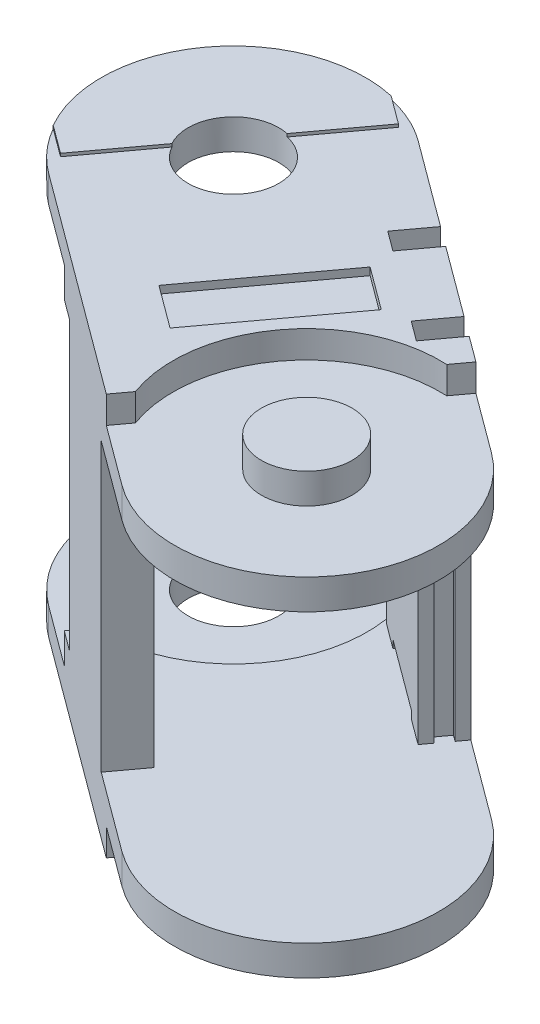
ISO-10303-21;
HEADER;
FILE_DESCRIPTION(('STEP AP214'),'2;1');
FILE_NAME('part.step','',(''),(''),'','','');
FILE_SCHEMA(('AUTOMOTIVE_DESIGN { 1 0 10303 214 1 1 1 1 }'));
ENDSEC;
DATA;
#1=APPLICATION_CONTEXT('core data for automotive mechanical design processes');
#2=APPLICATION_PROTOCOL_DEFINITION('international standard','automotive_design',2000,#1);
#3=PRODUCT_CONTEXT('',#1,'mechanical');
#4=PRODUCT('Part','Part','',(#3));
#5=PRODUCT_RELATED_PRODUCT_CATEGORY('part','',(#4));
#6=PRODUCT_DEFINITION_FORMATION('','',#4);
#7=PRODUCT_DEFINITION_CONTEXT('part definition',#1,'design');
#8=PRODUCT_DEFINITION('design','',#6,#7);
#9=PRODUCT_DEFINITION_SHAPE('','',#8);
#10=(LENGTH_UNIT() NAMED_UNIT(*) SI_UNIT(.MILLI.,.METRE.));
#11=(NAMED_UNIT(*) PLANE_ANGLE_UNIT() SI_UNIT($,.RADIAN.));
#12=(NAMED_UNIT(*) SI_UNIT($,.STERADIAN.) SOLID_ANGLE_UNIT());
#13=UNCERTAINTY_MEASURE_WITH_UNIT(LENGTH_MEASURE(1.E-05),#10,'distance_accuracy_value','');
#14=(GEOMETRIC_REPRESENTATION_CONTEXT(3) GLOBAL_UNCERTAINTY_ASSIGNED_CONTEXT((#13)) GLOBAL_UNIT_ASSIGNED_CONTEXT((#10,
#11,#12)) REPRESENTATION_CONTEXT('',''));
#15=CARTESIAN_POINT('',(0.,0.,0.));
#16=DIRECTION('',(0.,0.,1.));
#17=DIRECTION('',(1.,0.,0.));
#18=AXIS2_PLACEMENT_3D('',#15,#16,#17);
#19=CARTESIAN_POINT('',(-275.834099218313,-7.99999999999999,146.096751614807));
#20=DIRECTION('',(0.,-1.,0.));
#21=DIRECTION('',(0.,0.,-1.));
#22=AXIS2_PLACEMENT_3D('',#19,#20,#21);
#23=PLANE('',#22);
#24=CARTESIAN_POINT('',(-275.834099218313,-7.99999999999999,146.096751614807));
#25=DIRECTION('',(0.,1.,0.));
#26=DIRECTION('',(0.,0.,1.));
#27=AXIS2_PLACEMENT_3D('',#24,#25,#26);
#28=CIRCLE('',#27,6.00000000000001);
#29=CARTESIAN_POINT('',(-275.834099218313,-7.99999999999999,152.096751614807));
#30=VERTEX_POINT('',#29);
#31=EDGE_CURVE('E19',#30,#30,#28,.T.);
#32=ORIENTED_EDGE('',*,*,#31,.F.);
#33=EDGE_LOOP('',(#32));
#34=FACE_BOUND('',#33,.T.);
#35=ADVANCED_FACE('F16',(#34),#23,.T.);
#36=CARTESIAN_POINT('',(-294.340791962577,-6.59999999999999,132.440166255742));
#37=DIRECTION('',(0.,1.,0.));
#38=DIRECTION('',(0.,0.,1.));
#39=AXIS2_PLACEMENT_3D('',#36,#37,#38);
#40=PLANE('',#39);
#41=DIRECTION('',(0.593764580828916,0.,-0.804638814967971));
#42=VECTOR('',#41,1.);
#43=CARTESIAN_POINT('',(-297.157027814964,-6.59999999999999,130.36199022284));
#44=LINE('',#43,#42);
#45=CARTESIAN_POINT('',(-291.219382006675,-6.59999999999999,122.315602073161));
#46=VERTEX_POINT('',#45);
#47=CARTESIAN_POINT('',(-303.094673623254,-6.59999999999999,138.40837837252));
#48=VERTEX_POINT('',#47);
#49=EDGE_CURVE('E1391',#46,#48,#44,.F.);
#50=ORIENTED_EDGE('',*,*,#49,.F.);
#51=DIRECTION('',(0.804638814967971,0.,0.593764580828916));
#52=VECTOR('',#51,1.);
#53=CARTESIAN_POINT('',(-288.403146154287,-6.59999999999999,124.393778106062));
#54=LINE('',#53,#52);
#55=CARTESIAN_POINT('',(-285.586910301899,-6.59999999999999,126.471954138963));
#56=VERTEX_POINT('',#55);
#57=EDGE_CURVE('E1396',#56,#46,#54,.F.);
#58=ORIENTED_EDGE('',*,*,#57,.F.);
#59=DIRECTION('',(-0.593764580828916,0.,0.804638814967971));
#60=VECTOR('',#59,1.);
#61=CARTESIAN_POINT('',(-291.524556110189,-6.59999999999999,134.518342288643));
#62=LINE('',#61,#60);
#63=CARTESIAN_POINT('',(-297.462201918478,-6.59999999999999,142.564730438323));
#64=VERTEX_POINT('',#63);
#65=EDGE_CURVE('E1375',#64,#56,#62,.F.);
#66=ORIENTED_EDGE('',*,*,#65,.F.);
#67=DIRECTION('',(-0.804638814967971,0.,-0.593764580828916));
#68=VECTOR('',#67,1.);
#69=CARTESIAN_POINT('',(-300.278437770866,-6.59999999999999,140.486554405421));
#70=LINE('',#69,#68);
#71=EDGE_CURVE('E1386',#48,#64,#70,.F.);
#72=ORIENTED_EDGE('',*,*,#71,.F.);
#73=EDGE_LOOP('',(#50,#58,#66,#72));
#74=FACE_BOUND('',#73,.T.);
#75=ADVANCED_FACE('F2883',(#74),#40,.F.);
#76=CARTESIAN_POINT('',(-294.340791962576,44.6,132.440166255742));
#77=DIRECTION('',(0.,-1.,0.));
#78=DIRECTION('',(0.,0.,-1.));
#79=AXIS2_PLACEMENT_3D('',#76,#77,#78);
#80=PLANE('',#79);
#81=DIRECTION('',(0.593764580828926,0.,-0.804638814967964));
#82=VECTOR('',#81,1.);
#83=CARTESIAN_POINT('',(-297.157027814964,44.6,130.361990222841));
#84=LINE('',#83,#82);
#85=CARTESIAN_POINT('',(-303.094673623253,44.6,138.40837837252));
#86=VERTEX_POINT('',#85);
#87=CARTESIAN_POINT('',(-291.219382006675,44.6,122.315602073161));
#88=VERTEX_POINT('',#87);
#89=EDGE_CURVE('E1234',#86,#88,#84,.T.);
#90=ORIENTED_EDGE('',*,*,#89,.F.);
#91=DIRECTION('',(-0.804638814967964,0.,-0.593764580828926));
#92=VECTOR('',#91,1.);
#93=CARTESIAN_POINT('',(-300.278437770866,44.6,140.486554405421));
#94=LINE('',#93,#92);
#95=CARTESIAN_POINT('',(-297.462201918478,44.6,142.564730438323));
#96=VERTEX_POINT('',#95);
#97=EDGE_CURVE('E1228',#96,#86,#94,.T.);
#98=ORIENTED_EDGE('',*,*,#97,.F.);
#99=DIRECTION('',(-0.593764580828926,0.,0.804638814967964));
#100=VECTOR('',#99,1.);
#101=CARTESIAN_POINT('',(-291.524556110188,44.6,134.518342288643));
#102=LINE('',#101,#100);
#103=CARTESIAN_POINT('',(-285.586910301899,44.6,126.471954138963));
#104=VERTEX_POINT('',#103);
#105=EDGE_CURVE('E1221',#104,#96,#102,.T.);
#106=ORIENTED_EDGE('',*,*,#105,.F.);
#107=DIRECTION('',(0.804638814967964,0.,0.593764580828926));
#108=VECTOR('',#107,1.);
#109=CARTESIAN_POINT('',(-288.403146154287,44.6,124.393778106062));
#110=LINE('',#109,#108);
#111=EDGE_CURVE('E1240',#88,#104,#110,.T.);
#112=ORIENTED_EDGE('',*,*,#111,.F.);
#113=EDGE_LOOP('',(#90,#98,#106,#112));
#114=FACE_BOUND('',#113,.T.);
#115=ADVANCED_FACE('F2874',(#114),#80,.F.);
#116=CARTESIAN_POINT('',(-275.834099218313,46.,146.096751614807));
#117=DIRECTION('',(0.,1.,0.));
#118=DIRECTION('',(0.,0.,1.));
#119=AXIS2_PLACEMENT_3D('',#116,#117,#118);
#120=PLANE('',#119);
#121=CARTESIAN_POINT('',(-275.834099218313,46.,146.096751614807));
#122=DIRECTION('',(0.,-1.,0.));
#123=DIRECTION('',(0.,0.,-1.));
#124=AXIS2_PLACEMENT_3D('',#121,#122,#123);
#125=CIRCLE('',#124,6.00000000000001);
#126=CARTESIAN_POINT('',(-275.834099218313,46.,140.096751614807));
#127=VERTEX_POINT('',#126);
#128=EDGE_CURVE('E1220',#127,#127,#125,.T.);
#129=ORIENTED_EDGE('',*,*,#128,.F.);
#130=EDGE_LOOP('',(#129));
#131=FACE_BOUND('',#130,.T.);
#132=ADVANCED_FACE('F2865',(#131),#120,.T.);
#133=CARTESIAN_POINT('',(-278.866408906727,38.,128.311780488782));
#134=DIRECTION('',(0.804638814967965,0.,0.593764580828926));
#135=DIRECTION('',(0.593764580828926,0.,-0.804638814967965));
#136=AXIS2_PLACEMENT_3D('',#133,#134,#135);
#137=PLANE('',#136);
#138=DIRECTION('',(0.593764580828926,0.,-0.804638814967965));
#139=VECTOR('',#138,1.);
#140=CARTESIAN_POINT('',(-278.866408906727,0.,128.311780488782));
#141=LINE('',#140,#139);
#142=CARTESIAN_POINT('',(-278.866408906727,0.,128.311780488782));
#143=VERTEX_POINT('',#142);
#144=CARTESIAN_POINT('',(-277.975762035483,0.,127.10482226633));
#145=VERTEX_POINT('',#144);
#146=EDGE_CURVE('E1487',#143,#145,#141,.T.);
#147=ORIENTED_EDGE('',*,*,#146,.T.);
#148=DIRECTION('',(0.,1.,0.));
#149=VECTOR('',#148,1.);
#150=CARTESIAN_POINT('',(-277.975762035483,38.,127.10482226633));
#151=LINE('',#150,#149);
#152=CARTESIAN_POINT('',(-277.975762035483,38.,127.10482226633));
#153=VERTEX_POINT('',#152);
#154=EDGE_CURVE('E1788',#153,#145,#151,.F.);
#155=ORIENTED_EDGE('',*,*,#154,.F.);
#156=DIRECTION('',(0.593764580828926,0.,-0.804638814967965));
#157=VECTOR('',#156,1.);
#158=CARTESIAN_POINT('',(-278.866408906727,38.,128.311780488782));
#159=LINE('',#158,#157);
#160=CARTESIAN_POINT('',(-278.866408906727,38.,128.311780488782));
#161=VERTEX_POINT('',#160);
#162=EDGE_CURVE('E1719',#153,#161,#159,.F.);
#163=ORIENTED_EDGE('',*,*,#162,.T.);
#164=DIRECTION('',(0.,1.,0.));
#165=VECTOR('',#164,1.);
#166=CARTESIAN_POINT('',(-278.866408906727,38.,128.311780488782));
#167=LINE('',#166,#165);
#168=EDGE_CURVE('E1521',#143,#161,#167,.T.);
#169=ORIENTED_EDGE('',*,*,#168,.F.);
#170=EDGE_LOOP('',(#147,#155,#163,#169));
#171=FACE_BOUND('',#170,.T.);
#172=ADVANCED_FACE('F2856',(#171),#137,.T.);
#173=CARTESIAN_POINT('',(-285.428385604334,38.,120.362537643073));
#174=DIRECTION('',(0.,-1.,0.));
#175=DIRECTION('',(0.,0.,-1.));
#176=AXIS2_PLACEMENT_3D('',#173,#174,#175);
#177=PLANE('',#176);
#178=DIRECTION('',(-0.804638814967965,0.,-0.593764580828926));
#179=VECTOR('',#178,1.);
#180=CARTESIAN_POINT('',(-275.897586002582,38.,124.288586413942));
#181=LINE('',#180,#179);
#182=CARTESIAN_POINT('',(-291.990362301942,38.,112.413294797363));
#183=VERTEX_POINT('',#182);
#184=CARTESIAN_POINT('',(-291.185723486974,38.,113.007059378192));
#185=VERTEX_POINT('',#184);
#186=EDGE_CURVE('E1473',#183,#185,#181,.F.);
#187=ORIENTED_EDGE('',*,*,#186,.F.);
#188=DIRECTION('',(-0.593764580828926,0.,0.804638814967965));
#189=VECTOR('',#188,1.);
#190=CARTESIAN_POINT('',(-291.990362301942,38.,112.413294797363));
#191=LINE('',#190,#189);
#192=CARTESIAN_POINT('',(-291.996299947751,38.,112.421341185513));
#193=VERTEX_POINT('',#192);
#194=EDGE_CURVE('E1478',#193,#183,#191,.F.);
#195=ORIENTED_EDGE('',*,*,#194,.F.);
#196=DIRECTION('',(-0.804638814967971,0.,-0.593764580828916));
#197=VECTOR('',#196,1.);
#198=CARTESIAN_POINT('',(-265.443219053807,38.,132.015572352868));
#199=LINE('',#198,#197);
#200=CARTESIAN_POINT('',(-291.191661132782,38.,113.015105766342));
#201=VERTEX_POINT('',#200);
#202=EDGE_CURVE('E1184',#201,#193,#199,.T.);
#203=ORIENTED_EDGE('',*,*,#202,.F.);
#204=DIRECTION('',(-0.593764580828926,0.,0.804638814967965));
#205=VECTOR('',#204,1.);
#206=CARTESIAN_POINT('',(-292.076370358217,38.,114.214017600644));
#207=LINE('',#206,#205);
#208=EDGE_CURVE('E1483',#185,#201,#207,.T.);
#209=ORIENTED_EDGE('',*,*,#208,.F.);
#210=EDGE_LOOP('',(#187,#195,#203,#209));
#211=FACE_BOUND('',#210,.T.);
#212=ADVANCED_FACE('F2847',(#211),#177,.F.);
#213=CARTESIAN_POINT('',(-292.076370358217,38.,114.214017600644));
#214=DIRECTION('',(-0.804638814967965,0.,-0.593764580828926));
#215=DIRECTION('',(-0.593764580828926,0.,0.804638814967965));
#216=AXIS2_PLACEMENT_3D('',#213,#214,#215);
#217=PLANE('',#216);
#218=DIRECTION('',(0.,1.,0.));
#219=VECTOR('',#218,1.);
#220=CARTESIAN_POINT('',(-291.191661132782,46.,113.015105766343));
#221=LINE('',#220,#219);
#222=CARTESIAN_POINT('',(-291.191661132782,43.,113.015105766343));
#223=VERTEX_POINT('',#222);
#224=EDGE_CURVE('E1306',#223,#201,#221,.F.);
#225=ORIENTED_EDGE('',*,*,#224,.F.);
#226=DIRECTION('',(0.593764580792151,0.,-0.804638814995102));
#227=VECTOR('',#226,1.);
#228=CARTESIAN_POINT('',(-291.191661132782,43.,113.015105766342));
#229=LINE('',#228,#227);
#230=CARTESIAN_POINT('',(-291.185723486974,43.,113.007059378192));
#231=VERTEX_POINT('',#230);
#232=EDGE_CURVE('E1486',#223,#231,#229,.T.);
#233=ORIENTED_EDGE('',*,*,#232,.T.);
#234=DIRECTION('',(0.,1.,0.));
#235=VECTOR('',#234,1.);
#236=CARTESIAN_POINT('',(-291.185723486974,38.,113.007059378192));
#237=LINE('',#236,#235);
#238=EDGE_CURVE('E1499',#185,#231,#237,.T.);
#239=ORIENTED_EDGE('',*,*,#238,.F.);
#240=ORIENTED_EDGE('',*,*,#208,.T.);
#241=EDGE_LOOP('',(#225,#233,#239,#240));
#242=FACE_BOUND('',#241,.T.);
#243=ADVANCED_FACE('F2838',(#242),#217,.T.);
#244=CARTESIAN_POINT('',(-291.362596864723,43.,115.983523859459));
#245=DIRECTION('',(0.,-1.,0.));
#246=DIRECTION('',(0.,0.,-1.));
#247=AXIS2_PLACEMENT_3D('',#244,#245,#246);
#248=PLANE('',#247);
#249=DIRECTION('',(-0.804638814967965,0.,-0.593764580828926));
#250=VECTOR('',#249,1.);
#251=CARTESIAN_POINT('',(-275.897586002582,43.,124.288586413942));
#252=LINE('',#251,#250);
#253=CARTESIAN_POINT('',(-288.570647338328,43.,114.936794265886));
#254=VERTEX_POINT('',#253);
#255=EDGE_CURVE('E1588',#231,#254,#252,.F.);
#256=ORIENTED_EDGE('',*,*,#255,.F.);
#257=ORIENTED_EDGE('',*,*,#232,.F.);
#258=DIRECTION('',(0.593764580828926,0.,-0.804638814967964));
#259=VECTOR('',#258,1.);
#260=CARTESIAN_POINT('',(-292.676072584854,43.,115.026702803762));
#261=LINE('',#260,#259);
#262=CARTESIAN_POINT('',(-294.154546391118,43.,117.030253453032));
#263=VERTEX_POINT('',#262);
#264=EDGE_CURVE('E1576',#263,#223,#261,.T.);
#265=ORIENTED_EDGE('',*,*,#264,.F.);
#266=DIRECTION('',(0.804638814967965,0.,0.593764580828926));
#267=VECTOR('',#266,1.);
#268=CARTESIAN_POINT('',(-294.959185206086,43.,116.436488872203));
#269=LINE('',#268,#267);
#270=CARTESIAN_POINT('',(-291.539470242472,43.,118.959988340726));
#271=VERTEX_POINT('',#270);
#272=EDGE_CURVE('E1443',#271,#263,#269,.F.);
#273=ORIENTED_EDGE('',*,*,#272,.F.);
#274=DIRECTION('',(-0.593764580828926,0.,0.804638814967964));
#275=VECTOR('',#274,1.);
#276=CARTESIAN_POINT('',(-290.060996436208,43.,116.956437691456));
#277=LINE('',#276,#275);
#278=CARTESIAN_POINT('',(-288.576584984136,43.,114.944840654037));
#279=VERTEX_POINT('',#278);
#280=EDGE_CURVE('E1572',#279,#271,#277,.T.);
#281=ORIENTED_EDGE('',*,*,#280,.F.);
#282=DIRECTION('',(-0.593764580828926,0.,0.804638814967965));
#283=VECTOR('',#282,1.);
#284=CARTESIAN_POINT('',(-290.0550587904,43.,116.948391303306));
#285=LINE('',#284,#283);
#286=EDGE_CURVE('E1180',#279,#254,#285,.F.);
#287=ORIENTED_EDGE('',*,*,#286,.T.);
#288=EDGE_LOOP('',(#256,#257,#265,#273,#281,#287));
#289=FACE_BOUND('',#288,.T.);
#290=ADVANCED_FACE('F2829',(#289),#248,.F.);
#291=CARTESIAN_POINT('',(-285.428385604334,37.,120.362537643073));
#292=DIRECTION('',(0.,-1.,0.));
#293=DIRECTION('',(0.,0.,-1.));
#294=AXIS2_PLACEMENT_3D('',#291,#292,#293);
#295=PLANE('',#294);
#296=DIRECTION('',(-0.593764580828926,0.,0.804638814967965));
#297=VECTOR('',#296,1.);
#298=CARTESIAN_POINT('',(-290.0550587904,37.,116.948391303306));
#299=LINE('',#298,#297);
#300=CARTESIAN_POINT('',(-288.570647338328,37.,114.936794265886));
#301=VERTEX_POINT('',#300);
#302=CARTESIAN_POINT('',(-291.539470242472,37.,118.959988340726));
#303=VERTEX_POINT('',#302);
#304=EDGE_CURVE('E1177',#301,#303,#299,.T.);
#305=ORIENTED_EDGE('',*,*,#304,.T.);
#306=DIRECTION('',(0.804638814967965,0.,0.593764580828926));
#307=VECTOR('',#306,1.);
#308=CARTESIAN_POINT('',(-294.959185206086,37.,116.436488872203));
#309=LINE('',#308,#307);
#310=CARTESIAN_POINT('',(-282.286123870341,37.,125.788281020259));
#311=VERTEX_POINT('',#310);
#312=EDGE_CURVE('E1440',#311,#303,#309,.F.);
#313=ORIENTED_EDGE('',*,*,#312,.F.);
#314=DIRECTION('',(0.593764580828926,0.,-0.804638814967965));
#315=VECTOR('',#314,1.);
#316=CARTESIAN_POINT('',(-280.801712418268,37.,123.776683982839));
#317=LINE('',#316,#315);
#318=CARTESIAN_POINT('',(-279.317300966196,37.,121.765086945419));
#319=VERTEX_POINT('',#318);
#320=EDGE_CURVE('E1173',#311,#319,#317,.T.);
#321=ORIENTED_EDGE('',*,*,#320,.T.);
#322=DIRECTION('',(-0.804638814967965,0.,-0.593764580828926));
#323=VECTOR('',#322,1.);
#324=CARTESIAN_POINT('',(-275.897586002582,37.,124.288586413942));
#325=LINE('',#324,#323);
#326=EDGE_CURVE('E1108',#301,#319,#325,.F.);
#327=ORIENTED_EDGE('',*,*,#326,.F.);
#328=EDGE_LOOP('',(#305,#313,#321,#327));
#329=FACE_BOUND('',#328,.T.);
#330=ADVANCED_FACE('F2820',(#329),#295,.F.);
#331=CARTESIAN_POINT('',(-279.494174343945,43.,124.741551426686));
#332=DIRECTION('',(0.,-1.,0.));
#333=DIRECTION('',(0.,0.,-1.));
#334=AXIS2_PLACEMENT_3D('',#331,#332,#333);
#335=PLANE('',#334);
#336=DIRECTION('',(-0.804638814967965,0.,-0.593764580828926));
#337=VECTOR('',#336,1.);
#338=CARTESIAN_POINT('',(-275.897586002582,43.,124.288586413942));
#339=LINE('',#338,#337);
#340=CARTESIAN_POINT('',(-279.317300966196,43.,121.765086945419));
#341=VERTEX_POINT('',#340);
#342=CARTESIAN_POINT('',(-276.70222481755,43.,123.694821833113));
#343=VERTEX_POINT('',#342);
#344=EDGE_CURVE('E1107',#341,#343,#339,.F.);
#345=ORIENTED_EDGE('',*,*,#344,.F.);
#346=DIRECTION('',(0.593764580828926,0.,-0.804638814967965));
#347=VECTOR('',#346,1.);
#348=CARTESIAN_POINT('',(-280.801712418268,43.,123.776683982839));
#349=LINE('',#348,#347);
#350=CARTESIAN_POINT('',(-279.323238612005,43.,121.773133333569));
#351=VERTEX_POINT('',#350);
#352=EDGE_CURVE('E1175',#341,#351,#349,.F.);
#353=ORIENTED_EDGE('',*,*,#352,.T.);
#354=DIRECTION('',(0.593764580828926,0.,-0.804638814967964));
#355=VECTOR('',#354,1.);
#356=CARTESIAN_POINT('',(-280.807650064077,43.,123.784730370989));
#357=LINE('',#356,#355);
#358=CARTESIAN_POINT('',(-282.286123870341,43.,125.788281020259));
#359=VERTEX_POINT('',#358);
#360=EDGE_CURVE('E1558',#359,#351,#357,.T.);
#361=ORIENTED_EDGE('',*,*,#360,.F.);
#362=DIRECTION('',(0.804638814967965,0.,0.593764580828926));
#363=VECTOR('',#362,1.);
#364=CARTESIAN_POINT('',(-294.959185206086,43.,116.436488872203));
#365=LINE('',#364,#363);
#366=CARTESIAN_POINT('',(-279.671047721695,43.,127.718015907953));
#367=VERTEX_POINT('',#366);
#368=EDGE_CURVE('E1444',#367,#359,#365,.F.);
#369=ORIENTED_EDGE('',*,*,#368,.F.);
#370=DIRECTION('',(-0.593764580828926,0.,0.804638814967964));
#371=VECTOR('',#370,1.);
#372=CARTESIAN_POINT('',(-278.192573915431,43.,125.714465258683));
#373=LINE('',#372,#371);
#374=CARTESIAN_POINT('',(-276.708162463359,43.,123.702868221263));
#375=VERTEX_POINT('',#374);
#376=EDGE_CURVE('E1560',#375,#367,#373,.T.);
#377=ORIENTED_EDGE('',*,*,#376,.F.);
#378=DIRECTION('',(0.593764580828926,0.,-0.804638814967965));
#379=VECTOR('',#378,1.);
#380=CARTESIAN_POINT('',(-278.780400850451,43.,126.511057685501));
#381=LINE('',#380,#379);
#382=EDGE_CURVE('E1627',#343,#375,#381,.F.);
#383=ORIENTED_EDGE('',*,*,#382,.F.);
#384=EDGE_LOOP('',(#345,#353,#361,#369,#377,#383));
#385=FACE_BOUND('',#384,.T.);
#386=ADVANCED_FACE('F2811',(#385),#335,.F.);
#387=CARTESIAN_POINT('',(-278.780400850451,38.,126.511057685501));
#388=DIRECTION('',(0.804638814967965,0.,0.593764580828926));
#389=DIRECTION('',(0.593764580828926,0.,-0.804638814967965));
#390=AXIS2_PLACEMENT_3D('',#387,#388,#389);
#391=PLANE('',#390);
#392=DIRECTION('',(0.,1.,0.));
#393=VECTOR('',#392,1.);
#394=CARTESIAN_POINT('',(-276.708162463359,46.,123.702868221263));
#395=LINE('',#394,#393);
#396=CARTESIAN_POINT('',(-276.708162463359,38.,123.702868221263));
#397=VERTEX_POINT('',#396);
#398=EDGE_CURVE('E1206',#397,#375,#395,.T.);
#399=ORIENTED_EDGE('',*,*,#398,.F.);
#400=DIRECTION('',(0.593764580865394,0.,-0.804638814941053));
#401=VECTOR('',#400,1.);
#402=CARTESIAN_POINT('',(-276.708162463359,38.,123.702868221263));
#403=LINE('',#402,#401);
#404=CARTESIAN_POINT('',(-276.70222481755,38.,123.694821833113));
#405=VERTEX_POINT('',#404);
#406=EDGE_CURVE('E1630',#397,#405,#403,.T.);
#407=ORIENTED_EDGE('',*,*,#406,.T.);
#408=DIRECTION('',(0.,1.,0.));
#409=VECTOR('',#408,1.);
#410=CARTESIAN_POINT('',(-276.70222481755,38.,123.694821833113));
#411=LINE('',#410,#409);
#412=EDGE_CURVE('E1782',#343,#405,#411,.F.);
#413=ORIENTED_EDGE('',*,*,#412,.F.);
#414=ORIENTED_EDGE('',*,*,#382,.T.);
#415=EDGE_LOOP('',(#399,#407,#413,#414));
#416=FACE_BOUND('',#415,.T.);
#417=ADVANCED_FACE('F2802',(#416),#391,.T.);
#418=CARTESIAN_POINT('',(-285.428385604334,38.,120.362537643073));
#419=DIRECTION('',(0.,-1.,0.));
#420=DIRECTION('',(0.,0.,-1.));
#421=AXIS2_PLACEMENT_3D('',#418,#419,#420);
#422=PLANE('',#421);
#423=DIRECTION('',(-0.804638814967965,0.,-0.593764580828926));
#424=VECTOR('',#423,1.);
#425=CARTESIAN_POINT('',(-275.897586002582,38.,124.288586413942));
#426=LINE('',#425,#424);
#427=CARTESIAN_POINT('',(-275.897586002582,38.,124.288586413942));
#428=VERTEX_POINT('',#427);
#429=EDGE_CURVE('E1551',#405,#428,#426,.F.);
#430=ORIENTED_EDGE('',*,*,#429,.F.);
#431=ORIENTED_EDGE('',*,*,#406,.F.);
#432=DIRECTION('',(-0.804638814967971,0.,-0.593764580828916));
#433=VECTOR('',#432,1.);
#434=CARTESIAN_POINT('',(-265.443219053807,38.,132.015572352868));
#435=LINE('',#434,#433);
#436=CARTESIAN_POINT('',(-275.903523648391,38.,124.296632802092));
#437=VERTEX_POINT('',#436);
#438=EDGE_CURVE('E1203',#437,#397,#435,.T.);
#439=ORIENTED_EDGE('',*,*,#438,.F.);
#440=DIRECTION('',(0.593764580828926,0.,-0.804638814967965));
#441=VECTOR('',#440,1.);
#442=CARTESIAN_POINT('',(-276.788232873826,38.,125.495544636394));
#443=LINE('',#442,#441);
#444=EDGE_CURVE('E1482',#428,#437,#443,.F.);
#445=ORIENTED_EDGE('',*,*,#444,.F.);
#446=EDGE_LOOP('',(#430,#431,#439,#445));
#447=FACE_BOUND('',#446,.T.);
#448=ADVANCED_FACE('F2793',(#447),#422,.F.);
#449=CARTESIAN_POINT('',(-276.788232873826,38.,125.495544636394));
#450=DIRECTION('',(0.804638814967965,0.,0.593764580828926));
#451=DIRECTION('',(0.593764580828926,0.,-0.804638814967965));
#452=AXIS2_PLACEMENT_3D('',#449,#450,#451);
#453=PLANE('',#452);
#454=DIRECTION('',(0.,1.,0.));
#455=VECTOR('',#454,1.);
#456=CARTESIAN_POINT('',(-275.897586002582,38.,124.288586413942));
#457=LINE('',#456,#455);
#458=CARTESIAN_POINT('',(-275.897586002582,0.,124.288586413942));
#459=VERTEX_POINT('',#458);
#460=EDGE_CURVE('E1541',#428,#459,#457,.F.);
#461=ORIENTED_EDGE('',*,*,#460,.F.);
#462=ORIENTED_EDGE('',*,*,#444,.T.);
#463=DIRECTION('',(0.593764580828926,0.,-0.804638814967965));
#464=VECTOR('',#463,1.);
#465=CARTESIAN_POINT('',(-276.788232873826,38.,125.495544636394));
#466=LINE('',#465,#464);
#467=CARTESIAN_POINT('',(-276.788232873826,38.,125.495544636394));
#468=VERTEX_POINT('',#467);
#469=EDGE_CURVE('E1546',#437,#468,#466,.F.);
#470=ORIENTED_EDGE('',*,*,#469,.T.);
#471=DIRECTION('',(0.,1.,0.));
#472=VECTOR('',#471,1.);
#473=CARTESIAN_POINT('',(-276.788232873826,38.,125.495544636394));
#474=LINE('',#473,#472);
#475=CARTESIAN_POINT('',(-276.788232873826,0.,125.495544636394));
#476=VERTEX_POINT('',#475);
#477=EDGE_CURVE('E1785',#476,#468,#474,.T.);
#478=ORIENTED_EDGE('',*,*,#477,.F.);
#479=DIRECTION('',(0.593764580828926,0.,-0.804638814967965));
#480=VECTOR('',#479,1.);
#481=CARTESIAN_POINT('',(-276.788232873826,0.,125.495544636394));
#482=LINE('',#481,#480);
#483=CARTESIAN_POINT('',(-275.903523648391,0.,124.296632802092));
#484=VERTEX_POINT('',#483);
#485=EDGE_CURVE('E1544',#476,#484,#482,.T.);
#486=ORIENTED_EDGE('',*,*,#485,.T.);
#487=DIRECTION('',(-0.593764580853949,0.,0.804638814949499));
#488=VECTOR('',#487,1.);
#489=CARTESIAN_POINT('',(-275.897586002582,0.,124.288586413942));
#490=LINE('',#489,#488);
#491=EDGE_CURVE('E1132',#459,#484,#490,.T.);
#492=ORIENTED_EDGE('',*,*,#491,.F.);
#493=EDGE_LOOP('',(#461,#462,#470,#478,#486,#492));
#494=FACE_BOUND('',#493,.T.);
#495=ADVANCED_FACE('F2785',(#494),#453,.T.);
#496=CARTESIAN_POINT('',(-279.494174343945,-4.99999999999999,124.741551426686));
#497=DIRECTION('',(0.,1.,0.));
#498=DIRECTION('',(0.,0.,1.));
#499=AXIS2_PLACEMENT_3D('',#496,#497,#498);
#500=PLANE('',#499);
#501=DIRECTION('',(-0.804638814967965,0.,-0.593764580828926));
#502=VECTOR('',#501,1.);
#503=CARTESIAN_POINT('',(-275.897586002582,-4.99999999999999,124.288586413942));
#504=LINE('',#503,#502);
#505=CARTESIAN_POINT('',(-276.70222481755,-4.99999999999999,123.694821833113));
#506=VERTEX_POINT('',#505);
#507=CARTESIAN_POINT('',(-279.317300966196,-4.99999999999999,121.765086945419));
#508=VERTEX_POINT('',#507);
#509=EDGE_CURVE('E1103',#506,#508,#504,.T.);
#510=ORIENTED_EDGE('',*,*,#509,.F.);
#511=DIRECTION('',(0.593764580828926,0.,-0.804638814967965));
#512=VECTOR('',#511,1.);
#513=CARTESIAN_POINT('',(-278.780400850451,-4.99999999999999,126.511057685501));
#514=LINE('',#513,#512);
#515=CARTESIAN_POINT('',(-276.708162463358,-4.99999999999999,123.702868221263));
#516=VERTEX_POINT('',#515);
#517=EDGE_CURVE('E1136',#516,#506,#514,.T.);
#518=ORIENTED_EDGE('',*,*,#517,.F.);
#519=DIRECTION('',(-0.593764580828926,0.,0.804638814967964));
#520=VECTOR('',#519,1.);
#521=CARTESIAN_POINT('',(-278.192573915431,-4.99999999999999,125.714465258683));
#522=LINE('',#521,#520);
#523=CARTESIAN_POINT('',(-279.671047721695,-4.99999999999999,127.718015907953));
#524=VERTEX_POINT('',#523);
#525=EDGE_CURVE('E1156',#524,#516,#522,.F.);
#526=ORIENTED_EDGE('',*,*,#525,.F.);
#527=DIRECTION('',(0.804638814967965,0.,0.593764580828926));
#528=VECTOR('',#527,1.);
#529=CARTESIAN_POINT('',(-294.959185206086,-4.99999999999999,116.436488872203));
#530=LINE('',#529,#528);
#531=CARTESIAN_POINT('',(-282.286123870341,-4.99999999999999,125.788281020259));
#532=VERTEX_POINT('',#531);
#533=EDGE_CURVE('E1447',#532,#524,#530,.T.);
#534=ORIENTED_EDGE('',*,*,#533,.F.);
#535=DIRECTION('',(0.593764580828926,0.,-0.804638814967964));
#536=VECTOR('',#535,1.);
#537=CARTESIAN_POINT('',(-280.807650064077,-4.99999999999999,123.784730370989));
#538=LINE('',#537,#536);
#539=CARTESIAN_POINT('',(-279.323238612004,-4.99999999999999,121.773133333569));
#540=VERTEX_POINT('',#539);
#541=EDGE_CURVE('E1159',#540,#532,#538,.F.);
#542=ORIENTED_EDGE('',*,*,#541,.F.);
#543=DIRECTION('',(-0.593764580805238,0.,0.804638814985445));
#544=VECTOR('',#543,1.);
#545=CARTESIAN_POINT('',(-279.317300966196,-4.99999999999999,121.765086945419));
#546=LINE('',#545,#544);
#547=EDGE_CURVE('E1480',#508,#540,#546,.T.);
#548=ORIENTED_EDGE('',*,*,#547,.F.);
#549=EDGE_LOOP('',(#510,#518,#526,#534,#542,#548));
#550=FACE_BOUND('',#549,.T.);
#551=ADVANCED_FACE('F2776',(#550),#500,.F.);
#552=CARTESIAN_POINT('',(-294.068538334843,38.,115.229530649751));
#553=DIRECTION('',(-0.804638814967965,0.,-0.593764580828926));
#554=DIRECTION('',(-0.593764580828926,0.,0.804638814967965));
#555=AXIS2_PLACEMENT_3D('',#552,#553,#554);
#556=PLANE('',#555);
#557=DIRECTION('',(-0.593764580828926,0.,0.804638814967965));
#558=VECTOR('',#557,1.);
#559=CARTESIAN_POINT('',(-294.068538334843,0.,115.229530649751));
#560=LINE('',#559,#558);
#561=CARTESIAN_POINT('',(-294.068538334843,0.,115.229530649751));
#562=VERTEX_POINT('',#561);
#563=CARTESIAN_POINT('',(-294.959185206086,0.,116.436488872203));
#564=VERTEX_POINT('',#563);
#565=EDGE_CURVE('E1476',#562,#564,#560,.T.);
#566=ORIENTED_EDGE('',*,*,#565,.T.);
#567=DIRECTION('',(0.,1.,0.));
#568=VECTOR('',#567,1.);
#569=CARTESIAN_POINT('',(-294.959185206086,38.,116.436488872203));
#570=LINE('',#569,#568);
#571=CARTESIAN_POINT('',(-294.959185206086,38.,116.436488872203));
#572=VERTEX_POINT('',#571);
#573=EDGE_CURVE('E1439',#572,#564,#570,.F.);
#574=ORIENTED_EDGE('',*,*,#573,.F.);
#575=DIRECTION('',(-0.593764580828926,0.,0.804638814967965));
#576=VECTOR('',#575,1.);
#577=CARTESIAN_POINT('',(-294.068538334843,38.,115.229530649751));
#578=LINE('',#577,#576);
#579=CARTESIAN_POINT('',(-294.068538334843,38.,115.229530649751));
#580=VERTEX_POINT('',#579);
#581=EDGE_CURVE('E1479',#572,#580,#578,.F.);
#582=ORIENTED_EDGE('',*,*,#581,.T.);
#583=DIRECTION('',(0.,1.,0.));
#584=VECTOR('',#583,1.);
#585=CARTESIAN_POINT('',(-294.068538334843,38.,115.229530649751));
#586=LINE('',#585,#584);
#587=EDGE_CURVE('E1097',#562,#580,#586,.T.);
#588=ORIENTED_EDGE('',*,*,#587,.F.);
#589=EDGE_LOOP('',(#566,#574,#582,#588));
#590=FACE_BOUND('',#589,.T.);
#591=ADVANCED_FACE('F2768',(#590),#556,.T.);
#592=CARTESIAN_POINT('',(-291.990362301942,38.,112.413294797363));
#593=DIRECTION('',(-0.804638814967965,0.,-0.593764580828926));
#594=DIRECTION('',(-0.593764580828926,0.,0.804638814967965));
#595=AXIS2_PLACEMENT_3D('',#592,#593,#594);
#596=PLANE('',#595);
#597=DIRECTION('',(0.,1.,0.));
#598=VECTOR('',#597,1.);
#599=CARTESIAN_POINT('',(-292.881009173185,38.,113.620253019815));
#600=LINE('',#599,#598);
#601=CARTESIAN_POINT('',(-292.881009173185,38.,113.620253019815));
#602=VERTEX_POINT('',#601);
#603=CARTESIAN_POINT('',(-292.881009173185,0.,113.620253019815));
#604=VERTEX_POINT('',#603);
#605=EDGE_CURVE('E647',#602,#604,#600,.F.);
#606=ORIENTED_EDGE('',*,*,#605,.F.);
#607=DIRECTION('',(-0.593764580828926,0.,0.804638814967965));
#608=VECTOR('',#607,1.);
#609=CARTESIAN_POINT('',(-291.990362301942,38.,112.413294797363));
#610=LINE('',#609,#608);
#611=EDGE_CURVE('E1503',#602,#193,#610,.F.);
#612=ORIENTED_EDGE('',*,*,#611,.T.);
#613=ORIENTED_EDGE('',*,*,#194,.T.);
#614=DIRECTION('',(0.,1.,0.));
#615=VECTOR('',#614,1.);
#616=CARTESIAN_POINT('',(-291.990362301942,38.,112.413294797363));
#617=LINE('',#616,#615);
#618=CARTESIAN_POINT('',(-291.990362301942,0.,112.413294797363));
#619=VERTEX_POINT('',#618);
#620=EDGE_CURVE('E1468',#619,#183,#617,.T.);
#621=ORIENTED_EDGE('',*,*,#620,.F.);
#622=DIRECTION('',(-0.593764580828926,0.,0.804638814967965));
#623=VECTOR('',#622,1.);
#624=CARTESIAN_POINT('',(-291.990362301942,0.,112.413294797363));
#625=LINE('',#624,#623);
#626=CARTESIAN_POINT('',(-291.99629994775,0.,112.421341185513));
#627=VERTEX_POINT('',#626);
#628=EDGE_CURVE('E1488',#619,#627,#625,.T.);
#629=ORIENTED_EDGE('',*,*,#628,.T.);
#630=DIRECTION('',(-0.593764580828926,0.,0.804638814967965));
#631=VECTOR('',#630,1.);
#632=CARTESIAN_POINT('',(-291.990362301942,0.,112.413294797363));
#633=LINE('',#632,#631);
#634=EDGE_CURVE('E1491',#627,#604,#633,.T.);
#635=ORIENTED_EDGE('',*,*,#634,.T.);
#636=EDGE_LOOP('',(#606,#612,#613,#621,#629,#635));
#637=FACE_BOUND('',#636,.T.);
#638=ADVANCED_FACE('F1973',(#637),#596,.T.);
#639=CARTESIAN_POINT('',(-291.362596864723,-4.99999999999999,115.983523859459));
#640=DIRECTION('',(0.,1.,0.));
#641=DIRECTION('',(0.,0.,1.));
#642=AXIS2_PLACEMENT_3D('',#639,#640,#641);
#643=PLANE('',#642);
#644=DIRECTION('',(-0.804638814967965,0.,-0.593764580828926));
#645=VECTOR('',#644,1.);
#646=CARTESIAN_POINT('',(-275.897586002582,-4.99999999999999,124.288586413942));
#647=LINE('',#646,#645);
#648=CARTESIAN_POINT('',(-288.570647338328,-4.99999999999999,114.936794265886));
#649=VERTEX_POINT('',#648);
#650=CARTESIAN_POINT('',(-291.185723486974,-4.99999999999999,113.007059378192));
#651=VERTEX_POINT('',#650);
#652=EDGE_CURVE('E1115',#649,#651,#647,.T.);
#653=ORIENTED_EDGE('',*,*,#652,.F.);
#654=DIRECTION('',(0.593764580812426,0.,-0.80463881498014));
#655=VECTOR('',#654,1.);
#656=CARTESIAN_POINT('',(-288.576584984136,-4.99999999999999,114.944840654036));
#657=LINE('',#656,#655);
#658=CARTESIAN_POINT('',(-288.576584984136,-4.99999999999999,114.944840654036));
#659=VERTEX_POINT('',#658);
#660=EDGE_CURVE('E1456',#659,#649,#657,.T.);
#661=ORIENTED_EDGE('',*,*,#660,.F.);
#662=DIRECTION('',(-0.593764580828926,0.,0.804638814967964));
#663=VECTOR('',#662,1.);
#664=CARTESIAN_POINT('',(-290.060996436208,-4.99999999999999,116.956437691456));
#665=LINE('',#664,#663);
#666=CARTESIAN_POINT('',(-291.539470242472,-4.99999999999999,118.959988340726));
#667=VERTEX_POINT('',#666);
#668=EDGE_CURVE('E1098',#667,#659,#665,.F.);
#669=ORIENTED_EDGE('',*,*,#668,.F.);
#670=DIRECTION('',(0.804638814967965,0.,0.593764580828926));
#671=VECTOR('',#670,1.);
#672=CARTESIAN_POINT('',(-294.959185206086,-4.99999999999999,116.436488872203));
#673=LINE('',#672,#671);
#674=CARTESIAN_POINT('',(-294.154546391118,-4.99999999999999,117.030253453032));
#675=VERTEX_POINT('',#674);
#676=EDGE_CURVE('E1450',#675,#667,#673,.T.);
#677=ORIENTED_EDGE('',*,*,#676,.F.);
#678=DIRECTION('',(0.593764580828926,0.,-0.804638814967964));
#679=VECTOR('',#678,1.);
#680=CARTESIAN_POINT('',(-292.676072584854,-4.99999999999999,115.026702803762));
#681=LINE('',#680,#679);
#682=CARTESIAN_POINT('',(-291.191661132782,-4.99999999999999,113.015105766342));
#683=VERTEX_POINT('',#682);
#684=EDGE_CURVE('E1076',#683,#675,#681,.F.);
#685=ORIENTED_EDGE('',*,*,#684,.F.);
#686=DIRECTION('',(-0.593764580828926,0.,0.804638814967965));
#687=VECTOR('',#686,1.);
#688=CARTESIAN_POINT('',(-292.076370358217,-4.99999999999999,114.214017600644));
#689=LINE('',#688,#687);
#690=EDGE_CURVE('E1086',#651,#683,#689,.T.);
#691=ORIENTED_EDGE('',*,*,#690,.F.);
#692=EDGE_LOOP('',(#653,#661,#669,#677,#685,#691));
#693=FACE_BOUND('',#692,.T.);
#694=ADVANCED_FACE('F1983',(#693),#643,.F.);
#695=CARTESIAN_POINT('',(-294.959185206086,38.,116.436488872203));
#696=DIRECTION('',(-0.593764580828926,0.,0.804638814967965));
#697=DIRECTION('',(0.804638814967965,0.,0.593764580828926));
#698=AXIS2_PLACEMENT_3D('',#695,#696,#697);
#699=PLANE('',#698);
#700=ORIENTED_EDGE('',*,*,#573,.T.);
#701=DIRECTION('',(0.804638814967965,0.,0.593764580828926));
#702=VECTOR('',#701,1.);
#703=CARTESIAN_POINT('',(-294.959185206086,0.,116.436488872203));
#704=LINE('',#703,#702);
#705=CARTESIAN_POINT('',(-294.154546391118,0.,117.030253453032));
#706=VERTEX_POINT('',#705);
#707=EDGE_CURVE('E1437',#564,#706,#704,.T.);
#708=ORIENTED_EDGE('',*,*,#707,.T.);
#709=DIRECTION('',(0.,1.,0.));
#710=VECTOR('',#709,1.);
#711=CARTESIAN_POINT('',(-294.154546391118,-4.,117.030253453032));
#712=LINE('',#711,#710);
#713=EDGE_CURVE('E1075',#675,#706,#712,.T.);
#714=ORIENTED_EDGE('',*,*,#713,.F.);
#715=ORIENTED_EDGE('',*,*,#676,.T.);
#716=DIRECTION('',(0.,1.,0.));
#717=VECTOR('',#716,1.);
#718=CARTESIAN_POINT('',(-291.539470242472,-4.,118.959988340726));
#719=LINE('',#718,#717);
#720=CARTESIAN_POINT('',(-291.539470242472,0.,118.959988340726));
#721=VERTEX_POINT('',#720);
#722=EDGE_CURVE('E1102',#721,#667,#719,.F.);
#723=ORIENTED_EDGE('',*,*,#722,.F.);
#724=DIRECTION('',(0.,1.,0.));
#725=VECTOR('',#724,1.);
#726=CARTESIAN_POINT('',(-291.539470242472,38.,118.959988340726));
#727=LINE('',#726,#725);
#728=CARTESIAN_POINT('',(-291.539470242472,1.00000000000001,118.959988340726));
#729=VERTEX_POINT('',#728);
#730=EDGE_CURVE('E1448',#721,#729,#727,.T.);
#731=ORIENTED_EDGE('',*,*,#730,.T.);
#732=DIRECTION('',(-0.804638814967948,0.,-0.593764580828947));
#733=VECTOR('',#732,1.);
#734=CARTESIAN_POINT('',(-282.286123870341,1.00000000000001,125.788281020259));
#735=LINE('',#734,#733);
#736=CARTESIAN_POINT('',(-282.286123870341,1.00000000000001,125.788281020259));
#737=VERTEX_POINT('',#736);
#738=EDGE_CURVE('E1116',#737,#729,#735,.T.);
#739=ORIENTED_EDGE('',*,*,#738,.F.);
#740=DIRECTION('',(0.,1.,0.));
#741=VECTOR('',#740,1.);
#742=CARTESIAN_POINT('',(-282.286123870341,38.,125.788281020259));
#743=LINE('',#742,#741);
#744=CARTESIAN_POINT('',(-282.286123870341,0.,125.788281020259));
#745=VERTEX_POINT('',#744);
#746=EDGE_CURVE('E1445',#737,#745,#743,.F.);
#747=ORIENTED_EDGE('',*,*,#746,.T.);
#748=DIRECTION('',(0.,1.,0.));
#749=VECTOR('',#748,1.);
#750=CARTESIAN_POINT('',(-282.286123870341,-4.,125.788281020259));
#751=LINE('',#750,#749);
#752=EDGE_CURVE('E1121',#532,#745,#751,.T.);
#753=ORIENTED_EDGE('',*,*,#752,.F.);
#754=ORIENTED_EDGE('',*,*,#533,.T.);
#755=DIRECTION('',(0.,1.,0.));
#756=VECTOR('',#755,1.);
#757=CARTESIAN_POINT('',(-279.671047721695,-4.,127.718015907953));
#758=LINE('',#757,#756);
#759=CARTESIAN_POINT('',(-279.671047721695,0.,127.718015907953));
#760=VERTEX_POINT('',#759);
#761=EDGE_CURVE('E1160',#760,#524,#758,.F.);
#762=ORIENTED_EDGE('',*,*,#761,.F.);
#763=DIRECTION('',(0.804638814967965,0.,0.593764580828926));
#764=VECTOR('',#763,1.);
#765=CARTESIAN_POINT('',(-294.959185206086,0.,116.436488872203));
#766=LINE('',#765,#764);
#767=EDGE_CURVE('E1516',#760,#143,#766,.T.);
#768=ORIENTED_EDGE('',*,*,#767,.T.);
#769=ORIENTED_EDGE('',*,*,#168,.T.);
#770=DIRECTION('',(0.804638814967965,0.,0.593764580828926));
#771=VECTOR('',#770,1.);
#772=CARTESIAN_POINT('',(-294.959185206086,38.,116.436488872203));
#773=LINE('',#772,#771);
#774=CARTESIAN_POINT('',(-279.671047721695,38.,127.718015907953));
#775=VERTEX_POINT('',#774);
#776=EDGE_CURVE('E1654',#161,#775,#773,.F.);
#777=ORIENTED_EDGE('',*,*,#776,.T.);
#778=DIRECTION('',(0.,1.,0.));
#779=VECTOR('',#778,1.);
#780=CARTESIAN_POINT('',(-279.671047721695,42.,127.718015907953));
#781=LINE('',#780,#779);
#782=EDGE_CURVE('E1620',#367,#775,#781,.F.);
#783=ORIENTED_EDGE('',*,*,#782,.F.);
#784=ORIENTED_EDGE('',*,*,#368,.T.);
#785=DIRECTION('',(0.,1.,0.));
#786=VECTOR('',#785,1.);
#787=CARTESIAN_POINT('',(-282.286123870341,42.,125.788281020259));
#788=LINE('',#787,#786);
#789=CARTESIAN_POINT('',(-282.286123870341,38.,125.788281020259));
#790=VERTEX_POINT('',#789);
#791=EDGE_CURVE('E1561',#790,#359,#788,.T.);
#792=ORIENTED_EDGE('',*,*,#791,.F.);
#793=DIRECTION('',(0.,1.,0.));
#794=VECTOR('',#793,1.);
#795=CARTESIAN_POINT('',(-282.286123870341,40.5,125.788281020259));
#796=LINE('',#795,#794);
#797=EDGE_CURVE('E1176',#790,#311,#796,.F.);
#798=ORIENTED_EDGE('',*,*,#797,.T.);
#799=ORIENTED_EDGE('',*,*,#312,.T.);
#800=DIRECTION('',(0.,1.,0.));
#801=VECTOR('',#800,1.);
#802=CARTESIAN_POINT('',(-291.539470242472,40.5,118.959988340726));
#803=LINE('',#802,#801);
#804=CARTESIAN_POINT('',(-291.539470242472,38.,118.959988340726));
#805=VERTEX_POINT('',#804);
#806=EDGE_CURVE('E1179',#303,#805,#803,.T.);
#807=ORIENTED_EDGE('',*,*,#806,.T.);
#808=DIRECTION('',(0.,1.,0.));
#809=VECTOR('',#808,1.);
#810=CARTESIAN_POINT('',(-291.539470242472,42.,118.959988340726));
#811=LINE('',#810,#809);
#812=EDGE_CURVE('E1575',#271,#805,#811,.F.);
#813=ORIENTED_EDGE('',*,*,#812,.F.);
#814=ORIENTED_EDGE('',*,*,#272,.T.);
#815=DIRECTION('',(0.,1.,0.));
#816=VECTOR('',#815,1.);
#817=CARTESIAN_POINT('',(-294.154546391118,42.,117.030253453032));
#818=LINE('',#817,#816);
#819=CARTESIAN_POINT('',(-294.154546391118,38.,117.030253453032));
#820=VERTEX_POINT('',#819);
#821=EDGE_CURVE('E1607',#820,#263,#818,.T.);
#822=ORIENTED_EDGE('',*,*,#821,.F.);
#823=DIRECTION('',(0.804638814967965,0.,0.593764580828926));
#824=VECTOR('',#823,1.);
#825=CARTESIAN_POINT('',(-294.959185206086,38.,116.436488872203));
#826=LINE('',#825,#824);
#827=EDGE_CURVE('E1686',#820,#572,#826,.F.);
#828=ORIENTED_EDGE('',*,*,#827,.T.);
#829=EDGE_LOOP('',(#700,#708,#714,#715,#723,#731,#739,#747,#753,#754,#762,#768,#769,#777,#783,
#784,#792,#798,#799,#807,#813,#814,#822,#828));
#830=FACE_BOUND('',#829,.T.);
#831=ADVANCED_FACE('F1987',(#830),#699,.T.);
#832=CARTESIAN_POINT('',(-275.834099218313,-5.99999999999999,146.096751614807));
#833=DIRECTION('',(0.,1.,0.));
#834=DIRECTION('',(0.,0.,1.));
#835=AXIS2_PLACEMENT_3D('',#832,#833,#834);
#836=CYLINDRICAL_SURFACE('',#835,6.00000000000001);
#837=ORIENTED_EDGE('',*,*,#31,.T.);
#838=EDGE_LOOP('',(#837));
#839=FACE_BOUND('',#838,.T.);
#840=CARTESIAN_POINT('',(-275.834099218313,-3.99999999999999,146.096751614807));
#841=DIRECTION('',(0.,1.,0.));
#842=DIRECTION('',(0.,0.,1.));
#843=AXIS2_PLACEMENT_3D('',#840,#841,#842);
#844=CIRCLE('',#843,6.00000000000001);
#845=CARTESIAN_POINT('',(-275.834099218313,-3.99999999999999,152.096751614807));
#846=VERTEX_POINT('',#845);
#847=EDGE_CURVE('E1036',#846,#846,#844,.F.);
#848=ORIENTED_EDGE('',*,*,#847,.T.);
#849=EDGE_LOOP('',(#848));
#850=FACE_BOUND('',#849,.T.);
#851=ADVANCED_FACE('F2738',(#839,#850),#836,.T.);
#852=CARTESIAN_POINT('',(-275.834099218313,-5.99999999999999,146.096751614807));
#853=DIRECTION('',(0.,1.,0.));
#854=DIRECTION('',(0.,0.,1.));
#855=AXIS2_PLACEMENT_3D('',#852,#853,#854);
#856=CYLINDRICAL_SURFACE('',#855,17.7);
#857=DIRECTION('',(0.,1.,0.));
#858=VECTOR('',#857,1.);
#859=CARTESIAN_POINT('',(-292.471295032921,-5.99999999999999,152.137754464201));
#860=LINE('',#859,#858);
#861=CARTESIAN_POINT('',(-292.471295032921,-7.59999999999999,152.1377544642));
#862=VERTEX_POINT('',#861);
#863=CARTESIAN_POINT('',(-292.471295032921,-3.99999999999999,152.137754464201));
#864=VERTEX_POINT('',#863);
#865=EDGE_CURVE('E1035',#862,#864,#860,.T.);
#866=ORIENTED_EDGE('',*,*,#865,.F.);
#867=CARTESIAN_POINT('',(-275.834099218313,-7.59999999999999,146.096751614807));
#868=DIRECTION('',(0.,1.,0.));
#869=DIRECTION('',(0.,0.,1.));
#870=AXIS2_PLACEMENT_3D('',#867,#868,#869);
#871=CIRCLE('',#870,17.7);
#872=CARTESIAN_POINT('',(-274.967824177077,-7.59999999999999,128.417962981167));
#873=VERTEX_POINT('',#872);
#874=EDGE_CURVE('E1026',#873,#862,#871,.T.);
#875=ORIENTED_EDGE('',*,*,#874,.F.);
#876=DIRECTION('',(0.,1.,0.));
#877=VECTOR('',#876,1.);
#878=CARTESIAN_POINT('',(-274.967824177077,-5.99999999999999,128.417962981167));
#879=LINE('',#878,#877);
#880=CARTESIAN_POINT('',(-274.967824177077,-3.99999999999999,128.417962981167));
#881=VERTEX_POINT('',#880);
#882=EDGE_CURVE('E1149',#881,#873,#879,.F.);
#883=ORIENTED_EDGE('',*,*,#882,.F.);
#884=CARTESIAN_POINT('',(-275.834099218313,-3.99999999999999,146.096751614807));
#885=DIRECTION('',(0.,1.,0.));
#886=DIRECTION('',(0.,0.,1.));
#887=AXIS2_PLACEMENT_3D('',#884,#885,#886);
#888=CIRCLE('',#887,17.7);
#889=EDGE_CURVE('E1045',#881,#864,#888,.T.);
#890=ORIENTED_EDGE('',*,*,#889,.T.);
#891=EDGE_LOOP('',(#866,#875,#883,#890));
#892=FACE_BOUND('',#891,.T.);
#893=ADVANCED_FACE('F1947',(#892),#856,.F.);
#894=CARTESIAN_POINT('',(-320.134961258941,-7.79999999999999,133.290654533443));
#895=DIRECTION('',(-0.593764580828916,0.,0.804638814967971));
#896=DIRECTION('',(0.804638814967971,0.,0.593764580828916));
#897=AXIS2_PLACEMENT_3D('',#894,#895,#896);
#898=PLANE('',#897);
#899=DIRECTION('',(0.,1.,0.));
#900=VECTOR('',#899,1.);
#901=CARTESIAN_POINT('',(-328.051580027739,-7.79999999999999,127.448769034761));
#902=LINE('',#901,#900);
#903=CARTESIAN_POINT('',(-328.051580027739,-7.59999999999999,127.448769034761));
#904=VERTEX_POINT('',#903);
#905=CARTESIAN_POINT('',(-328.051580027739,-7.99999999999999,127.448769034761));
#906=VERTEX_POINT('',#905);
#907=EDGE_CURVE('E1431',#904,#906,#902,.F.);
#908=ORIENTED_EDGE('',*,*,#907,.T.);
#909=DIRECTION('',(0.804638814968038,0.,0.593764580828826));
#910=VECTOR('',#909,1.);
#911=CARTESIAN_POINT('',(-328.051580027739,-7.99999999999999,127.448769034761));
#912=LINE('',#911,#910);
#913=CARTESIAN_POINT('',(-324.359315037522,-7.99999999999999,130.173390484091));
#914=VERTEX_POINT('',#913);
#915=EDGE_CURVE('E1366',#906,#914,#912,.T.);
#916=ORIENTED_EDGE('',*,*,#915,.T.);
#917=DIRECTION('',(0.,1.,0.));
#918=VECTOR('',#917,1.);
#919=CARTESIAN_POINT('',(-324.359315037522,-7.79999999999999,130.173390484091));
#920=LINE('',#919,#918);
#921=CARTESIAN_POINT('',(-324.359315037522,-7.60000000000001,130.173390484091));
#922=VERTEX_POINT('',#921);
#923=EDGE_CURVE('E1421',#922,#914,#920,.F.);
#924=ORIENTED_EDGE('',*,*,#923,.F.);
#925=DIRECTION('',(0.804638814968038,0.,0.593764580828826));
#926=VECTOR('',#925,1.);
#927=CARTESIAN_POINT('',(-328.051580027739,-7.60000000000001,127.448769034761));
#928=LINE('',#927,#926);
#929=EDGE_CURVE('E1016',#904,#922,#928,.T.);
#930=ORIENTED_EDGE('',*,*,#929,.F.);
#931=EDGE_LOOP('',(#908,#916,#924,#930));
#932=FACE_BOUND('',#931,.T.);
#933=ADVANCED_FACE('F1892',(#932),#898,.T.);
#934=CARTESIAN_POINT('',(-314.85908174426,-7.79999999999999,117.299169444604));
#935=DIRECTION('',(0.804638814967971,0.,0.593764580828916));
#936=DIRECTION('',(0.593764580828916,0.,-0.804638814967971));
#937=AXIS2_PLACEMENT_3D('',#934,#935,#936);
#938=PLANE('',#937);
#939=ORIENTED_EDGE('',*,*,#923,.T.);
#940=DIRECTION('',(0.593764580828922,0.,-0.804638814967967));
#941=VECTOR('',#940,1.);
#942=CARTESIAN_POINT('',(-324.359315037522,-7.99999999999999,130.173390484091));
#943=LINE('',#942,#941);
#944=CARTESIAN_POINT('',(-318.097685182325,-7.99999999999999,121.687956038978));
#945=VERTEX_POINT('',#944);
#946=EDGE_CURVE('E1362',#914,#945,#943,.T.);
#947=ORIENTED_EDGE('',*,*,#946,.T.);
#948=DIRECTION('',(0.,-1.,0.));
#949=VECTOR('',#948,1.);
#950=CARTESIAN_POINT('',(-318.097685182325,-3.99999999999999,121.687956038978));
#951=LINE('',#950,#949);
#952=CARTESIAN_POINT('',(-318.097685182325,-7.6,121.687956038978));
#953=VERTEX_POINT('',#952);
#954=EDGE_CURVE('E1350',#945,#953,#951,.F.);
#955=ORIENTED_EDGE('',*,*,#954,.T.);
#956=DIRECTION('',(0.593764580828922,0.,-0.804638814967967));
#957=VECTOR('',#956,1.);
#958=CARTESIAN_POINT('',(-324.359315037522,-7.60000000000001,130.173390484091));
#959=LINE('',#958,#957);
#960=EDGE_CURVE('E1013',#922,#953,#959,.T.);
#961=ORIENTED_EDGE('',*,*,#960,.F.);
#962=EDGE_LOOP('',(#939,#947,#955,#961));
#963=FACE_BOUND('',#962,.T.);
#964=ADVANCED_FACE('F1885',(#963),#938,.T.);
#965=CARTESIAN_POINT('',(-314.85908174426,-7.79999999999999,117.299169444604));
#966=DIRECTION('',(0.804638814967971,0.,0.593764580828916));
#967=DIRECTION('',(0.593764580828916,0.,-0.804638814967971));
#968=AXIS2_PLACEMENT_3D('',#965,#966,#967);
#969=PLANE('',#968);
#970=DIRECTION('',(0.,1.,0.));
#971=VECTOR('',#970,1.);
#972=CARTESIAN_POINT('',(-305.358848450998,-7.8,104.424948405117));
#973=LINE('',#972,#971);
#974=CARTESIAN_POINT('',(-305.358848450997,-7.60000000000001,104.424948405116));
#975=VERTEX_POINT('',#974);
#976=CARTESIAN_POINT('',(-305.358848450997,-7.99999999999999,104.424948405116));
#977=VERTEX_POINT('',#976);
#978=EDGE_CURVE('E1398',#975,#977,#973,.F.);
#979=ORIENTED_EDGE('',*,*,#978,.F.);
#980=DIRECTION('',(0.593764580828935,0.,-0.804638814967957));
#981=VECTOR('',#980,1.);
#982=CARTESIAN_POINT('',(-311.620478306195,-7.60000000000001,112.91038285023));
#983=LINE('',#982,#981);
#984=CARTESIAN_POINT('',(-311.620478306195,-7.6,112.91038285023));
#985=VERTEX_POINT('',#984);
#986=EDGE_CURVE('E1005',#985,#975,#983,.T.);
#987=ORIENTED_EDGE('',*,*,#986,.F.);
#988=DIRECTION('',(0.,-1.,0.));
#989=VECTOR('',#988,1.);
#990=CARTESIAN_POINT('',(-311.620478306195,-3.99999999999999,112.91038285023));
#991=LINE('',#990,#989);
#992=CARTESIAN_POINT('',(-311.620478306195,-7.99999999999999,112.91038285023));
#993=VERTEX_POINT('',#992);
#994=EDGE_CURVE('E1361',#985,#993,#991,.T.);
#995=ORIENTED_EDGE('',*,*,#994,.T.);
#996=DIRECTION('',(0.593764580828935,0.,-0.804638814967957));
#997=VECTOR('',#996,1.);
#998=CARTESIAN_POINT('',(-311.620478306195,-7.99999999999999,112.91038285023));
#999=LINE('',#998,#997);
#1000=EDGE_CURVE('E1358',#993,#977,#999,.T.);
#1001=ORIENTED_EDGE('',*,*,#1000,.T.);
#1002=EDGE_LOOP('',(#979,#987,#995,#1001));
#1003=FACE_BOUND('',#1002,.T.);
#1004=ADVANCED_FACE('F1901',(#1003),#969,.T.);
#1005=CARTESIAN_POINT('',(-301.134494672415,-7.8,107.542212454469));
#1006=DIRECTION('',(0.593764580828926,0.,-0.804638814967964));
#1007=DIRECTION('',(-0.804638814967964,0.,-0.593764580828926));
#1008=AXIS2_PLACEMENT_3D('',#1005,#1006,#1007);
#1009=PLANE('',#1008);
#1010=DIRECTION('',(0.,-1.,0.));
#1011=VECTOR('',#1010,1.);
#1012=CARTESIAN_POINT('',(-309.051113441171,-7.99999999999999,101.70032695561));
#1013=LINE('',#1012,#1011);
#1014=CARTESIAN_POINT('',(-309.051113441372,-7.59999999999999,101.700326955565));
#1015=VERTEX_POINT('',#1014);
#1016=CARTESIAN_POINT('',(-309.051113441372,-8.,101.700326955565));
#1017=VERTEX_POINT('',#1016);
#1018=EDGE_CURVE('E650',#1015,#1017,#1013,.T.);
#1019=ORIENTED_EDGE('',*,*,#1018,.F.);
#1020=DIRECTION('',(-0.804638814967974,0.,-0.593764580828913));
#1021=VECTOR('',#1020,1.);
#1022=CARTESIAN_POINT('',(-305.358848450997,-7.60000000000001,104.424948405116));
#1023=LINE('',#1022,#1021);
#1024=EDGE_CURVE('E1001',#975,#1015,#1023,.T.);
#1025=ORIENTED_EDGE('',*,*,#1024,.F.);
#1026=ORIENTED_EDGE('',*,*,#978,.T.);
#1027=DIRECTION('',(-0.804638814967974,0.,-0.593764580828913));
#1028=VECTOR('',#1027,1.);
#1029=CARTESIAN_POINT('',(-305.358848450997,-7.99999999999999,104.424948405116));
#1030=LINE('',#1029,#1028);
#1031=EDGE_CURVE('E1370',#977,#1017,#1030,.T.);
#1032=ORIENTED_EDGE('',*,*,#1031,.T.);
#1033=EDGE_LOOP('',(#1019,#1025,#1026,#1032));
#1034=FACE_BOUND('',#1033,.T.);
#1035=ADVANCED_FACE('F1898',(#1034),#1009,.T.);
#1036=CARTESIAN_POINT('',(-288.403146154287,-7.09999999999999,124.393778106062));
#1037=DIRECTION('',(-0.593764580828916,0.,0.804638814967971));
#1038=DIRECTION('',(0.804638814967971,0.,0.593764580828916));
#1039=AXIS2_PLACEMENT_3D('',#1036,#1037,#1038);
#1040=PLANE('',#1039);
#1041=DIRECTION('',(0.,1.,0.));
#1042=VECTOR('',#1041,1.);
#1043=CARTESIAN_POINT('',(-285.586910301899,-7.09999999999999,126.471954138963));
#1044=LINE('',#1043,#1042);
#1045=CARTESIAN_POINT('',(-285.586910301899,-7.6,126.471954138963));
#1046=VERTEX_POINT('',#1045);
#1047=EDGE_CURVE('E1383',#56,#1046,#1044,.F.);
#1048=ORIENTED_EDGE('',*,*,#1047,.F.);
#1049=ORIENTED_EDGE('',*,*,#57,.T.);
#1050=DIRECTION('',(0.,1.,0.));
#1051=VECTOR('',#1050,1.);
#1052=CARTESIAN_POINT('',(-291.219382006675,-7.09999999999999,122.315602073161));
#1053=LINE('',#1052,#1051);
#1054=CARTESIAN_POINT('',(-291.219382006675,-7.6,122.315602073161));
#1055=VERTEX_POINT('',#1054);
#1056=EDGE_CURVE('E1393',#1055,#46,#1053,.T.);
#1057=ORIENTED_EDGE('',*,*,#1056,.F.);
#1058=DIRECTION('',(-0.804638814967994,0.,-0.593764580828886));
#1059=VECTOR('',#1058,1.);
#1060=CARTESIAN_POINT('',(-285.586910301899,-7.60000000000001,126.471954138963));
#1061=LINE('',#1060,#1059);
#1062=EDGE_CURVE('E987',#1046,#1055,#1061,.T.);
#1063=ORIENTED_EDGE('',*,*,#1062,.F.);
#1064=EDGE_LOOP('',(#1048,#1049,#1057,#1063));
#1065=FACE_BOUND('',#1064,.T.);
#1066=ADVANCED_FACE('F2693',(#1065),#1040,.T.);
#1067=CARTESIAN_POINT('',(-297.157027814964,-7.09999999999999,130.36199022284));
#1068=DIRECTION('',(0.804638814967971,0.,0.593764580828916));
#1069=DIRECTION('',(0.593764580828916,0.,-0.804638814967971));
#1070=AXIS2_PLACEMENT_3D('',#1067,#1068,#1069);
#1071=PLANE('',#1070);
#1072=ORIENTED_EDGE('',*,*,#1056,.T.);
#1073=ORIENTED_EDGE('',*,*,#49,.T.);
#1074=DIRECTION('',(0.,1.,0.));
#1075=VECTOR('',#1074,1.);
#1076=CARTESIAN_POINT('',(-303.094673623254,-7.09999999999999,138.40837837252));
#1077=LINE('',#1076,#1075);
#1078=CARTESIAN_POINT('',(-303.094673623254,-7.6,138.40837837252));
#1079=VERTEX_POINT('',#1078);
#1080=EDGE_CURVE('E1388',#1079,#48,#1077,.T.);
#1081=ORIENTED_EDGE('',*,*,#1080,.F.);
#1082=DIRECTION('',(-0.593764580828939,0.,0.804638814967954));
#1083=VECTOR('',#1082,1.);
#1084=CARTESIAN_POINT('',(-291.219382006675,-7.60000000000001,122.315602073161));
#1085=LINE('',#1084,#1083);
#1086=EDGE_CURVE('E984',#1055,#1079,#1085,.T.);
#1087=ORIENTED_EDGE('',*,*,#1086,.F.);
#1088=EDGE_LOOP('',(#1072,#1073,#1081,#1087));
#1089=FACE_BOUND('',#1088,.T.);
#1090=ADVANCED_FACE('F2684',(#1089),#1071,.T.);
#1091=CARTESIAN_POINT('',(-300.278437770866,-7.09999999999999,140.486554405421));
#1092=DIRECTION('',(0.593764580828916,0.,-0.804638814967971));
#1093=DIRECTION('',(-0.804638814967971,0.,-0.593764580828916));
#1094=AXIS2_PLACEMENT_3D('',#1091,#1092,#1093);
#1095=PLANE('',#1094);
#1096=ORIENTED_EDGE('',*,*,#1080,.T.);
#1097=ORIENTED_EDGE('',*,*,#71,.T.);
#1098=DIRECTION('',(0.,1.,0.));
#1099=VECTOR('',#1098,1.);
#1100=CARTESIAN_POINT('',(-297.462201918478,-7.09999999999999,142.564730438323));
#1101=LINE('',#1100,#1099);
#1102=CARTESIAN_POINT('',(-297.462201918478,-7.6,142.564730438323));
#1103=VERTEX_POINT('',#1102);
#1104=EDGE_CURVE('E1380',#1103,#64,#1101,.T.);
#1105=ORIENTED_EDGE('',*,*,#1104,.F.);
#1106=DIRECTION('',(0.80463881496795,0.,0.593764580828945));
#1107=VECTOR('',#1106,1.);
#1108=CARTESIAN_POINT('',(-303.094673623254,-7.60000000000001,138.40837837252));
#1109=LINE('',#1108,#1107);
#1110=EDGE_CURVE('E981',#1079,#1103,#1109,.T.);
#1111=ORIENTED_EDGE('',*,*,#1110,.F.);
#1112=EDGE_LOOP('',(#1096,#1097,#1105,#1111));
#1113=FACE_BOUND('',#1112,.T.);
#1114=ADVANCED_FACE('F2675',(#1113),#1095,.T.);
#1115=CARTESIAN_POINT('',(-291.524556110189,-7.09999999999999,134.518342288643));
#1116=DIRECTION('',(-0.804638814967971,0.,-0.593764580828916));
#1117=DIRECTION('',(-0.593764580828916,0.,0.804638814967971));
#1118=AXIS2_PLACEMENT_3D('',#1115,#1116,#1117);
#1119=PLANE('',#1118);
#1120=ORIENTED_EDGE('',*,*,#1104,.T.);
#1121=ORIENTED_EDGE('',*,*,#65,.T.);
#1122=ORIENTED_EDGE('',*,*,#1047,.T.);
#1123=DIRECTION('',(0.593764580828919,0.,-0.80463881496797));
#1124=VECTOR('',#1123,1.);
#1125=CARTESIAN_POINT('',(-297.462201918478,-7.60000000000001,142.564730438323));
#1126=LINE('',#1125,#1124);
#1127=EDGE_CURVE('E977',#1103,#1046,#1126,.T.);
#1128=ORIENTED_EDGE('',*,*,#1127,.F.);
#1129=EDGE_LOOP('',(#1120,#1121,#1122,#1128));
#1130=FACE_BOUND('',#1129,.T.);
#1131=ADVANCED_FACE('F2667',(#1130),#1119,.T.);
#1132=CARTESIAN_POINT('',(-294.340791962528,-7.99999999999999,132.440166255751));
#1133=DIRECTION('',(0.,1.,0.));
#1134=DIRECTION('',(0.,0.,1.));
#1135=AXIS2_PLACEMENT_3D('',#1132,#1133,#1134);
#1136=PLANE('',#1135);
#1137=ORIENTED_EDGE('',*,*,#1000,.F.);
#1138=CARTESIAN_POINT('',(-312.84748470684,-7.99999999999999,118.783580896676));
#1139=DIRECTION('',(0.,-1.,0.));
#1140=DIRECTION('',(0.,0.,-1.));
#1141=AXIS2_PLACEMENT_3D('',#1138,#1139,#1140);
#1142=CIRCLE('',#1141,6.00000000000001);
#1143=EDGE_CURVE('E1426',#993,#945,#1142,.F.);
#1144=ORIENTED_EDGE('',*,*,#1143,.T.);
#1145=ORIENTED_EDGE('',*,*,#946,.F.);
#1146=ORIENTED_EDGE('',*,*,#915,.F.);
#1147=CARTESIAN_POINT('',(-312.8474847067,-7.99999999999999,118.783580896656));
#1148=DIRECTION('',(0.,-1.,0.));
#1149=DIRECTION('',(0.,0.,-1.));
#1150=AXIS2_PLACEMENT_3D('',#1147,#1148,#1149);
#1151=CIRCLE('',#1150,17.5);
#1152=EDGE_CURVE('E980',#1017,#906,#1151,.F.);
#1153=ORIENTED_EDGE('',*,*,#1152,.F.);
#1154=ORIENTED_EDGE('',*,*,#1031,.F.);
#1155=EDGE_LOOP('',(#1137,#1144,#1145,#1146,#1153,#1154));
#1156=FACE_BOUND('',#1155,.T.);
#1157=ADVANCED_FACE('F1877',(#1156),#1136,.F.);
#1158=CARTESIAN_POINT('',(-312.84748470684,-3.99999999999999,118.783580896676));
#1159=DIRECTION('',(0.,-1.,0.));
#1160=DIRECTION('',(0.,0.,-1.));
#1161=AXIS2_PLACEMENT_3D('',#1158,#1159,#1160);
#1162=CYLINDRICAL_SURFACE('',#1161,6.00000000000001);
#1163=ORIENTED_EDGE('',*,*,#1143,.F.);
#1164=ORIENTED_EDGE('',*,*,#994,.F.);
#1165=CARTESIAN_POINT('',(-312.84748470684,-7.59999999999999,118.783580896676));
#1166=DIRECTION('',(0.,-1.,0.));
#1167=DIRECTION('',(0.,0.,-1.));
#1168=AXIS2_PLACEMENT_3D('',#1165,#1166,#1167);
#1169=CIRCLE('',#1168,6.00000000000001);
#1170=EDGE_CURVE('E1010',#953,#985,#1169,.F.);
#1171=ORIENTED_EDGE('',*,*,#1170,.F.);
#1172=ORIENTED_EDGE('',*,*,#954,.F.);
#1173=EDGE_LOOP('',(#1163,#1164,#1171,#1172));
#1174=FACE_BOUND('',#1173,.T.);
#1175=CARTESIAN_POINT('',(-312.84748470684,-3.99899999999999,118.783580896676));
#1176=DIRECTION('',(0.,-1.,0.));
#1177=DIRECTION('',(0.,0.,-1.));
#1178=AXIS2_PLACEMENT_3D('',#1175,#1176,#1177);
#1179=CIRCLE('',#1178,6.00000000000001);
#1180=CARTESIAN_POINT('',(-312.84748470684,-3.99899999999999,112.783580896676));
#1181=VERTEX_POINT('',#1180);
#1182=EDGE_CURVE('E1199',#1181,#1181,#1179,.F.);
#1183=ORIENTED_EDGE('',*,*,#1182,.T.);
#1184=EDGE_LOOP('',(#1183));
#1185=FACE_BOUND('',#1184,.T.);
#1186=ADVANCED_FACE('F1881',(#1174,#1185),#1162,.F.);
#1187=CARTESIAN_POINT('',(-294.340791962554,46.,132.440166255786));
#1188=DIRECTION('',(0.,-1.,0.));
#1189=DIRECTION('',(0.,0.,-1.));
#1190=AXIS2_PLACEMENT_3D('',#1187,#1188,#1189);
#1191=PLANE('',#1190);
#1192=DIRECTION('',(0.593764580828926,0.,-0.804638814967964));
#1193=VECTOR('',#1192,1.);
#1194=CARTESIAN_POINT('',(-314.859081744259,46.,117.299169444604));
#1195=LINE('',#1194,#1193);
#1196=CARTESIAN_POINT('',(-318.097685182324,46.,121.687956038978));
#1197=VERTEX_POINT('',#1196);
#1198=CARTESIAN_POINT('',(-324.359315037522,46.,130.173390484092));
#1199=VERTEX_POINT('',#1198);
#1200=EDGE_CURVE('E1341',#1197,#1199,#1195,.F.);
#1201=ORIENTED_EDGE('',*,*,#1200,.F.);
#1202=CARTESIAN_POINT('',(-312.84748470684,46.,118.783580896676));
#1203=DIRECTION('',(0.,1.,0.));
#1204=DIRECTION('',(0.,0.,1.));
#1205=AXIS2_PLACEMENT_3D('',#1202,#1203,#1204);
#1206=CIRCLE('',#1205,6.00000000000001);
#1207=CARTESIAN_POINT('',(-311.620478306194,46.,112.91038285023));
#1208=VERTEX_POINT('',#1207);
#1209=EDGE_CURVE('E1334',#1197,#1208,#1206,.F.);
#1210=ORIENTED_EDGE('',*,*,#1209,.T.);
#1211=DIRECTION('',(0.593764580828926,0.,-0.804638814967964));
#1212=VECTOR('',#1211,1.);
#1213=CARTESIAN_POINT('',(-314.859081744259,46.,117.299169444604));
#1214=LINE('',#1213,#1212);
#1215=CARTESIAN_POINT('',(-305.358848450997,46.,104.424948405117));
#1216=VERTEX_POINT('',#1215);
#1217=EDGE_CURVE('E1328',#1216,#1208,#1214,.F.);
#1218=ORIENTED_EDGE('',*,*,#1217,.F.);
#1219=DIRECTION('',(-0.804638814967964,0.,-0.593764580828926));
#1220=VECTOR('',#1219,1.);
#1221=CARTESIAN_POINT('',(-301.134494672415,46.,107.542212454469));
#1222=LINE('',#1221,#1220);
#1223=CARTESIAN_POINT('',(-309.051113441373,46.,101.700326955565));
#1224=VERTEX_POINT('',#1223);
#1225=EDGE_CURVE('E1327',#1224,#1216,#1222,.F.);
#1226=ORIENTED_EDGE('',*,*,#1225,.F.);
#1227=CARTESIAN_POINT('',(-312.8474847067,46.,118.783580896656));
#1228=DIRECTION('',(0.,1.,0.));
#1229=DIRECTION('',(0.,0.,1.));
#1230=AXIS2_PLACEMENT_3D('',#1227,#1228,#1229);
#1231=CIRCLE('',#1230,17.5);
#1232=CARTESIAN_POINT('',(-328.051580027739,46.,127.44876903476));
#1233=VERTEX_POINT('',#1232);
#1234=EDGE_CURVE('E1320',#1233,#1224,#1231,.F.);
#1235=ORIENTED_EDGE('',*,*,#1234,.F.);
#1236=DIRECTION('',(0.804638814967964,0.,0.593764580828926));
#1237=VECTOR('',#1236,1.);
#1238=CARTESIAN_POINT('',(-320.13496125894,46.,133.290654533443));
#1239=LINE('',#1238,#1237);
#1240=EDGE_CURVE('E1347',#1199,#1233,#1239,.F.);
#1241=ORIENTED_EDGE('',*,*,#1240,.F.);
#1242=EDGE_LOOP('',(#1201,#1210,#1218,#1226,#1235,#1241));
#1243=FACE_BOUND('',#1242,.T.);
#1244=ADVANCED_FACE('F2643',(#1243),#1191,.F.);
#1245=CARTESIAN_POINT('',(-320.13496125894,45.8,133.290654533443));
#1246=DIRECTION('',(-0.593764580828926,0.,0.804638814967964));
#1247=DIRECTION('',(0.804638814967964,0.,0.593764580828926));
#1248=AXIS2_PLACEMENT_3D('',#1245,#1246,#1247);
#1249=PLANE('',#1248);
#1250=DIRECTION('',(0.,1.,0.));
#1251=VECTOR('',#1250,1.);
#1252=CARTESIAN_POINT('',(-328.051580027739,46.,127.448769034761));
#1253=LINE('',#1252,#1251);
#1254=CARTESIAN_POINT('',(-328.051580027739,45.6,127.448769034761));
#1255=VERTEX_POINT('',#1254);
#1256=EDGE_CURVE('E1344',#1255,#1233,#1253,.T.);
#1257=ORIENTED_EDGE('',*,*,#1256,.F.);
#1258=DIRECTION('',(0.804638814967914,0.,0.593764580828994));
#1259=VECTOR('',#1258,1.);
#1260=CARTESIAN_POINT('',(-328.051580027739,45.6,127.448769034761));
#1261=LINE('',#1260,#1259);
#1262=CARTESIAN_POINT('',(-324.359315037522,45.6,130.173390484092));
#1263=VERTEX_POINT('',#1262);
#1264=EDGE_CURVE('E924',#1255,#1263,#1261,.T.);
#1265=ORIENTED_EDGE('',*,*,#1264,.T.);
#1266=DIRECTION('',(0.,1.,0.));
#1267=VECTOR('',#1266,1.);
#1268=CARTESIAN_POINT('',(-324.359315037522,45.8,130.173390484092));
#1269=LINE('',#1268,#1267);
#1270=EDGE_CURVE('E1338',#1199,#1263,#1269,.F.);
#1271=ORIENTED_EDGE('',*,*,#1270,.F.);
#1272=ORIENTED_EDGE('',*,*,#1240,.T.);
#1273=EDGE_LOOP('',(#1257,#1265,#1271,#1272));
#1274=FACE_BOUND('',#1273,.T.);
#1275=ADVANCED_FACE('F2634',(#1274),#1249,.T.);
#1276=CARTESIAN_POINT('',(-314.859081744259,45.8,117.299169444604));
#1277=DIRECTION('',(0.804638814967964,0.,0.593764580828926));
#1278=DIRECTION('',(0.593764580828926,0.,-0.804638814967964));
#1279=AXIS2_PLACEMENT_3D('',#1276,#1277,#1278);
#1280=PLANE('',#1279);
#1281=ORIENTED_EDGE('',*,*,#1270,.T.);
#1282=DIRECTION('',(0.593764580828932,0.,-0.80463881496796));
#1283=VECTOR('',#1282,1.);
#1284=CARTESIAN_POINT('',(-324.359315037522,45.6,130.173390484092));
#1285=LINE('',#1284,#1283);
#1286=CARTESIAN_POINT('',(-318.097685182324,45.6,121.687956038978));
#1287=VERTEX_POINT('',#1286);
#1288=EDGE_CURVE('E921',#1263,#1287,#1285,.T.);
#1289=ORIENTED_EDGE('',*,*,#1288,.T.);
#1290=DIRECTION('',(0.,1.,0.));
#1291=VECTOR('',#1290,1.);
#1292=CARTESIAN_POINT('',(-318.097685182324,42.,121.687956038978));
#1293=LINE('',#1292,#1291);
#1294=EDGE_CURVE('E1335',#1287,#1197,#1293,.T.);
#1295=ORIENTED_EDGE('',*,*,#1294,.T.);
#1296=ORIENTED_EDGE('',*,*,#1200,.T.);
#1297=EDGE_LOOP('',(#1281,#1289,#1295,#1296));
#1298=FACE_BOUND('',#1297,.T.);
#1299=ADVANCED_FACE('F2625',(#1298),#1280,.T.);
#1300=CARTESIAN_POINT('',(-312.84748470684,42.,118.783580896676));
#1301=DIRECTION('',(0.,1.,0.));
#1302=DIRECTION('',(0.,0.,1.));
#1303=AXIS2_PLACEMENT_3D('',#1300,#1301,#1302);
#1304=CYLINDRICAL_SURFACE('',#1303,6.00000000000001);
#1305=CARTESIAN_POINT('',(-312.84748470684,41.999,118.783580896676));
#1306=DIRECTION('',(0.,1.,0.));
#1307=DIRECTION('',(0.,0.,1.));
#1308=AXIS2_PLACEMENT_3D('',#1305,#1306,#1307);
#1309=CIRCLE('',#1308,6.00000000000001);
#1310=CARTESIAN_POINT('',(-312.84748470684,41.999,124.783580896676));
#1311=VERTEX_POINT('',#1310);
#1312=EDGE_CURVE('E940',#1311,#1311,#1309,.F.);
#1313=ORIENTED_EDGE('',*,*,#1312,.T.);
#1314=EDGE_LOOP('',(#1313));
#1315=FACE_BOUND('',#1314,.T.);
#1316=ORIENTED_EDGE('',*,*,#1294,.F.);
#1317=CARTESIAN_POINT('',(-312.84748470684,45.6,118.783580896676));
#1318=DIRECTION('',(0.,1.,0.));
#1319=DIRECTION('',(0.,0.,1.));
#1320=AXIS2_PLACEMENT_3D('',#1317,#1318,#1319);
#1321=CIRCLE('',#1320,6.00000000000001);
#1322=CARTESIAN_POINT('',(-311.620478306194,45.6,112.91038285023));
#1323=VERTEX_POINT('',#1322);
#1324=EDGE_CURVE('E918',#1287,#1323,#1321,.T.);
#1325=ORIENTED_EDGE('',*,*,#1324,.T.);
#1326=DIRECTION('',(0.,1.,0.));
#1327=VECTOR('',#1326,1.);
#1328=CARTESIAN_POINT('',(-311.620478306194,45.8,112.910382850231));
#1329=LINE('',#1328,#1327);
#1330=EDGE_CURVE('E1331',#1208,#1323,#1329,.F.);
#1331=ORIENTED_EDGE('',*,*,#1330,.F.);
#1332=ORIENTED_EDGE('',*,*,#1209,.F.);
#1333=EDGE_LOOP('',(#1316,#1325,#1331,#1332));
#1334=FACE_BOUND('',#1333,.T.);
#1335=ADVANCED_FACE('F2616',(#1315,#1334),#1304,.F.);
#1336=CARTESIAN_POINT('',(-314.859081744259,45.8,117.299169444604));
#1337=DIRECTION('',(0.804638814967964,0.,0.593764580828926));
#1338=DIRECTION('',(0.593764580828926,0.,-0.804638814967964));
#1339=AXIS2_PLACEMENT_3D('',#1336,#1337,#1338);
#1340=PLANE('',#1339);
#1341=DIRECTION('',(0.,1.,0.));
#1342=VECTOR('',#1341,1.);
#1343=CARTESIAN_POINT('',(-305.358848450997,45.8,104.424948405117));
#1344=LINE('',#1343,#1342);
#1345=CARTESIAN_POINT('',(-305.358848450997,45.6,104.424948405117));
#1346=VERTEX_POINT('',#1345);
#1347=EDGE_CURVE('E1324',#1216,#1346,#1344,.F.);
#1348=ORIENTED_EDGE('',*,*,#1347,.F.);
#1349=ORIENTED_EDGE('',*,*,#1217,.T.);
#1350=ORIENTED_EDGE('',*,*,#1330,.T.);
#1351=DIRECTION('',(0.593764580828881,0.,-0.804638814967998));
#1352=VECTOR('',#1351,1.);
#1353=CARTESIAN_POINT('',(-311.620478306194,45.6,112.910382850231));
#1354=LINE('',#1353,#1352);
#1355=EDGE_CURVE('E914',#1323,#1346,#1354,.T.);
#1356=ORIENTED_EDGE('',*,*,#1355,.T.);
#1357=EDGE_LOOP('',(#1348,#1349,#1350,#1356));
#1358=FACE_BOUND('',#1357,.T.);
#1359=ADVANCED_FACE('F2607',(#1358),#1340,.T.);
#1360=CARTESIAN_POINT('',(-301.134494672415,45.8,107.542212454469));
#1361=DIRECTION('',(0.593764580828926,0.,-0.804638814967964));
#1362=DIRECTION('',(-0.804638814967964,0.,-0.593764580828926));
#1363=AXIS2_PLACEMENT_3D('',#1360,#1361,#1362);
#1364=PLANE('',#1363);
#1365=DIRECTION('',(0.,1.,0.));
#1366=VECTOR('',#1365,1.);
#1367=CARTESIAN_POINT('',(-309.051113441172,46.,101.70032695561));
#1368=LINE('',#1367,#1366);
#1369=CARTESIAN_POINT('',(-309.051113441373,45.6,101.700326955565));
#1370=VERTEX_POINT('',#1369);
#1371=EDGE_CURVE('E1316',#1224,#1370,#1368,.F.);
#1372=ORIENTED_EDGE('',*,*,#1371,.F.);
#1373=ORIENTED_EDGE('',*,*,#1225,.T.);
#1374=ORIENTED_EDGE('',*,*,#1347,.T.);
#1375=DIRECTION('',(-0.804638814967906,0.,-0.593764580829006));
#1376=VECTOR('',#1375,1.);
#1377=CARTESIAN_POINT('',(-305.358848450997,45.6,104.424948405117));
#1378=LINE('',#1377,#1376);
#1379=EDGE_CURVE('E912',#1346,#1370,#1378,.T.);
#1380=ORIENTED_EDGE('',*,*,#1379,.T.);
#1381=EDGE_LOOP('',(#1372,#1373,#1374,#1380));
#1382=FACE_BOUND('',#1381,.T.);
#1383=ADVANCED_FACE('F2598',(#1382),#1364,.T.);
#1384=CARTESIAN_POINT('',(-292.676072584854,42.,115.026702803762));
#1385=DIRECTION('',(0.804638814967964,0.,0.593764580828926));
#1386=DIRECTION('',(0.593764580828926,0.,-0.804638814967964));
#1387=AXIS2_PLACEMENT_3D('',#1384,#1385,#1386);
#1388=PLANE('',#1387);
#1389=DIRECTION('',(-0.593764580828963,0.,0.804638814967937));
#1390=VECTOR('',#1389,1.);
#1391=CARTESIAN_POINT('',(-291.191661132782,45.6,113.015105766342));
#1392=LINE('',#1391,#1390);
#1393=CARTESIAN_POINT('',(-291.191661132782,45.6,113.015105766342));
#1394=VERTEX_POINT('',#1393);
#1395=CARTESIAN_POINT('',(-294.160484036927,45.6,117.038299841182));
#1396=VERTEX_POINT('',#1395);
#1397=EDGE_CURVE('E908',#1394,#1396,#1392,.T.);
#1398=ORIENTED_EDGE('',*,*,#1397,.T.);
#1399=DIRECTION('',(0.,1.,0.));
#1400=VECTOR('',#1399,1.);
#1401=CARTESIAN_POINT('',(-294.160484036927,42.,117.038299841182));
#1402=LINE('',#1401,#1400);
#1403=CARTESIAN_POINT('',(-294.160484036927,38.,117.038299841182));
#1404=VERTEX_POINT('',#1403);
#1405=EDGE_CURVE('E1301',#1404,#1396,#1402,.T.);
#1406=ORIENTED_EDGE('',*,*,#1405,.F.);
#1407=DIRECTION('',(0.593764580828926,0.,-0.804638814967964));
#1408=VECTOR('',#1407,1.);
#1409=CARTESIAN_POINT('',(-292.676072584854,38.,115.026702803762));
#1410=LINE('',#1409,#1408);
#1411=EDGE_CURVE('E1355',#1404,#820,#1410,.T.);
#1412=ORIENTED_EDGE('',*,*,#1411,.T.);
#1413=ORIENTED_EDGE('',*,*,#821,.T.);
#1414=ORIENTED_EDGE('',*,*,#264,.T.);
#1415=DIRECTION('',(0.,1.,0.));
#1416=VECTOR('',#1415,1.);
#1417=CARTESIAN_POINT('',(-291.191661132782,46.,113.015105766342));
#1418=LINE('',#1417,#1416);
#1419=EDGE_CURVE('E1193',#1394,#223,#1418,.F.);
#1420=ORIENTED_EDGE('',*,*,#1419,.F.);
#1421=EDGE_LOOP('',(#1398,#1406,#1412,#1413,#1414,#1420));
#1422=FACE_BOUND('',#1421,.T.);
#1423=ADVANCED_FACE('F2589',(#1422),#1388,.T.);
#1424=CARTESIAN_POINT('',(-290.060996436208,42.,116.956437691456));
#1425=DIRECTION('',(-0.804638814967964,0.,-0.593764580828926));
#1426=DIRECTION('',(-0.593764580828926,0.,0.804638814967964));
#1427=AXIS2_PLACEMENT_3D('',#1424,#1425,#1426);
#1428=PLANE('',#1427);
#1429=DIRECTION('',(0.,1.,0.));
#1430=VECTOR('',#1429,1.);
#1431=CARTESIAN_POINT('',(-291.545407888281,42.,118.968034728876));
#1432=LINE('',#1431,#1430);
#1433=CARTESIAN_POINT('',(-291.545407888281,45.6,118.968034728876));
#1434=VERTEX_POINT('',#1433);
#1435=CARTESIAN_POINT('',(-291.545407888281,38.,118.968034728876));
#1436=VERTEX_POINT('',#1435);
#1437=EDGE_CURVE('E1298',#1434,#1436,#1432,.F.);
#1438=ORIENTED_EDGE('',*,*,#1437,.F.);
#1439=DIRECTION('',(0.593764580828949,0.,-0.804638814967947));
#1440=VECTOR('',#1439,1.);
#1441=CARTESIAN_POINT('',(-291.545407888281,45.6,118.968034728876));
#1442=LINE('',#1441,#1440);
#1443=CARTESIAN_POINT('',(-288.576584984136,45.6,114.944840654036));
#1444=VERTEX_POINT('',#1443);
#1445=EDGE_CURVE('E1276',#1434,#1444,#1442,.T.);
#1446=ORIENTED_EDGE('',*,*,#1445,.T.);
#1447=DIRECTION('',(0.,1.,0.));
#1448=VECTOR('',#1447,1.);
#1449=CARTESIAN_POINT('',(-288.576584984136,46.,114.944840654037));
#1450=LINE('',#1449,#1448);
#1451=EDGE_CURVE('E1283',#279,#1444,#1450,.T.);
#1452=ORIENTED_EDGE('',*,*,#1451,.F.);
#1453=ORIENTED_EDGE('',*,*,#280,.T.);
#1454=ORIENTED_EDGE('',*,*,#812,.T.);
#1455=DIRECTION('',(-0.593764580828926,0.,0.804638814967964));
#1456=VECTOR('',#1455,1.);
#1457=CARTESIAN_POINT('',(-290.060996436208,38.,116.956437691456));
#1458=LINE('',#1457,#1456);
#1459=EDGE_CURVE('E1595',#805,#1436,#1458,.T.);
#1460=ORIENTED_EDGE('',*,*,#1459,.T.);
#1461=EDGE_LOOP('',(#1438,#1446,#1452,#1453,#1454,#1460));
#1462=FACE_BOUND('',#1461,.T.);
#1463=ADVANCED_FACE('F2580',(#1462),#1428,.T.);
#1464=CARTESIAN_POINT('',(-280.807650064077,42.,123.784730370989));
#1465=DIRECTION('',(0.804638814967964,0.,0.593764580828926));
#1466=DIRECTION('',(0.593764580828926,0.,-0.804638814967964));
#1467=AXIS2_PLACEMENT_3D('',#1464,#1465,#1466);
#1468=PLANE('',#1467);
#1469=DIRECTION('',(-0.593764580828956,0.,0.804638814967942));
#1470=VECTOR('',#1469,1.);
#1471=CARTESIAN_POINT('',(-279.323238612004,45.6,121.773133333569));
#1472=LINE('',#1471,#1470);
#1473=CARTESIAN_POINT('',(-279.323238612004,45.6,121.773133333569));
#1474=VERTEX_POINT('',#1473);
#1475=CARTESIAN_POINT('',(-282.292061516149,45.6,125.796327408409));
#1476=VERTEX_POINT('',#1475);
#1477=EDGE_CURVE('E1258',#1474,#1476,#1472,.T.);
#1478=ORIENTED_EDGE('',*,*,#1477,.T.);
#1479=DIRECTION('',(0.,1.,0.));
#1480=VECTOR('',#1479,1.);
#1481=CARTESIAN_POINT('',(-282.292061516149,42.,125.796327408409));
#1482=LINE('',#1481,#1480);
#1483=CARTESIAN_POINT('',(-282.292061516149,38.,125.796327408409));
#1484=VERTEX_POINT('',#1483);
#1485=EDGE_CURVE('E1263',#1484,#1476,#1482,.T.);
#1486=ORIENTED_EDGE('',*,*,#1485,.F.);
#1487=DIRECTION('',(0.593764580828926,0.,-0.804638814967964));
#1488=VECTOR('',#1487,1.);
#1489=CARTESIAN_POINT('',(-280.807650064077,38.,123.784730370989));
#1490=LINE('',#1489,#1488);
#1491=EDGE_CURVE('E1597',#1484,#790,#1490,.T.);
#1492=ORIENTED_EDGE('',*,*,#1491,.T.);
#1493=ORIENTED_EDGE('',*,*,#791,.T.);
#1494=ORIENTED_EDGE('',*,*,#360,.T.);
#1495=DIRECTION('',(0.,1.,0.));
#1496=VECTOR('',#1495,1.);
#1497=CARTESIAN_POINT('',(-279.323238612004,46.,121.773133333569));
#1498=LINE('',#1497,#1496);
#1499=EDGE_CURVE('E1279',#1474,#351,#1498,.F.);
#1500=ORIENTED_EDGE('',*,*,#1499,.F.);
#1501=EDGE_LOOP('',(#1478,#1486,#1492,#1493,#1494,#1500));
#1502=FACE_BOUND('',#1501,.T.);
#1503=ADVANCED_FACE('F2571',(#1502),#1468,.T.);
#1504=CARTESIAN_POINT('',(-278.192573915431,42.,125.714465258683));
#1505=DIRECTION('',(-0.804638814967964,0.,-0.593764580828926));
#1506=DIRECTION('',(-0.593764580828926,0.,0.804638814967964));
#1507=AXIS2_PLACEMENT_3D('',#1504,#1505,#1506);
#1508=PLANE('',#1507);
#1509=DIRECTION('',(0.,1.,0.));
#1510=VECTOR('',#1509,1.);
#1511=CARTESIAN_POINT('',(-279.676985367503,42.,127.726062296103));
#1512=LINE('',#1511,#1510);
#1513=CARTESIAN_POINT('',(-279.676985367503,45.6,127.726062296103));
#1514=VERTEX_POINT('',#1513);
#1515=CARTESIAN_POINT('',(-279.676985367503,38.,127.726062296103));
#1516=VERTEX_POINT('',#1515);
#1517=EDGE_CURVE('E1207',#1514,#1516,#1512,.F.);
#1518=ORIENTED_EDGE('',*,*,#1517,.F.);
#1519=DIRECTION('',(0.593764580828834,0.,-0.804638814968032));
#1520=VECTOR('',#1519,1.);
#1521=CARTESIAN_POINT('',(-279.676985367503,45.6,127.726062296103));
#1522=LINE('',#1521,#1520);
#1523=CARTESIAN_POINT('',(-276.708162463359,45.6,123.702868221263));
#1524=VERTEX_POINT('',#1523);
#1525=EDGE_CURVE('E1245',#1514,#1524,#1522,.T.);
#1526=ORIENTED_EDGE('',*,*,#1525,.T.);
#1527=DIRECTION('',(0.,1.,0.));
#1528=VECTOR('',#1527,1.);
#1529=CARTESIAN_POINT('',(-276.708162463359,46.,123.702868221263));
#1530=LINE('',#1529,#1528);
#1531=EDGE_CURVE('E1214',#375,#1524,#1530,.T.);
#1532=ORIENTED_EDGE('',*,*,#1531,.F.);
#1533=ORIENTED_EDGE('',*,*,#376,.T.);
#1534=ORIENTED_EDGE('',*,*,#782,.T.);
#1535=DIRECTION('',(-0.593764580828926,0.,0.804638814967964));
#1536=VECTOR('',#1535,1.);
#1537=CARTESIAN_POINT('',(-278.192573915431,38.,125.714465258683));
#1538=LINE('',#1537,#1536);
#1539=EDGE_CURVE('E1242',#775,#1516,#1538,.T.);
#1540=ORIENTED_EDGE('',*,*,#1539,.T.);
#1541=EDGE_LOOP('',(#1518,#1526,#1532,#1533,#1534,#1540));
#1542=FACE_BOUND('',#1541,.T.);
#1543=ADVANCED_FACE('F2563',(#1542),#1508,.T.);
#1544=CARTESIAN_POINT('',(-288.403146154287,45.1,124.393778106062));
#1545=DIRECTION('',(-0.593764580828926,0.,0.804638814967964));
#1546=DIRECTION('',(0.804638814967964,0.,0.593764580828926));
#1547=AXIS2_PLACEMENT_3D('',#1544,#1545,#1546);
#1548=PLANE('',#1547);
#1549=DIRECTION('',(0.,1.,0.));
#1550=VECTOR('',#1549,1.);
#1551=CARTESIAN_POINT('',(-291.219382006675,45.1,122.315602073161));
#1552=LINE('',#1551,#1550);
#1553=CARTESIAN_POINT('',(-291.219382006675,45.6,122.315602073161));
#1554=VERTEX_POINT('',#1553);
#1555=EDGE_CURVE('E1237',#88,#1554,#1552,.T.);
#1556=ORIENTED_EDGE('',*,*,#1555,.F.);
#1557=ORIENTED_EDGE('',*,*,#111,.T.);
#1558=DIRECTION('',(0.,1.,0.));
#1559=VECTOR('',#1558,1.);
#1560=CARTESIAN_POINT('',(-285.586910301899,45.1,126.471954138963));
#1561=LINE('',#1560,#1559);
#1562=CARTESIAN_POINT('',(-285.586910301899,45.6,126.471954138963));
#1563=VERTEX_POINT('',#1562);
#1564=EDGE_CURVE('E567',#1563,#104,#1561,.F.);
#1565=ORIENTED_EDGE('',*,*,#1564,.F.);
#1566=DIRECTION('',(-0.804638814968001,0.,-0.593764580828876));
#1567=VECTOR('',#1566,1.);
#1568=CARTESIAN_POINT('',(-285.586910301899,45.6,126.471954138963));
#1569=LINE('',#1568,#1567);
#1570=EDGE_CURVE('E897',#1563,#1554,#1569,.T.);
#1571=ORIENTED_EDGE('',*,*,#1570,.T.);
#1572=EDGE_LOOP('',(#1556,#1557,#1565,#1571));
#1573=FACE_BOUND('',#1572,.T.);
#1574=ADVANCED_FACE('F2554',(#1573),#1548,.T.);
#1575=CARTESIAN_POINT('',(-297.157027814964,45.1,130.361990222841));
#1576=DIRECTION('',(0.804638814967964,0.,0.593764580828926));
#1577=DIRECTION('',(0.593764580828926,0.,-0.804638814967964));
#1578=AXIS2_PLACEMENT_3D('',#1575,#1576,#1577);
#1579=PLANE('',#1578);
#1580=DIRECTION('',(0.,1.,0.));
#1581=VECTOR('',#1580,1.);
#1582=CARTESIAN_POINT('',(-303.094673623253,45.1,138.40837837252));
#1583=LINE('',#1582,#1581);
#1584=CARTESIAN_POINT('',(-303.094673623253,45.6,138.40837837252));
#1585=VERTEX_POINT('',#1584);
#1586=EDGE_CURVE('E1231',#86,#1585,#1583,.T.);
#1587=ORIENTED_EDGE('',*,*,#1586,.F.);
#1588=ORIENTED_EDGE('',*,*,#89,.T.);
#1589=ORIENTED_EDGE('',*,*,#1555,.T.);
#1590=DIRECTION('',(-0.593764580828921,0.,0.804638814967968));
#1591=VECTOR('',#1590,1.);
#1592=CARTESIAN_POINT('',(-291.219382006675,45.6,122.315602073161));
#1593=LINE('',#1592,#1591);
#1594=EDGE_CURVE('E895',#1554,#1585,#1593,.T.);
#1595=ORIENTED_EDGE('',*,*,#1594,.T.);
#1596=EDGE_LOOP('',(#1587,#1588,#1589,#1595));
#1597=FACE_BOUND('',#1596,.T.);
#1598=ADVANCED_FACE('F2545',(#1597),#1579,.T.);
#1599=CARTESIAN_POINT('',(-300.278437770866,45.1,140.486554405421));
#1600=DIRECTION('',(0.593764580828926,0.,-0.804638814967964));
#1601=DIRECTION('',(-0.804638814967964,0.,-0.593764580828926));
#1602=AXIS2_PLACEMENT_3D('',#1599,#1600,#1601);
#1603=PLANE('',#1602);
#1604=DIRECTION('',(0.,1.,0.));
#1605=VECTOR('',#1604,1.);
#1606=CARTESIAN_POINT('',(-297.462201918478,45.1,142.564730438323));
#1607=LINE('',#1606,#1605);
#1608=CARTESIAN_POINT('',(-297.462201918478,45.6,142.564730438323));
#1609=VERTEX_POINT('',#1608);
#1610=EDGE_CURVE('E1225',#96,#1609,#1607,.T.);
#1611=ORIENTED_EDGE('',*,*,#1610,.F.);
#1612=ORIENTED_EDGE('',*,*,#97,.T.);
#1613=ORIENTED_EDGE('',*,*,#1586,.T.);
#1614=DIRECTION('',(0.804638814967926,0.,0.593764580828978));
#1615=VECTOR('',#1614,1.);
#1616=CARTESIAN_POINT('',(-303.094673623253,45.6,138.40837837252));
#1617=LINE('',#1616,#1615);
#1618=EDGE_CURVE('E893',#1585,#1609,#1617,.T.);
#1619=ORIENTED_EDGE('',*,*,#1618,.T.);
#1620=EDGE_LOOP('',(#1611,#1612,#1613,#1619));
#1621=FACE_BOUND('',#1620,.T.);
#1622=ADVANCED_FACE('F2536',(#1621),#1603,.T.);
#1623=CARTESIAN_POINT('',(-291.524556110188,45.1,134.518342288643));
#1624=DIRECTION('',(-0.804638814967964,0.,-0.593764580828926));
#1625=DIRECTION('',(-0.593764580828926,0.,0.804638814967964));
#1626=AXIS2_PLACEMENT_3D('',#1623,#1624,#1625);
#1627=PLANE('',#1626);
#1628=ORIENTED_EDGE('',*,*,#1564,.T.);
#1629=ORIENTED_EDGE('',*,*,#105,.T.);
#1630=ORIENTED_EDGE('',*,*,#1610,.T.);
#1631=DIRECTION('',(0.593764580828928,0.,-0.804638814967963));
#1632=VECTOR('',#1631,1.);
#1633=CARTESIAN_POINT('',(-297.462201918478,45.6,142.564730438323));
#1634=LINE('',#1633,#1632);
#1635=EDGE_CURVE('E891',#1609,#1563,#1634,.T.);
#1636=ORIENTED_EDGE('',*,*,#1635,.T.);
#1637=EDGE_LOOP('',(#1628,#1629,#1630,#1636));
#1638=FACE_BOUND('',#1637,.T.);
#1639=ADVANCED_FACE('F2527',(#1638),#1627,.T.);
#1640=CARTESIAN_POINT('',(-275.834099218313,44.,146.096751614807));
#1641=DIRECTION('',(0.,-1.,0.));
#1642=DIRECTION('',(0.,0.,-1.));
#1643=AXIS2_PLACEMENT_3D('',#1640,#1641,#1642);
#1644=CYLINDRICAL_SURFACE('',#1643,17.7);
#1645=CARTESIAN_POINT('',(-275.834099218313,45.6,146.096751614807));
#1646=DIRECTION('',(0.,-1.,0.));
#1647=DIRECTION('',(0.,0.,-1.));
#1648=AXIS2_PLACEMENT_3D('',#1645,#1646,#1647);
#1649=CIRCLE('',#1648,17.7);
#1650=CARTESIAN_POINT('',(-274.967824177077,45.6,128.417962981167));
#1651=VERTEX_POINT('',#1650);
#1652=CARTESIAN_POINT('',(-292.471295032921,45.6,152.137754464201));
#1653=VERTEX_POINT('',#1652);
#1654=EDGE_CURVE('E559',#1651,#1653,#1649,.F.);
#1655=ORIENTED_EDGE('',*,*,#1654,.T.);
#1656=DIRECTION('',(0.,1.,0.));
#1657=VECTOR('',#1656,1.);
#1658=CARTESIAN_POINT('',(-292.471295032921,44.,152.137754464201));
#1659=LINE('',#1658,#1657);
#1660=CARTESIAN_POINT('',(-292.471295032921,42.,152.137754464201));
#1661=VERTEX_POINT('',#1660);
#1662=EDGE_CURVE('E884',#1661,#1653,#1659,.T.);
#1663=ORIENTED_EDGE('',*,*,#1662,.F.);
#1664=CARTESIAN_POINT('',(-275.834099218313,42.,146.096751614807));
#1665=DIRECTION('',(0.,-1.,0.));
#1666=DIRECTION('',(0.,0.,-1.));
#1667=AXIS2_PLACEMENT_3D('',#1664,#1665,#1666);
#1668=CIRCLE('',#1667,17.7);
#1669=CARTESIAN_POINT('',(-274.967824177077,42.,128.417962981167));
#1670=VERTEX_POINT('',#1669);
#1671=EDGE_CURVE('E874',#1661,#1670,#1668,.T.);
#1672=ORIENTED_EDGE('',*,*,#1671,.T.);
#1673=DIRECTION('',(0.,1.,0.));
#1674=VECTOR('',#1673,1.);
#1675=CARTESIAN_POINT('',(-274.967824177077,44.,128.417962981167));
#1676=LINE('',#1675,#1674);
#1677=EDGE_CURVE('E1217',#1651,#1670,#1676,.F.);
#1678=ORIENTED_EDGE('',*,*,#1677,.F.);
#1679=EDGE_LOOP('',(#1655,#1663,#1672,#1678));
#1680=FACE_BOUND('',#1679,.T.);
#1681=ADVANCED_FACE('F2518',(#1680),#1644,.F.);
#1682=CARTESIAN_POINT('',(-283.719559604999,44.,140.277858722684));
#1683=DIRECTION('',(0.804638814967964,0.,0.593764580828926));
#1684=DIRECTION('',(0.593764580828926,0.,-0.804638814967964));
#1685=AXIS2_PLACEMENT_3D('',#1682,#1683,#1684);
#1686=PLANE('',#1685);
#1687=DIRECTION('',(-0.593764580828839,0.,0.804638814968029));
#1688=VECTOR('',#1687,1.);
#1689=CARTESIAN_POINT('',(-273.328679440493,45.6,126.196679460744));
#1690=LINE('',#1689,#1688);
#1691=CARTESIAN_POINT('',(-273.328679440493,45.6,126.196679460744));
#1692=VERTEX_POINT('',#1691);
#1693=EDGE_CURVE('E899',#1692,#1651,#1690,.T.);
#1694=ORIENTED_EDGE('',*,*,#1693,.T.);
#1695=ORIENTED_EDGE('',*,*,#1677,.T.);
#1696=DIRECTION('',(0.593764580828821,0.,-0.804638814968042));
#1697=VECTOR('',#1696,1.);
#1698=CARTESIAN_POINT('',(-274.967824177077,42.,128.417962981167));
#1699=LINE('',#1698,#1697);
#1700=CARTESIAN_POINT('',(-273.328679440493,42.,126.196679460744));
#1701=VERTEX_POINT('',#1700);
#1702=EDGE_CURVE('E870',#1670,#1701,#1699,.T.);
#1703=ORIENTED_EDGE('',*,*,#1702,.T.);
#1704=DIRECTION('',(0.,1.,0.));
#1705=VECTOR('',#1704,1.);
#1706=CARTESIAN_POINT('',(-273.328679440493,46.,126.196679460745));
#1707=LINE('',#1706,#1705);
#1708=EDGE_CURVE('E1202',#1692,#1701,#1707,.F.);
#1709=ORIENTED_EDGE('',*,*,#1708,.F.);
#1710=EDGE_LOOP('',(#1694,#1695,#1703,#1709));
#1711=FACE_BOUND('',#1710,.T.);
#1712=ADVANCED_FACE('F2509',(#1711),#1686,.T.);
#1713=CARTESIAN_POINT('',(-275.834099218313,44.,146.096751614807));
#1714=DIRECTION('',(0.,-1.,0.));
#1715=DIRECTION('',(0.,0.,-1.));
#1716=AXIS2_PLACEMENT_3D('',#1713,#1714,#1715);
#1717=CYLINDRICAL_SURFACE('',#1716,6.00000000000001);
#1718=ORIENTED_EDGE('',*,*,#128,.T.);
#1719=EDGE_LOOP('',(#1718));
#1720=FACE_BOUND('',#1719,.T.);
#1721=CARTESIAN_POINT('',(-275.834099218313,42.,146.096751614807));
#1722=DIRECTION('',(0.,-1.,0.));
#1723=DIRECTION('',(0.,0.,-1.));
#1724=AXIS2_PLACEMENT_3D('',#1721,#1722,#1723);
#1725=CIRCLE('',#1724,6.00000000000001);
#1726=CARTESIAN_POINT('',(-275.834099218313,42.,140.096751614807));
#1727=VERTEX_POINT('',#1726);
#1728=EDGE_CURVE('E864',#1727,#1727,#1725,.F.);
#1729=ORIENTED_EDGE('',*,*,#1728,.T.);
#1730=EDGE_LOOP('',(#1729));
#1731=FACE_BOUND('',#1730,.T.);
#1732=ADVANCED_FACE('F2500',(#1720,#1731),#1717,.T.);
#1733=CARTESIAN_POINT('',(-280.984523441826,42.,126.761194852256));
#1734=DIRECTION('',(0.593764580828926,0.,-0.804638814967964));
#1735=DIRECTION('',(-0.804638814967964,0.,-0.593764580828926));
#1736=AXIS2_PLACEMENT_3D('',#1733,#1734,#1735);
#1737=PLANE('',#1736);
#1738=DIRECTION('',(0.804638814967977,0.,0.593764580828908));
#1739=VECTOR('',#1738,1.);
#1740=CARTESIAN_POINT('',(-282.292061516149,45.6,125.796327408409));
#1741=LINE('',#1740,#1739);
#1742=EDGE_CURVE('E1253',#1476,#1514,#1741,.T.);
#1743=ORIENTED_EDGE('',*,*,#1742,.T.);
#1744=ORIENTED_EDGE('',*,*,#1517,.T.);
#1745=DIRECTION('',(0.804638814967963,0.,0.593764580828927));
#1746=VECTOR('',#1745,1.);
#1747=CARTESIAN_POINT('',(-282.292061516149,38.,125.796327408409));
#1748=LINE('',#1747,#1746);
#1749=EDGE_CURVE('E1639',#1484,#1516,#1748,.T.);
#1750=ORIENTED_EDGE('',*,*,#1749,.F.);
#1751=ORIENTED_EDGE('',*,*,#1485,.T.);
#1752=EDGE_LOOP('',(#1743,#1744,#1750,#1751));
#1753=FACE_BOUND('',#1752,.T.);
#1754=ADVANCED_FACE('F2491',(#1753),#1737,.T.);
#1755=CARTESIAN_POINT('',(-265.443219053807,46.,132.015572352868));
#1756=DIRECTION('',(0.593764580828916,0.,-0.804638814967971));
#1757=DIRECTION('',(-0.804638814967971,0.,-0.593764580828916));
#1758=AXIS2_PLACEMENT_3D('',#1755,#1756,#1757);
#1759=PLANE('',#1758);
#1760=DIRECTION('',(0.804638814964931,0.,0.593764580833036));
#1761=VECTOR('',#1760,1.);
#1762=CARTESIAN_POINT('',(-273.328679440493,42.,126.196679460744));
#1763=LINE('',#1762,#1761);
#1764=CARTESIAN_POINT('',(-265.443219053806,42.,132.015572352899));
#1765=VERTEX_POINT('',#1764);
#1766=EDGE_CURVE('E865',#1701,#1765,#1763,.T.);
#1767=ORIENTED_EDGE('',*,*,#1766,.T.);
#1768=DIRECTION('',(0.,1.,0.));
#1769=VECTOR('',#1768,1.);
#1770=CARTESIAN_POINT('',(-265.443219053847,46.,132.015572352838));
#1771=LINE('',#1770,#1769);
#1772=CARTESIAN_POINT('',(-265.443219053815,38.,132.015572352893));
#1773=VERTEX_POINT('',#1772);
#1774=EDGE_CURVE('E1185',#1773,#1765,#1771,.T.);
#1775=ORIENTED_EDGE('',*,*,#1774,.F.);
#1776=DIRECTION('',(0.804638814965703,0.,0.593764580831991));
#1777=VECTOR('',#1776,1.);
#1778=CARTESIAN_POINT('',(-275.903523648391,38.,124.296632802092));
#1779=LINE('',#1778,#1777);
#1780=EDGE_CURVE('E844',#437,#1773,#1779,.T.);
#1781=ORIENTED_EDGE('',*,*,#1780,.F.);
#1782=ORIENTED_EDGE('',*,*,#438,.T.);
#1783=ORIENTED_EDGE('',*,*,#398,.T.);
#1784=ORIENTED_EDGE('',*,*,#1531,.T.);
#1785=DIRECTION('',(0.804638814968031,0.,0.593764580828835));
#1786=VECTOR('',#1785,1.);
#1787=CARTESIAN_POINT('',(-276.708162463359,45.6,123.702868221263));
#1788=LINE('',#1787,#1786);
#1789=EDGE_CURVE('E902',#1524,#1692,#1788,.T.);
#1790=ORIENTED_EDGE('',*,*,#1789,.T.);
#1791=ORIENTED_EDGE('',*,*,#1708,.T.);
#1792=EDGE_LOOP('',(#1767,#1775,#1781,#1782,#1783,#1784,#1790,#1791));
#1793=FACE_BOUND('',#1792,.T.);
#1794=ADVANCED_FACE('F2482',(#1793),#1759,.T.);
#1795=CARTESIAN_POINT('',(-312.84748470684,37.999,118.783580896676));
#1796=DIRECTION('',(0.,1.,0.));
#1797=DIRECTION('',(0.,0.,1.));
#1798=AXIS2_PLACEMENT_3D('',#1795,#1796,#1797);
#1799=CYLINDRICAL_SURFACE('',#1798,17.7);
#1800=CARTESIAN_POINT('',(-312.84748470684,38.,118.783580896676));
#1801=DIRECTION('',(0.,1.,0.));
#1802=DIRECTION('',(0.,0.,1.));
#1803=AXIS2_PLACEMENT_3D('',#1800,#1801,#1802);
#1804=CIRCLE('',#1803,17.7);
#1805=CARTESIAN_POINT('',(-313.713759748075,38.,136.462369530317));
#1806=VERTEX_POINT('',#1805);
#1807=CARTESIAN_POINT('',(-296.210288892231,38.,112.742578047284));
#1808=VERTEX_POINT('',#1807);
#1809=EDGE_CURVE('E835',#1806,#1808,#1804,.T.);
#1810=ORIENTED_EDGE('',*,*,#1809,.F.);
#1811=DIRECTION('',(0.,1.,0.));
#1812=VECTOR('',#1811,1.);
#1813=CARTESIAN_POINT('',(-313.713759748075,37.999,136.462369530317));
#1814=LINE('',#1813,#1812);
#1815=CARTESIAN_POINT('',(-313.713759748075,41.999,136.462369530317));
#1816=VERTEX_POINT('',#1815);
#1817=EDGE_CURVE('E1196',#1816,#1806,#1814,.F.);
#1818=ORIENTED_EDGE('',*,*,#1817,.F.);
#1819=CARTESIAN_POINT('',(-312.84748470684,41.999,118.783580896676));
#1820=DIRECTION('',(0.,1.,0.));
#1821=DIRECTION('',(0.,0.,1.));
#1822=AXIS2_PLACEMENT_3D('',#1819,#1820,#1821);
#1823=CIRCLE('',#1822,17.7);
#1824=CARTESIAN_POINT('',(-296.210288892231,41.999,112.742578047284));
#1825=VERTEX_POINT('',#1824);
#1826=EDGE_CURVE('E949',#1816,#1825,#1823,.T.);
#1827=ORIENTED_EDGE('',*,*,#1826,.T.);
#1828=DIRECTION('',(0.,1.,0.));
#1829=VECTOR('',#1828,1.);
#1830=CARTESIAN_POINT('',(-296.210288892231,37.999,112.742578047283));
#1831=LINE('',#1830,#1829);
#1832=EDGE_CURVE('E1181',#1808,#1825,#1831,.T.);
#1833=ORIENTED_EDGE('',*,*,#1832,.F.);
#1834=EDGE_LOOP('',(#1810,#1818,#1827,#1833));
#1835=FACE_BOUND('',#1834,.T.);
#1836=ADVANCED_FACE('F2473',(#1835),#1799,.F.);
#1837=CARTESIAN_POINT('',(-304.962024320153,37.999,124.6024737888));
#1838=DIRECTION('',(-0.804638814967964,0.,-0.593764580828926));
#1839=DIRECTION('',(-0.593764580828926,0.,0.804638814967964));
#1840=AXIS2_PLACEMENT_3D('',#1837,#1838,#1839);
#1841=PLANE('',#1840);
#1842=DIRECTION('',(0.593764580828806,0.,-0.804638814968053));
#1843=VECTOR('',#1842,1.);
#1844=CARTESIAN_POINT('',(-296.210288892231,38.,112.742578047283));
#1845=LINE('',#1844,#1843);
#1846=CARTESIAN_POINT('',(-294.571144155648,38.,110.521294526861));
#1847=VERTEX_POINT('',#1846);
#1848=EDGE_CURVE('E832',#1808,#1847,#1845,.T.);
#1849=ORIENTED_EDGE('',*,*,#1848,.F.);
#1850=ORIENTED_EDGE('',*,*,#1832,.T.);
#1851=DIRECTION('',(0.593764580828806,0.,-0.804638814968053));
#1852=VECTOR('',#1851,1.);
#1853=CARTESIAN_POINT('',(-296.210288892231,41.999,112.742578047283));
#1854=LINE('',#1853,#1852);
#1855=CARTESIAN_POINT('',(-294.571144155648,41.999,110.521294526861));
#1856=VERTEX_POINT('',#1855);
#1857=EDGE_CURVE('E945',#1825,#1856,#1854,.T.);
#1858=ORIENTED_EDGE('',*,*,#1857,.T.);
#1859=DIRECTION('',(0.,1.,0.));
#1860=VECTOR('',#1859,1.);
#1861=CARTESIAN_POINT('',(-294.571144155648,46.,110.521294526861));
#1862=LINE('',#1861,#1860);
#1863=EDGE_CURVE('E1190',#1847,#1856,#1862,.T.);
#1864=ORIENTED_EDGE('',*,*,#1863,.F.);
#1865=EDGE_LOOP('',(#1849,#1850,#1858,#1864));
#1866=FACE_BOUND('',#1865,.T.);
#1867=ADVANCED_FACE('F2464',(#1866),#1841,.T.);
#1868=CARTESIAN_POINT('',(-265.443219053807,46.,132.015572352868));
#1869=DIRECTION('',(0.593764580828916,0.,-0.804638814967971));
#1870=DIRECTION('',(-0.804638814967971,0.,-0.593764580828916));
#1871=AXIS2_PLACEMENT_3D('',#1868,#1869,#1870);
#1872=PLANE('',#1871);
#1873=ORIENTED_EDGE('',*,*,#1419,.T.);
#1874=ORIENTED_EDGE('',*,*,#224,.T.);
#1875=ORIENTED_EDGE('',*,*,#202,.T.);
#1876=DIRECTION('',(0.80463881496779,0.,0.593764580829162));
#1877=VECTOR('',#1876,1.);
#1878=CARTESIAN_POINT('',(-294.571144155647,38.,110.52129452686));
#1879=LINE('',#1878,#1877);
#1880=EDGE_CURVE('E831',#1847,#193,#1879,.T.);
#1881=ORIENTED_EDGE('',*,*,#1880,.F.);
#1882=ORIENTED_EDGE('',*,*,#1863,.T.);
#1883=DIRECTION('',(-0.804638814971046,0.,-0.59376458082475));
#1884=VECTOR('',#1883,1.);
#1885=CARTESIAN_POINT('',(-294.571144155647,41.999,110.52129452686));
#1886=LINE('',#1885,#1884);
#1887=CARTESIAN_POINT('',(-302.45660454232,41.999,104.702401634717));
#1888=VERTEX_POINT('',#1887);
#1889=EDGE_CURVE('E941',#1856,#1888,#1886,.T.);
#1890=ORIENTED_EDGE('',*,*,#1889,.T.);
#1891=DIRECTION('',(0.,1.,0.));
#1892=VECTOR('',#1891,1.);
#1893=CARTESIAN_POINT('',(-302.456604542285,46.,104.70240163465));
#1894=LINE('',#1893,#1892);
#1895=CARTESIAN_POINT('',(-302.456604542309,45.6,104.702401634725));
#1896=VERTEX_POINT('',#1895);
#1897=EDGE_CURVE('E1319',#1896,#1888,#1894,.F.);
#1898=ORIENTED_EDGE('',*,*,#1897,.F.);
#1899=DIRECTION('',(0.804638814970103,0.,0.593764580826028));
#1900=VECTOR('',#1899,1.);
#1901=CARTESIAN_POINT('',(-302.456604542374,45.6,104.70240163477));
#1902=LINE('',#1901,#1900);
#1903=EDGE_CURVE('E905',#1896,#1394,#1902,.T.);
#1904=ORIENTED_EDGE('',*,*,#1903,.T.);
#1905=EDGE_LOOP('',(#1873,#1874,#1875,#1881,#1882,#1890,#1898,#1904));
#1906=FACE_BOUND('',#1905,.T.);
#1907=ADVANCED_FACE('F2455',(#1906),#1872,.T.);
#1908=CARTESIAN_POINT('',(-292.852945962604,42.,118.003167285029));
#1909=DIRECTION('',(0.593764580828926,0.,-0.804638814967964));
#1910=DIRECTION('',(-0.804638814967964,0.,-0.593764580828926));
#1911=AXIS2_PLACEMENT_3D('',#1908,#1909,#1910);
#1912=PLANE('',#1911);
#1913=DIRECTION('',(0.804638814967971,0.,0.593764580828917));
#1914=VECTOR('',#1913,1.);
#1915=CARTESIAN_POINT('',(-294.160484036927,45.6,117.038299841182));
#1916=LINE('',#1915,#1914);
#1917=EDGE_CURVE('E1291',#1396,#1434,#1916,.T.);
#1918=ORIENTED_EDGE('',*,*,#1917,.T.);
#1919=ORIENTED_EDGE('',*,*,#1437,.T.);
#1920=DIRECTION('',(0.804638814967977,0.,0.593764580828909));
#1921=VECTOR('',#1920,1.);
#1922=CARTESIAN_POINT('',(-294.160484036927,38.,117.038299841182));
#1923=LINE('',#1922,#1921);
#1924=EDGE_CURVE('E1600',#1404,#1436,#1923,.T.);
#1925=ORIENTED_EDGE('',*,*,#1924,.F.);
#1926=ORIENTED_EDGE('',*,*,#1405,.T.);
#1927=EDGE_LOOP('',(#1918,#1919,#1925,#1926));
#1928=FACE_BOUND('',#1927,.T.);
#1929=ADVANCED_FACE('F2446',(#1928),#1912,.T.);
#1930=CARTESIAN_POINT('',(-290.0550587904,40.5,116.948391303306));
#1931=DIRECTION('',(-0.804638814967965,0.,-0.593764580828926));
#1932=DIRECTION('',(-0.593764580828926,0.,0.804638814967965));
#1933=AXIS2_PLACEMENT_3D('',#1930,#1931,#1932);
#1934=PLANE('',#1933);
#1935=ORIENTED_EDGE('',*,*,#304,.F.);
#1936=DIRECTION('',(0.,1.,0.));
#1937=VECTOR('',#1936,1.);
#1938=CARTESIAN_POINT('',(-288.570647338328,38.,114.936794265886));
#1939=LINE('',#1938,#1937);
#1940=EDGE_CURVE('E1111',#254,#301,#1939,.F.);
#1941=ORIENTED_EDGE('',*,*,#1940,.F.);
#1942=ORIENTED_EDGE('',*,*,#286,.F.);
#1943=DIRECTION('',(0.,1.,0.));
#1944=VECTOR('',#1943,1.);
#1945=CARTESIAN_POINT('',(-288.576584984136,46.,114.944840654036));
#1946=LINE('',#1945,#1944);
#1947=CARTESIAN_POINT('',(-288.576584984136,38.,114.944840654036));
#1948=VERTEX_POINT('',#1947);
#1949=EDGE_CURVE('E1282',#1948,#279,#1946,.T.);
#1950=ORIENTED_EDGE('',*,*,#1949,.F.);
#1951=DIRECTION('',(0.593764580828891,0.,-0.80463881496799));
#1952=VECTOR('',#1951,1.);
#1953=CARTESIAN_POINT('',(-291.539470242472,38.,118.959988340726));
#1954=LINE('',#1953,#1952);
#1955=EDGE_CURVE('E827',#805,#1948,#1954,.T.);
#1956=ORIENTED_EDGE('',*,*,#1955,.F.);
#1957=ORIENTED_EDGE('',*,*,#806,.F.);
#1958=EDGE_LOOP('',(#1935,#1941,#1942,#1950,#1956,#1957));
#1959=FACE_BOUND('',#1958,.T.);
#1960=ADVANCED_FACE('F2437',(#1959),#1934,.F.);
#1961=CARTESIAN_POINT('',(-265.443219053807,46.,132.015572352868));
#1962=DIRECTION('',(0.593764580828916,0.,-0.804638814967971));
#1963=DIRECTION('',(-0.804638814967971,0.,-0.593764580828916));
#1964=AXIS2_PLACEMENT_3D('',#1961,#1962,#1963);
#1965=PLANE('',#1964);
#1966=DIRECTION('',(0.804638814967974,0.,0.593764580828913));
#1967=VECTOR('',#1966,1.);
#1968=CARTESIAN_POINT('',(-288.576584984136,38.,114.944840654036));
#1969=LINE('',#1968,#1967);
#1970=CARTESIAN_POINT('',(-279.323238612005,38.,121.773133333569));
#1971=VERTEX_POINT('',#1970);
#1972=EDGE_CURVE('E823',#1948,#1971,#1969,.T.);
#1973=ORIENTED_EDGE('',*,*,#1972,.F.);
#1974=ORIENTED_EDGE('',*,*,#1949,.T.);
#1975=ORIENTED_EDGE('',*,*,#1451,.T.);
#1976=DIRECTION('',(0.804638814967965,0.,0.593764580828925));
#1977=VECTOR('',#1976,1.);
#1978=CARTESIAN_POINT('',(-288.576584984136,45.6,114.944840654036));
#1979=LINE('',#1978,#1977);
#1980=EDGE_CURVE('E1271',#1444,#1474,#1979,.T.);
#1981=ORIENTED_EDGE('',*,*,#1980,.T.);
#1982=ORIENTED_EDGE('',*,*,#1499,.T.);
#1983=DIRECTION('',(0.,1.,0.));
#1984=VECTOR('',#1983,1.);
#1985=CARTESIAN_POINT('',(-279.323238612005,40.5,121.773133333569));
#1986=LINE('',#1985,#1984);
#1987=EDGE_CURVE('E1568',#351,#1971,#1986,.F.);
#1988=ORIENTED_EDGE('',*,*,#1987,.T.);
#1989=EDGE_LOOP('',(#1973,#1974,#1975,#1981,#1982,#1988));
#1990=FACE_BOUND('',#1989,.T.);
#1991=ADVANCED_FACE('F2428',(#1990),#1965,.T.);
#1992=CARTESIAN_POINT('',(-280.801712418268,40.5,123.776683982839));
#1993=DIRECTION('',(0.804638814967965,0.,0.593764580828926));
#1994=DIRECTION('',(0.593764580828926,0.,-0.804638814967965));
#1995=AXIS2_PLACEMENT_3D('',#1992,#1993,#1994);
#1996=PLANE('',#1995);
#1997=DIRECTION('',(0.,1.,0.));
#1998=VECTOR('',#1997,1.);
#1999=CARTESIAN_POINT('',(-279.317300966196,38.,121.765086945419));
#2000=LINE('',#1999,#1998);
#2001=EDGE_CURVE('E1104',#319,#341,#2000,.T.);
#2002=ORIENTED_EDGE('',*,*,#2001,.F.);
#2003=ORIENTED_EDGE('',*,*,#320,.F.);
#2004=ORIENTED_EDGE('',*,*,#797,.F.);
#2005=DIRECTION('',(-0.593764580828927,0.,0.804638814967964));
#2006=VECTOR('',#2005,1.);
#2007=CARTESIAN_POINT('',(-279.323238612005,38.,121.773133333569));
#2008=LINE('',#2007,#2006);
#2009=EDGE_CURVE('E826',#1971,#790,#2008,.T.);
#2010=ORIENTED_EDGE('',*,*,#2009,.F.);
#2011=ORIENTED_EDGE('',*,*,#1987,.F.);
#2012=ORIENTED_EDGE('',*,*,#352,.F.);
#2013=EDGE_LOOP('',(#2002,#2003,#2004,#2010,#2011,#2012));
#2014=FACE_BOUND('',#2013,.T.);
#2015=ADVANCED_FACE('F2420',(#2014),#1996,.F.);
#2016=CARTESIAN_POINT('',(-283.719559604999,-5.99999999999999,140.277858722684));
#2017=DIRECTION('',(0.804638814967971,0.,0.593764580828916));
#2018=DIRECTION('',(0.593764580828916,0.,-0.804638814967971));
#2019=AXIS2_PLACEMENT_3D('',#2016,#2017,#2018);
#2020=PLANE('',#2019);
#2021=DIRECTION('',(-0.593764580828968,0.,0.804638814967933));
#2022=VECTOR('',#2021,1.);
#2023=CARTESIAN_POINT('',(-273.328679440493,-7.60000000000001,126.196679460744));
#2024=LINE('',#2023,#2022);
#2025=CARTESIAN_POINT('',(-273.328679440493,-7.6,126.196679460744));
#2026=VERTEX_POINT('',#2025);
#2027=EDGE_CURVE('E990',#2026,#873,#2024,.T.);
#2028=ORIENTED_EDGE('',*,*,#2027,.F.);
#2029=DIRECTION('',(0.,1.,0.));
#2030=VECTOR('',#2029,1.);
#2031=CARTESIAN_POINT('',(-273.328679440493,-7.99999999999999,126.196679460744));
#2032=LINE('',#2031,#2030);
#2033=CARTESIAN_POINT('',(-273.328679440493,-3.99999999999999,126.196679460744));
#2034=VERTEX_POINT('',#2033);
#2035=EDGE_CURVE('E1126',#2034,#2026,#2032,.F.);
#2036=ORIENTED_EDGE('',*,*,#2035,.F.);
#2037=DIRECTION('',(-0.593764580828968,0.,0.804638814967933));
#2038=VECTOR('',#2037,1.);
#2039=CARTESIAN_POINT('',(-273.328679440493,-3.99999999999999,126.196679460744));
#2040=LINE('',#2039,#2038);
#2041=EDGE_CURVE('E1042',#2034,#881,#2040,.T.);
#2042=ORIENTED_EDGE('',*,*,#2041,.T.);
#2043=ORIENTED_EDGE('',*,*,#882,.T.);
#2044=EDGE_LOOP('',(#2028,#2036,#2042,#2043));
#2045=FACE_BOUND('',#2044,.T.);
#2046=ADVANCED_FACE('F1941',(#2045),#2020,.T.);
#2047=CARTESIAN_POINT('',(-278.780400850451,38.,126.511057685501));
#2048=DIRECTION('',(0.804638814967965,0.,0.593764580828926));
#2049=DIRECTION('',(0.593764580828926,0.,-0.804638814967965));
#2050=AXIS2_PLACEMENT_3D('',#2047,#2048,#2049);
#2051=PLANE('',#2050);
#2052=DIRECTION('',(0.,1.,0.));
#2053=VECTOR('',#2052,1.);
#2054=CARTESIAN_POINT('',(-276.708162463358,-7.99999999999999,123.702868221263));
#2055=LINE('',#2054,#2053);
#2056=CARTESIAN_POINT('',(-276.708162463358,0.,123.702868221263));
#2057=VERTEX_POINT('',#2056);
#2058=EDGE_CURVE('E782',#516,#2057,#2055,.T.);
#2059=ORIENTED_EDGE('',*,*,#2058,.F.);
#2060=ORIENTED_EDGE('',*,*,#517,.T.);
#2061=DIRECTION('',(0.,1.,0.));
#2062=VECTOR('',#2061,1.);
#2063=CARTESIAN_POINT('',(-276.70222481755,38.,123.694821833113));
#2064=LINE('',#2063,#2062);
#2065=CARTESIAN_POINT('',(-276.70222481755,0.,123.694821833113));
#2066=VERTEX_POINT('',#2065);
#2067=EDGE_CURVE('E1533',#2066,#506,#2064,.F.);
#2068=ORIENTED_EDGE('',*,*,#2067,.F.);
#2069=DIRECTION('',(0.593764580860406,0.,-0.804638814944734));
#2070=VECTOR('',#2069,1.);
#2071=CARTESIAN_POINT('',(-276.708162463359,0.,123.702868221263));
#2072=LINE('',#2071,#2070);
#2073=EDGE_CURVE('E1135',#2057,#2066,#2072,.T.);
#2074=ORIENTED_EDGE('',*,*,#2073,.F.);
#2075=EDGE_LOOP('',(#2059,#2060,#2068,#2074));
#2076=FACE_BOUND('',#2075,.T.);
#2077=ADVANCED_FACE('F2013',(#2076),#2051,.T.);
#2078=CARTESIAN_POINT('',(-285.428385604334,0.,120.362537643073));
#2079=DIRECTION('',(0.,-1.,0.));
#2080=DIRECTION('',(0.,0.,-1.));
#2081=AXIS2_PLACEMENT_3D('',#2078,#2079,#2080);
#2082=PLANE('',#2081);
#2083=DIRECTION('',(-0.804638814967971,0.,-0.593764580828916));
#2084=VECTOR('',#2083,1.);
#2085=CARTESIAN_POINT('',(-302.456604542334,0.,104.702401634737));
#2086=LINE('',#2085,#2084);
#2087=EDGE_CURVE('E779',#2057,#484,#2086,.F.);
#2088=ORIENTED_EDGE('',*,*,#2087,.F.);
#2089=ORIENTED_EDGE('',*,*,#2073,.T.);
#2090=DIRECTION('',(-0.804638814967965,0.,-0.593764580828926));
#2091=VECTOR('',#2090,1.);
#2092=CARTESIAN_POINT('',(-275.897586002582,0.,124.288586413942));
#2093=LINE('',#2092,#2091);
#2094=EDGE_CURVE('E1536',#459,#2066,#2093,.T.);
#2095=ORIENTED_EDGE('',*,*,#2094,.F.);
#2096=ORIENTED_EDGE('',*,*,#491,.T.);
#2097=EDGE_LOOP('',(#2088,#2089,#2095,#2096));
#2098=FACE_BOUND('',#2097,.T.);
#2099=ADVANCED_FACE('F2397',(#2098),#2082,.T.);
#2100=CARTESIAN_POINT('',(-277.592871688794,38.,124.901780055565));
#2101=DIRECTION('',(-0.593764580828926,0.,0.804638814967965));
#2102=DIRECTION('',(0.804638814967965,0.,0.593764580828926));
#2103=AXIS2_PLACEMENT_3D('',#2100,#2101,#2102);
#2104=PLANE('',#2103);
#2105=DIRECTION('',(0.804638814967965,0.,0.593764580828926));
#2106=VECTOR('',#2105,1.);
#2107=CARTESIAN_POINT('',(-277.592871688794,0.,124.901780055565));
#2108=LINE('',#2107,#2106);
#2109=CARTESIAN_POINT('',(-277.592871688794,0.,124.901780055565));
#2110=VERTEX_POINT('',#2109);
#2111=EDGE_CURVE('E1140',#2110,#476,#2108,.T.);
#2112=ORIENTED_EDGE('',*,*,#2111,.T.);
#2113=ORIENTED_EDGE('',*,*,#477,.T.);
#2114=DIRECTION('',(0.804638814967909,0.,0.593764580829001));
#2115=VECTOR('',#2114,1.);
#2116=CARTESIAN_POINT('',(-277.592871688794,38.,124.901780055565));
#2117=LINE('',#2116,#2115);
#2118=CARTESIAN_POINT('',(-277.592871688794,38.,124.901780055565));
#2119=VERTEX_POINT('',#2118);
#2120=EDGE_CURVE('E847',#2119,#468,#2117,.T.);
#2121=ORIENTED_EDGE('',*,*,#2120,.F.);
#2122=DIRECTION('',(0.,1.,0.));
#2123=VECTOR('',#2122,1.);
#2124=CARTESIAN_POINT('',(-277.592871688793,38.,124.901780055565));
#2125=LINE('',#2124,#2123);
#2126=EDGE_CURVE('E772',#2110,#2119,#2125,.T.);
#2127=ORIENTED_EDGE('',*,*,#2126,.F.);
#2128=EDGE_LOOP('',(#2112,#2113,#2121,#2127));
#2129=FACE_BOUND('',#2128,.T.);
#2130=ADVANCED_FACE('F2388',(#2129),#2104,.T.);
#2131=CARTESIAN_POINT('',(-277.975762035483,38.,127.10482226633));
#2132=DIRECTION('',(0.593764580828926,0.,-0.804638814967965));
#2133=DIRECTION('',(-0.804638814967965,0.,-0.593764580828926));
#2134=AXIS2_PLACEMENT_3D('',#2131,#2132,#2133);
#2135=PLANE('',#2134);
#2136=DIRECTION('',(-0.804638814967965,0.,-0.593764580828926));
#2137=VECTOR('',#2136,1.);
#2138=CARTESIAN_POINT('',(-277.975762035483,0.,127.10482226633));
#2139=LINE('',#2138,#2137);
#2140=CARTESIAN_POINT('',(-278.780400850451,0.,126.511057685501));
#2141=VERTEX_POINT('',#2140);
#2142=EDGE_CURVE('E1526',#145,#2141,#2139,.T.);
#2143=ORIENTED_EDGE('',*,*,#2142,.T.);
#2144=DIRECTION('',(0.,1.,0.));
#2145=VECTOR('',#2144,1.);
#2146=CARTESIAN_POINT('',(-278.780400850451,38.,126.511057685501));
#2147=LINE('',#2146,#2145);
#2148=CARTESIAN_POINT('',(-278.780400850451,38.,126.511057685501));
#2149=VERTEX_POINT('',#2148);
#2150=EDGE_CURVE('E765',#2149,#2141,#2147,.F.);
#2151=ORIENTED_EDGE('',*,*,#2150,.F.);
#2152=DIRECTION('',(-0.804638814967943,0.,-0.593764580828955));
#2153=VECTOR('',#2152,1.);
#2154=CARTESIAN_POINT('',(-277.975762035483,38.,127.10482226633));
#2155=LINE('',#2154,#2153);
#2156=EDGE_CURVE('E1642',#153,#2149,#2155,.T.);
#2157=ORIENTED_EDGE('',*,*,#2156,.F.);
#2158=ORIENTED_EDGE('',*,*,#154,.T.);
#2159=EDGE_LOOP('',(#2143,#2151,#2157,#2158));
#2160=FACE_BOUND('',#2159,.T.);
#2161=ADVANCED_FACE('F2380',(#2160),#2135,.T.);
#2162=CARTESIAN_POINT('',(-278.192573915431,-4.,125.714465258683));
#2163=DIRECTION('',(-0.804638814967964,0.,-0.593764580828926));
#2164=DIRECTION('',(-0.593764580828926,0.,0.804638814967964));
#2165=AXIS2_PLACEMENT_3D('',#2162,#2163,#2164);
#2166=PLANE('',#2165);
#2167=DIRECTION('',(0.,1.,0.));
#2168=VECTOR('',#2167,1.);
#2169=CARTESIAN_POINT('',(-276.708162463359,-7.99999999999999,123.702868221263));
#2170=LINE('',#2169,#2168);
#2171=CARTESIAN_POINT('',(-276.708162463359,-7.6,123.702868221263));
#2172=VERTEX_POINT('',#2171);
#2173=EDGE_CURVE('E1145',#2172,#516,#2170,.T.);
#2174=ORIENTED_EDGE('',*,*,#2173,.F.);
#2175=DIRECTION('',(0.593764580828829,0.,-0.804638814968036));
#2176=VECTOR('',#2175,1.);
#2177=CARTESIAN_POINT('',(-279.676985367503,-7.60000000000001,127.726062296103));
#2178=LINE('',#2177,#2176);
#2179=CARTESIAN_POINT('',(-279.676985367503,-7.60000000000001,127.726062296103));
#2180=VERTEX_POINT('',#2179);
#2181=EDGE_CURVE('E993',#2180,#2172,#2178,.T.);
#2182=ORIENTED_EDGE('',*,*,#2181,.F.);
#2183=DIRECTION('',(0.,1.,0.));
#2184=VECTOR('',#2183,1.);
#2185=CARTESIAN_POINT('',(-279.676985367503,-4.,127.726062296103));
#2186=LINE('',#2185,#2184);
#2187=CARTESIAN_POINT('',(-279.676985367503,0.,127.726062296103));
#2188=VERTEX_POINT('',#2187);
#2189=EDGE_CURVE('E768',#2188,#2180,#2186,.F.);
#2190=ORIENTED_EDGE('',*,*,#2189,.F.);
#2191=DIRECTION('',(-0.593764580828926,0.,0.804638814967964));
#2192=VECTOR('',#2191,1.);
#2193=CARTESIAN_POINT('',(-278.192573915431,0.,125.714465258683));
#2194=LINE('',#2193,#2192);
#2195=EDGE_CURVE('E1512',#2188,#760,#2194,.F.);
#2196=ORIENTED_EDGE('',*,*,#2195,.T.);
#2197=ORIENTED_EDGE('',*,*,#761,.T.);
#2198=ORIENTED_EDGE('',*,*,#525,.T.);
#2199=EDGE_LOOP('',(#2174,#2182,#2190,#2196,#2197,#2198));
#2200=FACE_BOUND('',#2199,.T.);
#2201=ADVANCED_FACE('F1935',(#2200),#2166,.T.);
#2202=CARTESIAN_POINT('',(-280.807650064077,-4.,123.784730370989));
#2203=DIRECTION('',(0.804638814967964,0.,0.593764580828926));
#2204=DIRECTION('',(0.593764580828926,0.,-0.804638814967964));
#2205=AXIS2_PLACEMENT_3D('',#2202,#2203,#2204);
#2206=PLANE('',#2205);
#2207=DIRECTION('',(0.593764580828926,0.,-0.804638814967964));
#2208=VECTOR('',#2207,1.);
#2209=CARTESIAN_POINT('',(-280.807650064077,0.,123.784730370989));
#2210=LINE('',#2209,#2208);
#2211=CARTESIAN_POINT('',(-282.292061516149,0.,125.796327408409));
#2212=VERTEX_POINT('',#2211);
#2213=EDGE_CURVE('E1119',#745,#2212,#2210,.F.);
#2214=ORIENTED_EDGE('',*,*,#2213,.T.);
#2215=DIRECTION('',(0.,1.,0.));
#2216=VECTOR('',#2215,1.);
#2217=CARTESIAN_POINT('',(-282.292061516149,-4.,125.796327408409));
#2218=LINE('',#2217,#2216);
#2219=CARTESIAN_POINT('',(-282.292061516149,-7.60000000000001,125.796327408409));
#2220=VERTEX_POINT('',#2219);
#2221=EDGE_CURVE('E761',#2220,#2212,#2218,.T.);
#2222=ORIENTED_EDGE('',*,*,#2221,.F.);
#2223=DIRECTION('',(-0.593764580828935,0.,0.804638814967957));
#2224=VECTOR('',#2223,1.);
#2225=CARTESIAN_POINT('',(-279.323238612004,-7.60000000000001,121.773133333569));
#2226=LINE('',#2225,#2224);
#2227=CARTESIAN_POINT('',(-279.323238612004,-7.6,121.773133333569));
#2228=VERTEX_POINT('',#2227);
#2229=EDGE_CURVE('E996',#2228,#2220,#2226,.T.);
#2230=ORIENTED_EDGE('',*,*,#2229,.F.);
#2231=DIRECTION('',(0.,1.,0.));
#2232=VECTOR('',#2231,1.);
#2233=CARTESIAN_POINT('',(-279.323238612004,-7.99999999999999,121.773133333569));
#2234=LINE('',#2233,#2232);
#2235=EDGE_CURVE('E749',#540,#2228,#2234,.F.);
#2236=ORIENTED_EDGE('',*,*,#2235,.F.);
#2237=ORIENTED_EDGE('',*,*,#541,.T.);
#2238=ORIENTED_EDGE('',*,*,#752,.T.);
#2239=EDGE_LOOP('',(#2214,#2222,#2230,#2236,#2237,#2238));
#2240=FACE_BOUND('',#2239,.T.);
#2241=ADVANCED_FACE('F1927',(#2240),#2206,.T.);
#2242=CARTESIAN_POINT('',(-285.428385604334,1.00000000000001,120.362537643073));
#2243=DIRECTION('',(0.,-1.,0.));
#2244=DIRECTION('',(0.,0.,-1.));
#2245=AXIS2_PLACEMENT_3D('',#2242,#2243,#2244);
#2246=PLANE('',#2245);
#2247=DIRECTION('',(0.593764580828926,0.,-0.804638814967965));
#2248=VECTOR('',#2247,1.);
#2249=CARTESIAN_POINT('',(-280.801712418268,1.00000000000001,123.776683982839));
#2250=LINE('',#2249,#2248);
#2251=CARTESIAN_POINT('',(-279.317300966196,1.00000000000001,121.765086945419));
#2252=VERTEX_POINT('',#2251);
#2253=EDGE_CURVE('E755',#2252,#737,#2250,.F.);
#2254=ORIENTED_EDGE('',*,*,#2253,.T.);
#2255=ORIENTED_EDGE('',*,*,#738,.T.);
#2256=DIRECTION('',(-0.593764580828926,0.,0.804638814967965));
#2257=VECTOR('',#2256,1.);
#2258=CARTESIAN_POINT('',(-290.0550587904,1.00000000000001,116.948391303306));
#2259=LINE('',#2258,#2257);
#2260=CARTESIAN_POINT('',(-288.570647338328,1.00000000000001,114.936794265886));
#2261=VERTEX_POINT('',#2260);
#2262=EDGE_CURVE('E742',#729,#2261,#2259,.F.);
#2263=ORIENTED_EDGE('',*,*,#2262,.T.);
#2264=DIRECTION('',(-0.804638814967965,0.,-0.593764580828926));
#2265=VECTOR('',#2264,1.);
#2266=CARTESIAN_POINT('',(-275.897586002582,1.00000000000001,124.288586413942));
#2267=LINE('',#2266,#2265);
#2268=EDGE_CURVE('E1112',#2252,#2261,#2267,.T.);
#2269=ORIENTED_EDGE('',*,*,#2268,.F.);
#2270=EDGE_LOOP('',(#2254,#2255,#2263,#2269));
#2271=FACE_BOUND('',#2270,.T.);
#2272=ADVANCED_FACE('F1996',(#2271),#2246,.T.);
#2273=CARTESIAN_POINT('',(-275.897586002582,38.,124.288586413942));
#2274=DIRECTION('',(0.593764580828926,0.,-0.804638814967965));
#2275=DIRECTION('',(-0.804638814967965,0.,-0.593764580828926));
#2276=AXIS2_PLACEMENT_3D('',#2273,#2274,#2275);
#2277=PLANE('',#2276);
#2278=ORIENTED_EDGE('',*,*,#2067,.T.);
#2279=ORIENTED_EDGE('',*,*,#509,.T.);
#2280=DIRECTION('',(0.,1.,0.));
#2281=VECTOR('',#2280,1.);
#2282=CARTESIAN_POINT('',(-279.317300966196,-2.49999999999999,121.765086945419));
#2283=LINE('',#2282,#2281);
#2284=EDGE_CURVE('E758',#508,#2252,#2283,.T.);
#2285=ORIENTED_EDGE('',*,*,#2284,.T.);
#2286=ORIENTED_EDGE('',*,*,#2268,.T.);
#2287=DIRECTION('',(0.,1.,0.));
#2288=VECTOR('',#2287,1.);
#2289=CARTESIAN_POINT('',(-288.570647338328,-2.49999999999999,114.936794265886));
#2290=LINE('',#2289,#2288);
#2291=EDGE_CURVE('E741',#2261,#649,#2290,.F.);
#2292=ORIENTED_EDGE('',*,*,#2291,.T.);
#2293=ORIENTED_EDGE('',*,*,#652,.T.);
#2294=DIRECTION('',(0.,1.,0.));
#2295=VECTOR('',#2294,1.);
#2296=CARTESIAN_POINT('',(-291.185723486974,38.,113.007059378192));
#2297=LINE('',#2296,#2295);
#2298=CARTESIAN_POINT('',(-291.185723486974,0.,113.007059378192));
#2299=VERTEX_POINT('',#2298);
#2300=EDGE_CURVE('E1089',#2299,#651,#2297,.F.);
#2301=ORIENTED_EDGE('',*,*,#2300,.F.);
#2302=DIRECTION('',(0.804638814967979,0.,0.593764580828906));
#2303=VECTOR('',#2302,1.);
#2304=CARTESIAN_POINT('',(-291.990362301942,0.,112.413294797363));
#2305=LINE('',#2304,#2303);
#2306=EDGE_CURVE('E1419',#619,#2299,#2305,.T.);
#2307=ORIENTED_EDGE('',*,*,#2306,.F.);
#2308=ORIENTED_EDGE('',*,*,#620,.T.);
#2309=ORIENTED_EDGE('',*,*,#186,.T.);
#2310=ORIENTED_EDGE('',*,*,#238,.T.);
#2311=ORIENTED_EDGE('',*,*,#255,.T.);
#2312=ORIENTED_EDGE('',*,*,#1940,.T.);
#2313=ORIENTED_EDGE('',*,*,#326,.T.);
#2314=ORIENTED_EDGE('',*,*,#2001,.T.);
#2315=ORIENTED_EDGE('',*,*,#344,.T.);
#2316=ORIENTED_EDGE('',*,*,#412,.T.);
#2317=ORIENTED_EDGE('',*,*,#429,.T.);
#2318=ORIENTED_EDGE('',*,*,#460,.T.);
#2319=ORIENTED_EDGE('',*,*,#2094,.T.);
#2320=EDGE_LOOP('',(#2278,#2279,#2285,#2286,#2292,#2293,#2301,#2307,#2308,#2309,#2310,#2311,
#2312,#2313,#2314,#2315,#2316,#2317,#2318,#2319));
#2321=FACE_BOUND('',#2320,.T.);
#2322=ADVANCED_FACE('F1977',(#2321),#2277,.T.);
#2323=CARTESIAN_POINT('',(-290.060996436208,-4.,116.956437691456));
#2324=DIRECTION('',(-0.804638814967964,0.,-0.593764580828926));
#2325=DIRECTION('',(-0.593764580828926,0.,0.804638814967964));
#2326=AXIS2_PLACEMENT_3D('',#2323,#2324,#2325);
#2327=PLANE('',#2326);
#2328=DIRECTION('',(0.593764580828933,0.,-0.804638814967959));
#2329=VECTOR('',#2328,1.);
#2330=CARTESIAN_POINT('',(-291.545407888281,-7.60000000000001,118.968034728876));
#2331=LINE('',#2330,#2329);
#2332=CARTESIAN_POINT('',(-291.545407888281,-7.6,118.968034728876));
#2333=VERTEX_POINT('',#2332);
#2334=CARTESIAN_POINT('',(-288.576584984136,-7.6,114.944840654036));
#2335=VERTEX_POINT('',#2334);
#2336=EDGE_CURVE('E998',#2333,#2335,#2331,.T.);
#2337=ORIENTED_EDGE('',*,*,#2336,.F.);
#2338=DIRECTION('',(0.,1.,0.));
#2339=VECTOR('',#2338,1.);
#2340=CARTESIAN_POINT('',(-291.545407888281,-4.,118.968034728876));
#2341=LINE('',#2340,#2339);
#2342=CARTESIAN_POINT('',(-291.545407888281,0.,118.968034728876));
#2343=VERTEX_POINT('',#2342);
#2344=EDGE_CURVE('E737',#2343,#2333,#2341,.F.);
#2345=ORIENTED_EDGE('',*,*,#2344,.F.);
#2346=DIRECTION('',(-0.593764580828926,0.,0.804638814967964));
#2347=VECTOR('',#2346,1.);
#2348=CARTESIAN_POINT('',(-290.060996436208,0.,116.956437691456));
#2349=LINE('',#2348,#2347);
#2350=EDGE_CURVE('E1099',#2343,#721,#2349,.F.);
#2351=ORIENTED_EDGE('',*,*,#2350,.T.);
#2352=ORIENTED_EDGE('',*,*,#722,.T.);
#2353=ORIENTED_EDGE('',*,*,#668,.T.);
#2354=DIRECTION('',(0.,1.,0.));
#2355=VECTOR('',#2354,1.);
#2356=CARTESIAN_POINT('',(-288.576584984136,-7.99999999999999,114.944840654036));
#2357=LINE('',#2356,#2355);
#2358=EDGE_CURVE('E748',#2335,#659,#2357,.T.);
#2359=ORIENTED_EDGE('',*,*,#2358,.F.);
#2360=EDGE_LOOP('',(#2337,#2345,#2351,#2352,#2353,#2359));
#2361=FACE_BOUND('',#2360,.T.);
#2362=ADVANCED_FACE('F1918',(#2361),#2327,.T.);
#2363=CARTESIAN_POINT('',(-293.263899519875,38.,115.82329523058));
#2364=DIRECTION('',(0.593764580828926,0.,-0.804638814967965));
#2365=DIRECTION('',(-0.804638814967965,0.,-0.593764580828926));
#2366=AXIS2_PLACEMENT_3D('',#2363,#2364,#2365);
#2367=PLANE('',#2366);
#2368=DIRECTION('',(-0.804638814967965,0.,-0.593764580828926));
#2369=VECTOR('',#2368,1.);
#2370=CARTESIAN_POINT('',(-293.263899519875,0.,115.82329523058));
#2371=LINE('',#2370,#2369);
#2372=CARTESIAN_POINT('',(-293.263899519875,0.,115.82329523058));
#2373=VERTEX_POINT('',#2372);
#2374=EDGE_CURVE('E664',#2373,#562,#2371,.T.);
#2375=ORIENTED_EDGE('',*,*,#2374,.T.);
#2376=ORIENTED_EDGE('',*,*,#587,.T.);
#2377=DIRECTION('',(-0.804638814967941,0.,-0.593764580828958));
#2378=VECTOR('',#2377,1.);
#2379=CARTESIAN_POINT('',(-293.263899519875,38.,115.82329523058));
#2380=LINE('',#2379,#2378);
#2381=CARTESIAN_POINT('',(-293.263899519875,38.,115.82329523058));
#2382=VERTEX_POINT('',#2381);
#2383=EDGE_CURVE('E830',#2382,#580,#2380,.T.);
#2384=ORIENTED_EDGE('',*,*,#2383,.F.);
#2385=DIRECTION('',(0.,1.,0.));
#2386=VECTOR('',#2385,1.);
#2387=CARTESIAN_POINT('',(-293.263899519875,38.,115.82329523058));
#2388=LINE('',#2387,#2386);
#2389=EDGE_CURVE('E734',#2373,#2382,#2388,.T.);
#2390=ORIENTED_EDGE('',*,*,#2389,.F.);
#2391=EDGE_LOOP('',(#2375,#2376,#2384,#2390));
#2392=FACE_BOUND('',#2391,.T.);
#2393=ADVANCED_FACE('F2336',(#2392),#2367,.T.);
#2394=CARTESIAN_POINT('',(-292.881009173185,38.,113.620253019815));
#2395=DIRECTION('',(-0.593764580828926,0.,0.804638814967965));
#2396=DIRECTION('',(0.804638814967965,0.,0.593764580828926));
#2397=AXIS2_PLACEMENT_3D('',#2394,#2395,#2396);
#2398=PLANE('',#2397);
#2399=DIRECTION('',(0.804638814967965,0.,0.593764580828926));
#2400=VECTOR('',#2399,1.);
#2401=CARTESIAN_POINT('',(-292.881009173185,0.,113.620253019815));
#2402=LINE('',#2401,#2400);
#2403=CARTESIAN_POINT('',(-292.076370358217,0.,114.214017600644));
#2404=VERTEX_POINT('',#2403);
#2405=EDGE_CURVE('E640',#604,#2404,#2402,.T.);
#2406=ORIENTED_EDGE('',*,*,#2405,.T.);
#2407=DIRECTION('',(0.,1.,0.));
#2408=VECTOR('',#2407,1.);
#2409=CARTESIAN_POINT('',(-292.076370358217,38.,114.214017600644));
#2410=LINE('',#2409,#2408);
#2411=CARTESIAN_POINT('',(-292.076370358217,38.,114.214017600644));
#2412=VERTEX_POINT('',#2411);
#2413=EDGE_CURVE('E644',#2412,#2404,#2410,.F.);
#2414=ORIENTED_EDGE('',*,*,#2413,.F.);
#2415=DIRECTION('',(0.804638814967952,0.,0.593764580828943));
#2416=VECTOR('',#2415,1.);
#2417=CARTESIAN_POINT('',(-292.881009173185,38.,113.620253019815));
#2418=LINE('',#2417,#2416);
#2419=EDGE_CURVE('E828',#602,#2412,#2418,.T.);
#2420=ORIENTED_EDGE('',*,*,#2419,.F.);
#2421=ORIENTED_EDGE('',*,*,#605,.T.);
#2422=EDGE_LOOP('',(#2406,#2414,#2420,#2421));
#2423=FACE_BOUND('',#2422,.T.);
#2424=ADVANCED_FACE('F642',(#2423),#2398,.T.);
#2425=CARTESIAN_POINT('',(-285.428385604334,0.,120.362537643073));
#2426=DIRECTION('',(0.,-1.,0.));
#2427=DIRECTION('',(0.,0.,-1.));
#2428=AXIS2_PLACEMENT_3D('',#2425,#2426,#2427);
#2429=PLANE('',#2428);
#2430=DIRECTION('',(-0.804638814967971,0.,-0.593764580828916));
#2431=VECTOR('',#2430,1.);
#2432=CARTESIAN_POINT('',(-302.456604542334,0.,104.702401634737));
#2433=LINE('',#2432,#2431);
#2434=CARTESIAN_POINT('',(-291.191661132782,0.,113.015105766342));
#2435=VERTEX_POINT('',#2434);
#2436=EDGE_CURVE('E726',#627,#2435,#2433,.F.);
#2437=ORIENTED_EDGE('',*,*,#2436,.F.);
#2438=ORIENTED_EDGE('',*,*,#628,.F.);
#2439=ORIENTED_EDGE('',*,*,#2306,.T.);
#2440=DIRECTION('',(-0.593764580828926,0.,0.804638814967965));
#2441=VECTOR('',#2440,1.);
#2442=CARTESIAN_POINT('',(-292.076370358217,0.,114.214017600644));
#2443=LINE('',#2442,#2441);
#2444=EDGE_CURVE('E1079',#2435,#2299,#2443,.F.);
#2445=ORIENTED_EDGE('',*,*,#2444,.F.);
#2446=EDGE_LOOP('',(#2437,#2438,#2439,#2445));
#2447=FACE_BOUND('',#2446,.T.);
#2448=ADVANCED_FACE('F1970',(#2447),#2429,.T.);
#2449=CARTESIAN_POINT('',(-292.076370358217,38.,114.214017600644));
#2450=DIRECTION('',(-0.804638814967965,0.,-0.593764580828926));
#2451=DIRECTION('',(-0.593764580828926,0.,0.804638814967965));
#2452=AXIS2_PLACEMENT_3D('',#2449,#2450,#2451);
#2453=PLANE('',#2452);
#2454=DIRECTION('',(0.,1.,0.));
#2455=VECTOR('',#2454,1.);
#2456=CARTESIAN_POINT('',(-291.191661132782,-7.99999999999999,113.015105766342));
#2457=LINE('',#2456,#2455);
#2458=EDGE_CURVE('E729',#2435,#683,#2457,.F.);
#2459=ORIENTED_EDGE('',*,*,#2458,.F.);
#2460=ORIENTED_EDGE('',*,*,#2444,.T.);
#2461=ORIENTED_EDGE('',*,*,#2300,.T.);
#2462=ORIENTED_EDGE('',*,*,#690,.T.);
#2463=EDGE_LOOP('',(#2459,#2460,#2461,#2462));
#2464=FACE_BOUND('',#2463,.T.);
#2465=ADVANCED_FACE('F1979',(#2464),#2453,.T.);
#2466=CARTESIAN_POINT('',(-292.676072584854,-4.,115.026702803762));
#2467=DIRECTION('',(0.804638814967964,0.,0.593764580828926));
#2468=DIRECTION('',(0.593764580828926,0.,-0.804638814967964));
#2469=AXIS2_PLACEMENT_3D('',#2466,#2467,#2468);
#2470=PLANE('',#2469);
#2471=DIRECTION('',(0.,1.,0.));
#2472=VECTOR('',#2471,1.);
#2473=CARTESIAN_POINT('',(-294.160484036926,-4.,117.038299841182));
#2474=LINE('',#2473,#2472);
#2475=CARTESIAN_POINT('',(-294.160484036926,-7.60000000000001,117.038299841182));
#2476=VERTEX_POINT('',#2475);
#2477=CARTESIAN_POINT('',(-294.160484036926,0.,117.038299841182));
#2478=VERTEX_POINT('',#2477);
#2479=EDGE_CURVE('E736',#2476,#2478,#2474,.T.);
#2480=ORIENTED_EDGE('',*,*,#2479,.F.);
#2481=DIRECTION('',(-0.593764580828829,0.,0.804638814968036));
#2482=VECTOR('',#2481,1.);
#2483=CARTESIAN_POINT('',(-291.191661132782,-7.60000000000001,113.015105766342));
#2484=LINE('',#2483,#2482);
#2485=CARTESIAN_POINT('',(-291.191661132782,-7.6,113.015105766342));
#2486=VERTEX_POINT('',#2485);
#2487=EDGE_CURVE('E1000',#2486,#2476,#2484,.T.);
#2488=ORIENTED_EDGE('',*,*,#2487,.F.);
#2489=DIRECTION('',(0.,1.,0.));
#2490=VECTOR('',#2489,1.);
#2491=CARTESIAN_POINT('',(-291.191661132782,-7.99999999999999,113.015105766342));
#2492=LINE('',#2491,#2490);
#2493=EDGE_CURVE('E1063',#683,#2486,#2492,.F.);
#2494=ORIENTED_EDGE('',*,*,#2493,.F.);
#2495=ORIENTED_EDGE('',*,*,#684,.T.);
#2496=ORIENTED_EDGE('',*,*,#713,.T.);
#2497=DIRECTION('',(0.593764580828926,0.,-0.804638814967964));
#2498=VECTOR('',#2497,1.);
#2499=CARTESIAN_POINT('',(-292.676072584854,0.,115.026702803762));
#2500=LINE('',#2499,#2498);
#2501=EDGE_CURVE('E1073',#706,#2478,#2500,.F.);
#2502=ORIENTED_EDGE('',*,*,#2501,.T.);
#2503=EDGE_LOOP('',(#2480,#2488,#2494,#2495,#2496,#2502));
#2504=FACE_BOUND('',#2503,.T.);
#2505=ADVANCED_FACE('F1909',(#2504),#2470,.T.);
#2506=CARTESIAN_POINT('',(-275.834099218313,-3.99999999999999,146.096751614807));
#2507=DIRECTION('',(0.,1.,0.));
#2508=DIRECTION('',(0.,0.,1.));
#2509=AXIS2_PLACEMENT_3D('',#2506,#2507,#2508);
#2510=PLANE('',#2509);
#2511=ORIENTED_EDGE('',*,*,#847,.F.);
#2512=EDGE_LOOP('',(#2511));
#2513=FACE_BOUND('',#2512,.T.);
#2514=DIRECTION('',(-0.804638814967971,0.,-0.593764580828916));
#2515=VECTOR('',#2514,1.);
#2516=CARTESIAN_POINT('',(-302.456604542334,-3.99999999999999,104.702401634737));
#2517=LINE('',#2516,#2515);
#2518=CARTESIAN_POINT('',(-265.443219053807,-3.99999999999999,132.015572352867));
#2519=VERTEX_POINT('',#2518);
#2520=EDGE_CURVE('E775',#2519,#2034,#2517,.T.);
#2521=ORIENTED_EDGE('',*,*,#2520,.F.);
#2522=CARTESIAN_POINT('',(-275.834099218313,-3.99999999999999,146.096751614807));
#2523=DIRECTION('',(0.,-1.,0.));
#2524=DIRECTION('',(0.,0.,-1.));
#2525=AXIS2_PLACEMENT_3D('',#2522,#2523,#2524);
#2526=CIRCLE('',#2525,17.5);
#2527=CARTESIAN_POINT('',(-286.22497938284,-3.99999999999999,160.177930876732));
#2528=VERTEX_POINT('',#2527);
#2529=EDGE_CURVE('E799',#2528,#2519,#2526,.F.);
#2530=ORIENTED_EDGE('',*,*,#2529,.F.);
#2531=DIRECTION('',(-0.804638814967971,0.,-0.593764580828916));
#2532=VECTOR('',#2531,1.);
#2533=CARTESIAN_POINT('',(-304.731672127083,-3.99999999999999,146.521345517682));
#2534=LINE('',#2533,#2532);
#2535=CARTESIAN_POINT('',(-294.110439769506,-3.99999999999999,154.359037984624));
#2536=VERTEX_POINT('',#2535);
#2537=EDGE_CURVE('E788',#2528,#2536,#2534,.T.);
#2538=ORIENTED_EDGE('',*,*,#2537,.T.);
#2539=DIRECTION('',(0.593764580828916,0.,-0.804638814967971));
#2540=VECTOR('',#2539,1.);
#2541=CARTESIAN_POINT('',(-283.719559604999,-3.99999999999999,140.277858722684));
#2542=LINE('',#2541,#2540);
#2543=EDGE_CURVE('E1032',#864,#2536,#2542,.F.);
#2544=ORIENTED_EDGE('',*,*,#2543,.F.);
#2545=ORIENTED_EDGE('',*,*,#889,.F.);
#2546=ORIENTED_EDGE('',*,*,#2041,.F.);
#2547=EDGE_LOOP('',(#2521,#2530,#2538,#2544,#2545,#2546));
#2548=FACE_BOUND('',#2547,.T.);
#2549=ADVANCED_FACE('F1944',(#2513,#2548),#2510,.F.);
#2550=CARTESIAN_POINT('',(-283.719559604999,-5.99999999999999,140.277858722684));
#2551=DIRECTION('',(0.804638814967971,0.,0.593764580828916));
#2552=DIRECTION('',(0.593764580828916,0.,-0.804638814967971));
#2553=AXIS2_PLACEMENT_3D('',#2550,#2551,#2552);
#2554=PLANE('',#2553);
#2555=DIRECTION('',(-0.593764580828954,0.,0.804638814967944));
#2556=VECTOR('',#2555,1.);
#2557=CARTESIAN_POINT('',(-292.471295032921,-7.60000000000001,152.1377544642));
#2558=LINE('',#2557,#2556);
#2559=CARTESIAN_POINT('',(-294.110439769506,-7.6,154.359037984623));
#2560=VERTEX_POINT('',#2559);
#2561=EDGE_CURVE('E1021',#862,#2560,#2558,.T.);
#2562=ORIENTED_EDGE('',*,*,#2561,.F.);
#2563=ORIENTED_EDGE('',*,*,#865,.T.);
#2564=ORIENTED_EDGE('',*,*,#2543,.T.);
#2565=DIRECTION('',(0.,1.,0.));
#2566=VECTOR('',#2565,1.);
#2567=CARTESIAN_POINT('',(-294.110439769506,19.,154.359037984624));
#2568=LINE('',#2567,#2566);
#2569=EDGE_CURVE('E974',#2536,#2560,#2568,.F.);
#2570=ORIENTED_EDGE('',*,*,#2569,.T.);
#2571=EDGE_LOOP('',(#2562,#2563,#2564,#2570));
#2572=FACE_BOUND('',#2571,.T.);
#2573=ADVANCED_FACE('F2023',(#2572),#2554,.T.);
#2574=CARTESIAN_POINT('',(-303.24726067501,-7.60000000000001,144.509748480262));
#2575=DIRECTION('',(0.,-1.,0.));
#2576=DIRECTION('',(0.,0.,-1.));
#2577=AXIS2_PLACEMENT_3D('',#2574,#2575,#2576);
#2578=PLANE('',#2577);
#2579=ORIENTED_EDGE('',*,*,#1110,.T.);
#2580=ORIENTED_EDGE('',*,*,#1127,.T.);
#2581=ORIENTED_EDGE('',*,*,#1062,.T.);
#2582=ORIENTED_EDGE('',*,*,#1086,.T.);
#2583=EDGE_LOOP('',(#2579,#2580,#2581,#2582));
#2584=FACE_BOUND('',#2583,.T.);
#2585=DIRECTION('',(-0.804638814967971,0.,-0.593764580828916));
#2586=VECTOR('',#2585,1.);
#2587=CARTESIAN_POINT('',(-302.456604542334,-7.6,104.702401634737));
#2588=LINE('',#2587,#2586);
#2589=EDGE_CURVE('E1129',#2026,#2172,#2588,.T.);
#2590=ORIENTED_EDGE('',*,*,#2589,.F.);
#2591=ORIENTED_EDGE('',*,*,#2027,.T.);
#2592=ORIENTED_EDGE('',*,*,#874,.T.);
#2593=ORIENTED_EDGE('',*,*,#2561,.T.);
#2594=DIRECTION('',(-0.804638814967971,0.,-0.593764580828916));
#2595=VECTOR('',#2594,1.);
#2596=CARTESIAN_POINT('',(-304.731672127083,-7.6,146.521345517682));
#2597=LINE('',#2596,#2595);
#2598=CARTESIAN_POINT('',(-323.238364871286,-7.6,132.864760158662));
#2599=VERTEX_POINT('',#2598);
#2600=EDGE_CURVE('E972',#2560,#2599,#2597,.T.);
#2601=ORIENTED_EDGE('',*,*,#2600,.T.);
#2602=CARTESIAN_POINT('',(-312.8474847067,-7.59999999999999,118.783580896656));
#2603=DIRECTION('',(0.,-1.,0.));
#2604=DIRECTION('',(0.,0.,-1.));
#2605=AXIS2_PLACEMENT_3D('',#2602,#2603,#2604);
#2606=CIRCLE('',#2605,17.5);
#2607=EDGE_CURVE('E1856',#904,#2599,#2606,.F.);
#2608=ORIENTED_EDGE('',*,*,#2607,.F.);
#2609=ORIENTED_EDGE('',*,*,#929,.T.);
#2610=ORIENTED_EDGE('',*,*,#960,.T.);
#2611=ORIENTED_EDGE('',*,*,#1170,.T.);
#2612=ORIENTED_EDGE('',*,*,#986,.T.);
#2613=ORIENTED_EDGE('',*,*,#1024,.T.);
#2614=CARTESIAN_POINT('',(-312.8474847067,-7.59999999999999,118.783580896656));
#2615=DIRECTION('',(0.,-1.,0.));
#2616=DIRECTION('',(0.,0.,-1.));
#2617=AXIS2_PLACEMENT_3D('',#2614,#2615,#2616);
#2618=CIRCLE('',#2617,17.5);
#2619=CARTESIAN_POINT('',(-302.456604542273,-7.6,104.702401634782));
#2620=VERTEX_POINT('',#2619);
#2621=EDGE_CURVE('E1004',#1015,#2620,#2618,.T.);
#2622=ORIENTED_EDGE('',*,*,#2621,.T.);
#2623=DIRECTION('',(-0.804638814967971,0.,-0.593764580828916));
#2624=VECTOR('',#2623,1.);
#2625=CARTESIAN_POINT('',(-302.456604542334,-7.6,104.702401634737));
#2626=LINE('',#2625,#2624);
#2627=EDGE_CURVE('E1052',#2486,#2620,#2626,.T.);
#2628=ORIENTED_EDGE('',*,*,#2627,.F.);
#2629=ORIENTED_EDGE('',*,*,#2487,.T.);
#2630=DIRECTION('',(-0.804638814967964,0.,-0.593764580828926));
#2631=VECTOR('',#2630,1.);
#2632=CARTESIAN_POINT('',(-292.852945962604,-7.6,118.003167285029));
#2633=LINE('',#2632,#2631);
#2634=EDGE_CURVE('E740',#2333,#2476,#2633,.T.);
#2635=ORIENTED_EDGE('',*,*,#2634,.F.);
#2636=ORIENTED_EDGE('',*,*,#2336,.T.);
#2637=DIRECTION('',(-0.804638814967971,0.,-0.593764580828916));
#2638=VECTOR('',#2637,1.);
#2639=CARTESIAN_POINT('',(-302.456604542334,-7.6,104.702401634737));
#2640=LINE('',#2639,#2638);
#2641=EDGE_CURVE('E745',#2228,#2335,#2640,.T.);
#2642=ORIENTED_EDGE('',*,*,#2641,.F.);
#2643=ORIENTED_EDGE('',*,*,#2229,.T.);
#2644=DIRECTION('',(-0.804638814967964,0.,-0.593764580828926));
#2645=VECTOR('',#2644,1.);
#2646=CARTESIAN_POINT('',(-280.984523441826,-7.60000000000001,126.761194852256));
#2647=LINE('',#2646,#2645);
#2648=EDGE_CURVE('E764',#2180,#2220,#2647,.T.);
#2649=ORIENTED_EDGE('',*,*,#2648,.F.);
#2650=ORIENTED_EDGE('',*,*,#2181,.T.);
#2651=EDGE_LOOP('',(#2590,#2591,#2592,#2593,#2601,#2608,#2609,#2610,#2611,#2612,#2613,#2622,
#2628,#2629,#2635,#2636,#2642,#2643,#2649,#2650));
#2652=FACE_BOUND('',#2651,.T.);
#2653=ADVANCED_FACE('F1888',(#2584,#2652),#2578,.T.);
#2654=CARTESIAN_POINT('',(-312.8474847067,-7.99999999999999,118.783580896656));
#2655=DIRECTION('',(0.,-1.,0.));
#2656=DIRECTION('',(0.,0.,-1.));
#2657=AXIS2_PLACEMENT_3D('',#2654,#2655,#2656);
#2658=CYLINDRICAL_SURFACE('',#2657,17.5);
#2659=ORIENTED_EDGE('',*,*,#2607,.T.);
#2660=DIRECTION('',(0.,1.,0.));
#2661=VECTOR('',#2660,1.);
#2662=CARTESIAN_POINT('',(-323.238364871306,19.,132.864760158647));
#2663=LINE('',#2662,#2661);
#2664=CARTESIAN_POINT('',(-323.238364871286,-3.999,132.864760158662));
#2665=VERTEX_POINT('',#2664);
#2666=EDGE_CURVE('E967',#2599,#2665,#2663,.T.);
#2667=ORIENTED_EDGE('',*,*,#2666,.T.);
#2668=CARTESIAN_POINT('',(-312.8474847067,-3.999,118.783580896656));
#2669=DIRECTION('',(0.,-1.,0.));
#2670=DIRECTION('',(0.,0.,-1.));
#2671=AXIS2_PLACEMENT_3D('',#2668,#2669,#2670);
#2672=CIRCLE('',#2671,17.5);
#2673=CARTESIAN_POINT('',(-302.456604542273,-3.999,104.702401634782));
#2674=VERTEX_POINT('',#2673);
#2675=EDGE_CURVE('E1854',#2665,#2674,#2672,.T.);
#2676=ORIENTED_EDGE('',*,*,#2675,.T.);
#2677=DIRECTION('',(0.,1.,0.));
#2678=VECTOR('',#2677,1.);
#2679=CARTESIAN_POINT('',(-302.456604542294,-7.99999999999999,104.702401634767));
#2680=LINE('',#2679,#2678);
#2681=EDGE_CURVE('E659',#2620,#2674,#2680,.T.);
#2682=ORIENTED_EDGE('',*,*,#2681,.F.);
#2683=ORIENTED_EDGE('',*,*,#2621,.F.);
#2684=ORIENTED_EDGE('',*,*,#1018,.T.);
#2685=ORIENTED_EDGE('',*,*,#1152,.T.);
#2686=ORIENTED_EDGE('',*,*,#907,.F.);
#2687=EDGE_LOOP('',(#2659,#2667,#2676,#2682,#2683,#2684,#2685,#2686));
#2688=FACE_BOUND('',#2687,.T.);
#2689=ADVANCED_FACE('F1894',(#2688),#2658,.T.);
#2690=CARTESIAN_POINT('',(-312.84748470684,-3.99899999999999,118.783580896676));
#2691=DIRECTION('',(0.,-1.,0.));
#2692=DIRECTION('',(0.,0.,-1.));
#2693=AXIS2_PLACEMENT_3D('',#2690,#2691,#2692);
#2694=PLANE('',#2693);
#2695=ORIENTED_EDGE('',*,*,#1182,.F.);
#2696=EDGE_LOOP('',(#2695));
#2697=FACE_BOUND('',#2696,.T.);
#2698=DIRECTION('',(-0.804638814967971,0.,-0.593764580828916));
#2699=VECTOR('',#2698,1.);
#2700=CARTESIAN_POINT('',(-302.456604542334,-3.999,104.702401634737));
#2701=LINE('',#2700,#2699);
#2702=CARTESIAN_POINT('',(-294.571144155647,-3.999,110.521294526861));
#2703=VERTEX_POINT('',#2702);
#2704=EDGE_CURVE('E730',#2674,#2703,#2701,.F.);
#2705=ORIENTED_EDGE('',*,*,#2704,.F.);
#2706=ORIENTED_EDGE('',*,*,#2675,.F.);
#2707=DIRECTION('',(-0.804638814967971,0.,-0.593764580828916));
#2708=VECTOR('',#2707,1.);
#2709=CARTESIAN_POINT('',(-304.731672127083,-3.999,146.521345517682));
#2710=LINE('',#2709,#2708);
#2711=CARTESIAN_POINT('',(-315.35290448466,-3.999,138.68365305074));
#2712=VERTEX_POINT('',#2711);
#2713=EDGE_CURVE('E712',#2665,#2712,#2710,.F.);
#2714=ORIENTED_EDGE('',*,*,#2713,.T.);
#2715=DIRECTION('',(-0.593764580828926,0.,0.804638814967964));
#2716=VECTOR('',#2715,1.);
#2717=CARTESIAN_POINT('',(-304.962024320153,-3.99899999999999,124.6024737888));
#2718=LINE('',#2717,#2716);
#2719=CARTESIAN_POINT('',(-313.713759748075,-3.99899999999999,136.462369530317));
#2720=VERTEX_POINT('',#2719);
#2721=EDGE_CURVE('E706',#2720,#2712,#2718,.T.);
#2722=ORIENTED_EDGE('',*,*,#2721,.F.);
#2723=CARTESIAN_POINT('',(-312.84748470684,-3.99899999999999,118.783580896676));
#2724=DIRECTION('',(0.,-1.,0.));
#2725=DIRECTION('',(0.,0.,-1.));
#2726=AXIS2_PLACEMENT_3D('',#2723,#2724,#2725);
#2727=CIRCLE('',#2726,17.7);
#2728=CARTESIAN_POINT('',(-296.210288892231,-3.99899999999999,112.742578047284));
#2729=VERTEX_POINT('',#2728);
#2730=EDGE_CURVE('E717',#2720,#2729,#2727,.F.);
#2731=ORIENTED_EDGE('',*,*,#2730,.T.);
#2732=DIRECTION('',(-0.593764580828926,0.,0.804638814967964));
#2733=VECTOR('',#2732,1.);
#2734=CARTESIAN_POINT('',(-304.962024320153,-3.99899999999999,124.6024737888));
#2735=LINE('',#2734,#2733);
#2736=EDGE_CURVE('E721',#2703,#2729,#2735,.T.);
#2737=ORIENTED_EDGE('',*,*,#2736,.F.);
#2738=EDGE_LOOP('',(#2705,#2706,#2714,#2722,#2731,#2737));
#2739=FACE_BOUND('',#2738,.T.);
#2740=ADVANCED_FACE('F1960',(#2697,#2739),#2694,.F.);
#2741=CARTESIAN_POINT('',(-304.962024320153,37.999,124.6024737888));
#2742=DIRECTION('',(-0.804638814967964,0.,-0.593764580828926));
#2743=DIRECTION('',(-0.593764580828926,0.,0.804638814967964));
#2744=AXIS2_PLACEMENT_3D('',#2741,#2742,#2743);
#2745=PLANE('',#2744);
#2746=DIRECTION('',(0.593764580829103,0.,-0.804638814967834));
#2747=VECTOR('',#2746,1.);
#2748=CARTESIAN_POINT('',(-315.35290448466,38.,138.68365305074));
#2749=LINE('',#2748,#2747);
#2750=CARTESIAN_POINT('',(-315.352904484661,38.,138.68365305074));
#2751=VERTEX_POINT('',#2750);
#2752=EDGE_CURVE('E838',#2751,#1806,#2749,.T.);
#2753=ORIENTED_EDGE('',*,*,#2752,.F.);
#2754=DIRECTION('',(0.,1.,0.));
#2755=VECTOR('',#2754,1.);
#2756=CARTESIAN_POINT('',(-315.352904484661,19.,138.68365305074));
#2757=LINE('',#2756,#2755);
#2758=CARTESIAN_POINT('',(-315.352904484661,41.999,138.68365305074));
#2759=VERTEX_POINT('',#2758);
#2760=EDGE_CURVE('E934',#2751,#2759,#2757,.T.);
#2761=ORIENTED_EDGE('',*,*,#2760,.T.);
#2762=DIRECTION('',(0.593764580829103,0.,-0.804638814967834));
#2763=VECTOR('',#2762,1.);
#2764=CARTESIAN_POINT('',(-315.35290448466,41.999,138.68365305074));
#2765=LINE('',#2764,#2763);
#2766=EDGE_CURVE('E937',#2759,#1816,#2765,.T.);
#2767=ORIENTED_EDGE('',*,*,#2766,.T.);
#2768=ORIENTED_EDGE('',*,*,#1817,.T.);
#2769=EDGE_LOOP('',(#2753,#2761,#2767,#2768));
#2770=FACE_BOUND('',#2769,.T.);
#2771=ADVANCED_FACE('F2112',(#2770),#2745,.T.);
#2772=CARTESIAN_POINT('',(-312.84748470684,41.999,118.783580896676));
#2773=DIRECTION('',(0.,1.,0.));
#2774=DIRECTION('',(0.,0.,1.));
#2775=AXIS2_PLACEMENT_3D('',#2772,#2773,#2774);
#2776=PLANE('',#2775);
#2777=ORIENTED_EDGE('',*,*,#1312,.F.);
#2778=EDGE_LOOP('',(#2777));
#2779=FACE_BOUND('',#2778,.T.);
#2780=DIRECTION('',(-0.804638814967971,0.,-0.593764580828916));
#2781=VECTOR('',#2780,1.);
#2782=CARTESIAN_POINT('',(-304.731672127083,41.999,146.521345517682));
#2783=LINE('',#2782,#2781);
#2784=CARTESIAN_POINT('',(-323.238364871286,41.999,132.864760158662));
#2785=VERTEX_POINT('',#2784);
#2786=EDGE_CURVE('E932',#2759,#2785,#2783,.T.);
#2787=ORIENTED_EDGE('',*,*,#2786,.T.);
#2788=CARTESIAN_POINT('',(-312.8474847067,41.999,118.783580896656));
#2789=DIRECTION('',(0.,1.,0.));
#2790=DIRECTION('',(0.,0.,1.));
#2791=AXIS2_PLACEMENT_3D('',#2788,#2789,#2790);
#2792=CIRCLE('',#2791,17.5);
#2793=EDGE_CURVE('E1323',#1888,#2785,#2792,.T.);
#2794=ORIENTED_EDGE('',*,*,#2793,.F.);
#2795=ORIENTED_EDGE('',*,*,#1889,.F.);
#2796=ORIENTED_EDGE('',*,*,#1857,.F.);
#2797=ORIENTED_EDGE('',*,*,#1826,.F.);
#2798=ORIENTED_EDGE('',*,*,#2766,.F.);
#2799=EDGE_LOOP('',(#2787,#2794,#2795,#2796,#2797,#2798));
#2800=FACE_BOUND('',#2799,.T.);
#2801=ADVANCED_FACE('F2108',(#2779,#2800),#2776,.F.);
#2802=CARTESIAN_POINT('',(-312.8474847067,46.,118.783580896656));
#2803=DIRECTION('',(0.,1.,0.));
#2804=DIRECTION('',(0.,0.,1.));
#2805=AXIS2_PLACEMENT_3D('',#2802,#2803,#2804);
#2806=CYLINDRICAL_SURFACE('',#2805,17.5);
#2807=CARTESIAN_POINT('',(-312.8474847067,45.6,118.783580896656));
#2808=DIRECTION('',(0.,1.,0.));
#2809=DIRECTION('',(0.,0.,1.));
#2810=AXIS2_PLACEMENT_3D('',#2807,#2808,#2809);
#2811=CIRCLE('',#2810,17.5);
#2812=CARTESIAN_POINT('',(-323.238364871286,45.6,132.864760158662));
#2813=VERTEX_POINT('',#2812);
#2814=EDGE_CURVE('E928',#2813,#1255,#2811,.F.);
#2815=ORIENTED_EDGE('',*,*,#2814,.T.);
#2816=ORIENTED_EDGE('',*,*,#1256,.T.);
#2817=ORIENTED_EDGE('',*,*,#1234,.T.);
#2818=ORIENTED_EDGE('',*,*,#1371,.T.);
#2819=CARTESIAN_POINT('',(-312.8474847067,45.6,118.783580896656));
#2820=DIRECTION('',(0.,1.,0.));
#2821=DIRECTION('',(0.,0.,1.));
#2822=AXIS2_PLACEMENT_3D('',#2819,#2820,#2821);
#2823=CIRCLE('',#2822,17.5);
#2824=EDGE_CURVE('E909',#1370,#1896,#2823,.F.);
#2825=ORIENTED_EDGE('',*,*,#2824,.T.);
#2826=ORIENTED_EDGE('',*,*,#1897,.T.);
#2827=ORIENTED_EDGE('',*,*,#2793,.T.);
#2828=DIRECTION('',(0.,1.,0.));
#2829=VECTOR('',#2828,1.);
#2830=CARTESIAN_POINT('',(-323.238364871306,19.,132.864760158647));
#2831=LINE('',#2830,#2829);
#2832=EDGE_CURVE('E888',#2785,#2813,#2831,.T.);
#2833=ORIENTED_EDGE('',*,*,#2832,.T.);
#2834=EDGE_LOOP('',(#2815,#2816,#2817,#2818,#2825,#2826,#2827,#2833));
#2835=FACE_BOUND('',#2834,.T.);
#2836=ADVANCED_FACE('F2104',(#2835),#2806,.T.);
#2837=CARTESIAN_POINT('',(-303.24726067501,45.6,144.509748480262));
#2838=DIRECTION('',(0.,-1.,0.));
#2839=DIRECTION('',(0.,0.,-1.));
#2840=AXIS2_PLACEMENT_3D('',#2837,#2838,#2839);
#2841=PLANE('',#2840);
#2842=ORIENTED_EDGE('',*,*,#1618,.F.);
#2843=ORIENTED_EDGE('',*,*,#1594,.F.);
#2844=ORIENTED_EDGE('',*,*,#1570,.F.);
#2845=ORIENTED_EDGE('',*,*,#1635,.F.);
#2846=EDGE_LOOP('',(#2842,#2843,#2844,#2845));
#2847=FACE_BOUND('',#2846,.T.);
#2848=ORIENTED_EDGE('',*,*,#1654,.F.);
#2849=ORIENTED_EDGE('',*,*,#1693,.F.);
#2850=ORIENTED_EDGE('',*,*,#1789,.F.);
#2851=ORIENTED_EDGE('',*,*,#1525,.F.);
#2852=ORIENTED_EDGE('',*,*,#1742,.F.);
#2853=ORIENTED_EDGE('',*,*,#1477,.F.);
#2854=ORIENTED_EDGE('',*,*,#1980,.F.);
#2855=ORIENTED_EDGE('',*,*,#1445,.F.);
#2856=ORIENTED_EDGE('',*,*,#1917,.F.);
#2857=ORIENTED_EDGE('',*,*,#1397,.F.);
#2858=ORIENTED_EDGE('',*,*,#1903,.F.);
#2859=ORIENTED_EDGE('',*,*,#2824,.F.);
#2860=ORIENTED_EDGE('',*,*,#1379,.F.);
#2861=ORIENTED_EDGE('',*,*,#1355,.F.);
#2862=ORIENTED_EDGE('',*,*,#1324,.F.);
#2863=ORIENTED_EDGE('',*,*,#1288,.F.);
#2864=ORIENTED_EDGE('',*,*,#1264,.F.);
#2865=ORIENTED_EDGE('',*,*,#2814,.F.);
#2866=DIRECTION('',(-0.804638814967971,0.,-0.593764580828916));
#2867=VECTOR('',#2866,1.);
#2868=CARTESIAN_POINT('',(-304.731672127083,45.6,146.521345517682));
#2869=LINE('',#2868,#2867);
#2870=CARTESIAN_POINT('',(-294.110439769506,45.6,154.359037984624));
#2871=VERTEX_POINT('',#2870);
#2872=EDGE_CURVE('E878',#2813,#2871,#2869,.F.);
#2873=ORIENTED_EDGE('',*,*,#2872,.T.);
#2874=DIRECTION('',(0.593764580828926,0.,-0.804638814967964));
#2875=VECTOR('',#2874,1.);
#2876=CARTESIAN_POINT('',(-283.719559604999,45.6,140.277858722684));
#2877=LINE('',#2876,#2875);
#2878=EDGE_CURVE('E881',#1653,#2871,#2877,.F.);
#2879=ORIENTED_EDGE('',*,*,#2878,.F.);
#2880=EDGE_LOOP('',(#2848,#2849,#2850,#2851,#2852,#2853,#2854,#2855,#2856,#2857,#2858,#2859,
#2860,#2861,#2862,#2863,#2864,#2865,#2873,#2879));
#2881=FACE_BOUND('',#2880,.T.);
#2882=ADVANCED_FACE('F2100',(#2847,#2881),#2841,.F.);
#2883=CARTESIAN_POINT('',(-283.719559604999,44.,140.277858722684));
#2884=DIRECTION('',(0.804638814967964,0.,0.593764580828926));
#2885=DIRECTION('',(0.593764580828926,0.,-0.804638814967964));
#2886=AXIS2_PLACEMENT_3D('',#2883,#2884,#2885);
#2887=PLANE('',#2886);
#2888=ORIENTED_EDGE('',*,*,#2878,.T.);
#2889=DIRECTION('',(0.,1.,0.));
#2890=VECTOR('',#2889,1.);
#2891=CARTESIAN_POINT('',(-294.110439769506,19.,154.359037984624));
#2892=LINE('',#2891,#2890);
#2893=CARTESIAN_POINT('',(-294.110439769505,42.,154.359037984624));
#2894=VERTEX_POINT('',#2893);
#2895=EDGE_CURVE('E858',#2871,#2894,#2892,.F.);
#2896=ORIENTED_EDGE('',*,*,#2895,.T.);
#2897=DIRECTION('',(0.593764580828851,0.,-0.80463881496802));
#2898=VECTOR('',#2897,1.);
#2899=CARTESIAN_POINT('',(-294.110439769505,42.,154.359037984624));
#2900=LINE('',#2899,#2898);
#2901=EDGE_CURVE('E861',#2894,#1661,#2900,.T.);
#2902=ORIENTED_EDGE('',*,*,#2901,.T.);
#2903=ORIENTED_EDGE('',*,*,#1662,.T.);
#2904=EDGE_LOOP('',(#2888,#2896,#2902,#2903));
#2905=FACE_BOUND('',#2904,.T.);
#2906=ADVANCED_FACE('F2096',(#2905),#2887,.T.);
#2907=CARTESIAN_POINT('',(-275.834099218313,42.,146.096751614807));
#2908=DIRECTION('',(0.,-1.,0.));
#2909=DIRECTION('',(0.,0.,-1.));
#2910=AXIS2_PLACEMENT_3D('',#2907,#2908,#2909);
#2911=PLANE('',#2910);
#2912=ORIENTED_EDGE('',*,*,#1728,.F.);
#2913=EDGE_LOOP('',(#2912));
#2914=FACE_BOUND('',#2913,.T.);
#2915=DIRECTION('',(-0.804638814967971,0.,-0.593764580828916));
#2916=VECTOR('',#2915,1.);
#2917=CARTESIAN_POINT('',(-304.731672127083,42.,146.521345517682));
#2918=LINE('',#2917,#2916);
#2919=CARTESIAN_POINT('',(-286.224979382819,42.,160.177930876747));
#2920=VERTEX_POINT('',#2919);
#2921=EDGE_CURVE('E852',#2894,#2920,#2918,.F.);
#2922=ORIENTED_EDGE('',*,*,#2921,.T.);
#2923=CARTESIAN_POINT('',(-275.834099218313,42.,146.096751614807));
#2924=DIRECTION('',(0.,1.,0.));
#2925=DIRECTION('',(0.,0.,1.));
#2926=AXIS2_PLACEMENT_3D('',#2923,#2924,#2925);
#2927=CIRCLE('',#2926,17.5);
#2928=EDGE_CURVE('E1643',#1765,#2920,#2927,.F.);
#2929=ORIENTED_EDGE('',*,*,#2928,.F.);
#2930=ORIENTED_EDGE('',*,*,#1766,.F.);
#2931=ORIENTED_EDGE('',*,*,#1702,.F.);
#2932=ORIENTED_EDGE('',*,*,#1671,.F.);
#2933=ORIENTED_EDGE('',*,*,#2901,.F.);
#2934=EDGE_LOOP('',(#2922,#2929,#2930,#2931,#2932,#2933));
#2935=FACE_BOUND('',#2934,.T.);
#2936=ADVANCED_FACE('F2092',(#2914,#2935),#2911,.F.);
#2937=CARTESIAN_POINT('',(-275.834099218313,46.,146.096751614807));
#2938=DIRECTION('',(0.,1.,0.));
#2939=DIRECTION('',(0.,0.,1.));
#2940=AXIS2_PLACEMENT_3D('',#2937,#2938,#2939);
#2941=CYLINDRICAL_SURFACE('',#2940,17.5);
#2942=ORIENTED_EDGE('',*,*,#2928,.T.);
#2943=DIRECTION('',(0.,1.,0.));
#2944=VECTOR('',#2943,1.);
#2945=CARTESIAN_POINT('',(-286.224979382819,19.,160.177930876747));
#2946=LINE('',#2945,#2944);
#2947=CARTESIAN_POINT('',(-286.224979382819,38.,160.177930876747));
#2948=VERTEX_POINT('',#2947);
#2949=EDGE_CURVE('E850',#2920,#2948,#2946,.F.);
#2950=ORIENTED_EDGE('',*,*,#2949,.T.);
#2951=CARTESIAN_POINT('',(-275.834099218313,38.,146.096751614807));
#2952=DIRECTION('',(0.,1.,0.));
#2953=DIRECTION('',(0.,0.,1.));
#2954=AXIS2_PLACEMENT_3D('',#2951,#2952,#2953);
#2955=CIRCLE('',#2954,17.5);
#2956=EDGE_CURVE('E841',#1773,#2948,#2955,.F.);
#2957=ORIENTED_EDGE('',*,*,#2956,.F.);
#2958=ORIENTED_EDGE('',*,*,#1774,.T.);
#2959=EDGE_LOOP('',(#2942,#2950,#2957,#2958));
#2960=FACE_BOUND('',#2959,.T.);
#2961=ADVANCED_FACE('F2088',(#2960),#2941,.T.);
#2962=CARTESIAN_POINT('',(-294.340791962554,38.,132.440166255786));
#2963=DIRECTION('',(0.,-1.,0.));
#2964=DIRECTION('',(0.,0.,-1.));
#2965=AXIS2_PLACEMENT_3D('',#2962,#2963,#2964);
#2966=PLANE('',#2965);
#2967=ORIENTED_EDGE('',*,*,#2009,.T.);
#2968=ORIENTED_EDGE('',*,*,#1491,.F.);
#2969=ORIENTED_EDGE('',*,*,#1749,.T.);
#2970=ORIENTED_EDGE('',*,*,#1539,.F.);
#2971=ORIENTED_EDGE('',*,*,#776,.F.);
#2972=ORIENTED_EDGE('',*,*,#162,.F.);
#2973=ORIENTED_EDGE('',*,*,#2156,.T.);
#2974=DIRECTION('',(0.593764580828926,0.,-0.804638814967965));
#2975=VECTOR('',#2974,1.);
#2976=CARTESIAN_POINT('',(-278.780400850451,38.,126.511057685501));
#2977=LINE('',#2976,#2975);
#2978=EDGE_CURVE('E769',#2119,#2149,#2977,.F.);
#2979=ORIENTED_EDGE('',*,*,#2978,.F.);
#2980=ORIENTED_EDGE('',*,*,#2120,.T.);
#2981=ORIENTED_EDGE('',*,*,#469,.F.);
#2982=ORIENTED_EDGE('',*,*,#1780,.T.);
#2983=ORIENTED_EDGE('',*,*,#2956,.T.);
#2984=DIRECTION('',(-0.804638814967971,0.,-0.593764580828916));
#2985=VECTOR('',#2984,1.);
#2986=CARTESIAN_POINT('',(-304.731672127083,38.,146.521345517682));
#2987=LINE('',#2986,#2985);
#2988=CARTESIAN_POINT('',(-296.685283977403,38.,152.458991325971));
#2989=VERTEX_POINT('',#2988);
#2990=EDGE_CURVE('E815',#2948,#2989,#2987,.T.);
#2991=ORIENTED_EDGE('',*,*,#2990,.T.);
#2992=DIRECTION('',(-0.593764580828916,0.,0.804638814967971));
#2993=VECTOR('',#2992,1.);
#2994=CARTESIAN_POINT('',(-295.200872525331,38.,150.447394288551));
#2995=LINE('',#2994,#2993);
#2996=CARTESIAN_POINT('',(-293.716461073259,38.,148.435797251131));
#2997=VERTEX_POINT('',#2996);
#2998=EDGE_CURVE('E800',#2989,#2997,#2995,.F.);
#2999=ORIENTED_EDGE('',*,*,#2998,.T.);
#3000=DIRECTION('',(0.804638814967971,0.,0.593764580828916));
#3001=VECTOR('',#3000,1.);
#3002=CARTESIAN_POINT('',(-301.762849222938,38.,142.498151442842));
#3003=LINE('',#3002,#3001);
#3004=CARTESIAN_POINT('',(-309.809237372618,38.,136.560505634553));
#3005=VERTEX_POINT('',#3004);
#3006=EDGE_CURVE('E810',#2997,#3005,#3003,.F.);
#3007=ORIENTED_EDGE('',*,*,#3006,.T.);
#3008=DIRECTION('',(0.593764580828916,0.,-0.804638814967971));
#3009=VECTOR('',#3008,1.);
#3010=CARTESIAN_POINT('',(-311.29364882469,38.,138.572102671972));
#3011=LINE('',#3010,#3009);
#3012=CARTESIAN_POINT('',(-312.778060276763,38.,140.583699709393));
#3013=VERTEX_POINT('',#3012);
#3014=EDGE_CURVE('E959',#3005,#3013,#3011,.F.);
#3015=ORIENTED_EDGE('',*,*,#3014,.T.);
#3016=DIRECTION('',(-0.804638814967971,0.,-0.593764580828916));
#3017=VECTOR('',#3016,1.);
#3018=CARTESIAN_POINT('',(-304.731672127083,38.,146.521345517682));
#3019=LINE('',#3018,#3017);
#3020=EDGE_CURVE('E820',#3013,#2751,#3019,.T.);
#3021=ORIENTED_EDGE('',*,*,#3020,.T.);
#3022=ORIENTED_EDGE('',*,*,#2752,.T.);
#3023=ORIENTED_EDGE('',*,*,#1809,.T.);
#3024=ORIENTED_EDGE('',*,*,#1848,.T.);
#3025=ORIENTED_EDGE('',*,*,#1880,.T.);
#3026=ORIENTED_EDGE('',*,*,#611,.F.);
#3027=ORIENTED_EDGE('',*,*,#2419,.T.);
#3028=DIRECTION('',(-0.593764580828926,0.,0.804638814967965));
#3029=VECTOR('',#3028,1.);
#3030=CARTESIAN_POINT('',(-292.076370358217,38.,114.214017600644));
#3031=LINE('',#3030,#3029);
#3032=EDGE_CURVE('E658',#2382,#2412,#3031,.F.);
#3033=ORIENTED_EDGE('',*,*,#3032,.F.);
#3034=ORIENTED_EDGE('',*,*,#2383,.T.);
#3035=ORIENTED_EDGE('',*,*,#581,.F.);
#3036=ORIENTED_EDGE('',*,*,#827,.F.);
#3037=ORIENTED_EDGE('',*,*,#1411,.F.);
#3038=ORIENTED_EDGE('',*,*,#1924,.T.);
#3039=ORIENTED_EDGE('',*,*,#1459,.F.);
#3040=ORIENTED_EDGE('',*,*,#1955,.T.);
#3041=ORIENTED_EDGE('',*,*,#1972,.T.);
#3042=EDGE_LOOP('',(#2967,#2968,#2969,#2970,#2971,#2972,#2973,#2979,#2980,#2981,#2982,#2983,
#2991,#2999,#3007,#3015,#3021,#3022,#3023,#3024,#3025,#3026,#3027,#3033,#3034,#3035,#3036,#3037,
#3038,#3039,#3040,#3041));
#3043=FACE_BOUND('',#3042,.T.);
#3044=ADVANCED_FACE('F2084',(#3043),#2966,.T.);
#3045=CARTESIAN_POINT('',(-311.29364882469,19.,138.572102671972));
#3046=DIRECTION('',(0.804638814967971,0.,0.593764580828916));
#3047=DIRECTION('',(0.593764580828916,0.,-0.804638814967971));
#3048=AXIS2_PLACEMENT_3D('',#3045,#3046,#3047);
#3049=PLANE('',#3048);
#3050=DIRECTION('',(0.593764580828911,0.,-0.804638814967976));
#3051=VECTOR('',#3050,1.);
#3052=CARTESIAN_POINT('',(-312.778060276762,0.,140.583699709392));
#3053=LINE('',#3052,#3051);
#3054=CARTESIAN_POINT('',(-312.778060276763,0.,140.583699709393));
#3055=VERTEX_POINT('',#3054);
#3056=CARTESIAN_POINT('',(-309.809237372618,0.,136.560505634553));
#3057=VERTEX_POINT('',#3056);
#3058=EDGE_CURVE('E805',#3055,#3057,#3053,.T.);
#3059=ORIENTED_EDGE('',*,*,#3058,.F.);
#3060=DIRECTION('',(0.,1.,0.));
#3061=VECTOR('',#3060,1.);
#3062=CARTESIAN_POINT('',(-312.778060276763,19.,140.583699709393));
#3063=LINE('',#3062,#3061);
#3064=EDGE_CURVE('E711',#3055,#3013,#3063,.T.);
#3065=ORIENTED_EDGE('',*,*,#3064,.T.);
#3066=ORIENTED_EDGE('',*,*,#3014,.F.);
#3067=DIRECTION('',(0.,1.,0.));
#3068=VECTOR('',#3067,1.);
#3069=CARTESIAN_POINT('',(-309.809237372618,19.,136.560505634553));
#3070=LINE('',#3069,#3068);
#3071=EDGE_CURVE('E808',#3005,#3057,#3070,.F.);
#3072=ORIENTED_EDGE('',*,*,#3071,.T.);
#3073=EDGE_LOOP('',(#3059,#3065,#3066,#3072));
#3074=FACE_BOUND('',#3073,.T.);
#3075=ADVANCED_FACE('F2080',(#3074),#3049,.F.);
#3076=CARTESIAN_POINT('',(-301.762849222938,19.,142.498151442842));
#3077=DIRECTION('',(-0.593764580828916,0.,0.804638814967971));
#3078=DIRECTION('',(0.804638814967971,0.,0.593764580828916));
#3079=AXIS2_PLACEMENT_3D('',#3076,#3077,#3078);
#3080=PLANE('',#3079);
#3081=DIRECTION('',(0.804638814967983,0.,0.593764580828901));
#3082=VECTOR('',#3081,1.);
#3083=CARTESIAN_POINT('',(-309.809237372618,0.,136.560505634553));
#3084=LINE('',#3083,#3082);
#3085=CARTESIAN_POINT('',(-293.716461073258,0.,148.435797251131));
#3086=VERTEX_POINT('',#3085);
#3087=EDGE_CURVE('E794',#3057,#3086,#3084,.T.);
#3088=ORIENTED_EDGE('',*,*,#3087,.F.);
#3089=ORIENTED_EDGE('',*,*,#3071,.F.);
#3090=ORIENTED_EDGE('',*,*,#3006,.F.);
#3091=DIRECTION('',(0.,1.,0.));
#3092=VECTOR('',#3091,1.);
#3093=CARTESIAN_POINT('',(-293.716461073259,19.,148.435797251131));
#3094=LINE('',#3093,#3092);
#3095=EDGE_CURVE('E797',#2997,#3086,#3094,.F.);
#3096=ORIENTED_EDGE('',*,*,#3095,.T.);
#3097=EDGE_LOOP('',(#3088,#3089,#3090,#3096));
#3098=FACE_BOUND('',#3097,.T.);
#3099=ADVANCED_FACE('F2076',(#3098),#3080,.F.);
#3100=CARTESIAN_POINT('',(-295.200872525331,19.,150.447394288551));
#3101=DIRECTION('',(-0.804638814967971,0.,-0.593764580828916));
#3102=DIRECTION('',(-0.593764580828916,0.,0.804638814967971));
#3103=AXIS2_PLACEMENT_3D('',#3100,#3101,#3102);
#3104=PLANE('',#3103);
#3105=DIRECTION('',(-0.593764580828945,0.,0.804638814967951));
#3106=VECTOR('',#3105,1.);
#3107=CARTESIAN_POINT('',(-293.716461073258,0.,148.435797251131));
#3108=LINE('',#3107,#3106);
#3109=CARTESIAN_POINT('',(-296.685283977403,0.,152.458991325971));
#3110=VERTEX_POINT('',#3109);
#3111=EDGE_CURVE('E700',#3086,#3110,#3108,.T.);
#3112=ORIENTED_EDGE('',*,*,#3111,.F.);
#3113=ORIENTED_EDGE('',*,*,#3095,.F.);
#3114=ORIENTED_EDGE('',*,*,#2998,.F.);
#3115=DIRECTION('',(0.,1.,0.));
#3116=VECTOR('',#3115,1.);
#3117=CARTESIAN_POINT('',(-296.685283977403,19.,152.458991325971));
#3118=LINE('',#3117,#3116);
#3119=EDGE_CURVE('E705',#2989,#3110,#3118,.F.);
#3120=ORIENTED_EDGE('',*,*,#3119,.T.);
#3121=EDGE_LOOP('',(#3112,#3113,#3114,#3120));
#3122=FACE_BOUND('',#3121,.T.);
#3123=ADVANCED_FACE('F2073',(#3122),#3104,.F.);
#3124=CARTESIAN_POINT('',(-275.834099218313,-7.99999999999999,146.096751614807));
#3125=DIRECTION('',(0.,-1.,0.));
#3126=DIRECTION('',(0.,0.,-1.));
#3127=AXIS2_PLACEMENT_3D('',#3124,#3125,#3126);
#3128=CYLINDRICAL_SURFACE('',#3127,17.5);
#3129=DIRECTION('',(0.,1.,0.));
#3130=VECTOR('',#3129,1.);
#3131=CARTESIAN_POINT('',(-286.22497938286,19.,160.177930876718));
#3132=LINE('',#3131,#3130);
#3133=CARTESIAN_POINT('',(-286.22497938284,0.,160.177930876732));
#3134=VERTEX_POINT('',#3133);
#3135=EDGE_CURVE('E785',#3134,#2528,#3132,.F.);
#3136=ORIENTED_EDGE('',*,*,#3135,.T.);
#3137=ORIENTED_EDGE('',*,*,#2529,.T.);
#3138=DIRECTION('',(0.,1.,0.));
#3139=VECTOR('',#3138,1.);
#3140=CARTESIAN_POINT('',(-265.443219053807,-7.99999999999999,132.015572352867));
#3141=LINE('',#3140,#3139);
#3142=CARTESIAN_POINT('',(-265.443219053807,0.,132.015572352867));
#3143=VERTEX_POINT('',#3142);
#3144=EDGE_CURVE('E776',#3143,#2519,#3141,.F.);
#3145=ORIENTED_EDGE('',*,*,#3144,.F.);
#3146=CARTESIAN_POINT('',(-275.834099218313,0.,146.096751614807));
#3147=DIRECTION('',(0.,-1.,0.));
#3148=DIRECTION('',(0.,0.,-1.));
#3149=AXIS2_PLACEMENT_3D('',#3146,#3147,#3148);
#3150=CIRCLE('',#3149,17.5);
#3151=EDGE_CURVE('E694',#3134,#3143,#3150,.F.);
#3152=ORIENTED_EDGE('',*,*,#3151,.F.);
#3153=EDGE_LOOP('',(#3136,#3137,#3145,#3152));
#3154=FACE_BOUND('',#3153,.T.);
#3155=ADVANCED_FACE('F2022',(#3154),#3128,.T.);
#3156=CARTESIAN_POINT('',(-302.456604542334,-7.99999999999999,104.702401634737));
#3157=DIRECTION('',(0.593764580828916,0.,-0.804638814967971));
#3158=DIRECTION('',(-0.804638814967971,0.,-0.593764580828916));
#3159=AXIS2_PLACEMENT_3D('',#3156,#3157,#3158);
#3160=PLANE('',#3159);
#3161=ORIENTED_EDGE('',*,*,#3144,.T.);
#3162=ORIENTED_EDGE('',*,*,#2520,.T.);
#3163=ORIENTED_EDGE('',*,*,#2035,.T.);
#3164=ORIENTED_EDGE('',*,*,#2589,.T.);
#3165=ORIENTED_EDGE('',*,*,#2173,.T.);
#3166=ORIENTED_EDGE('',*,*,#2058,.T.);
#3167=ORIENTED_EDGE('',*,*,#2087,.T.);
#3168=DIRECTION('',(-0.804638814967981,0.,-0.593764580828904));
#3169=VECTOR('',#3168,1.);
#3170=CARTESIAN_POINT('',(-265.443219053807,0.,132.015572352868));
#3171=LINE('',#3170,#3169);
#3172=EDGE_CURVE('E691',#3143,#484,#3171,.T.);
#3173=ORIENTED_EDGE('',*,*,#3172,.F.);
#3174=EDGE_LOOP('',(#3161,#3162,#3163,#3164,#3165,#3166,#3167,#3173));
#3175=FACE_BOUND('',#3174,.T.);
#3176=ADVANCED_FACE('F1937',(#3175),#3160,.T.);
#3177=CARTESIAN_POINT('',(-278.780400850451,38.,126.511057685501));
#3178=DIRECTION('',(0.804638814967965,0.,0.593764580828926));
#3179=DIRECTION('',(0.593764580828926,0.,-0.804638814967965));
#3180=AXIS2_PLACEMENT_3D('',#3177,#3178,#3179);
#3181=PLANE('',#3180);
#3182=ORIENTED_EDGE('',*,*,#2978,.T.);
#3183=ORIENTED_EDGE('',*,*,#2150,.T.);
#3184=DIRECTION('',(-0.5937645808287,0.,0.804638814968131));
#3185=VECTOR('',#3184,1.);
#3186=CARTESIAN_POINT('',(-277.592871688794,0.,124.901780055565));
#3187=LINE('',#3186,#3185);
#3188=EDGE_CURVE('E688',#2110,#2141,#3187,.T.);
#3189=ORIENTED_EDGE('',*,*,#3188,.F.);
#3190=ORIENTED_EDGE('',*,*,#2126,.T.);
#3191=EDGE_LOOP('',(#3182,#3183,#3189,#3190));
#3192=FACE_BOUND('',#3191,.T.);
#3193=ADVANCED_FACE('F2065',(#3192),#3181,.T.);
#3194=CARTESIAN_POINT('',(-280.984523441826,-4.,126.761194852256));
#3195=DIRECTION('',(0.593764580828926,0.,-0.804638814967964));
#3196=DIRECTION('',(-0.804638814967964,0.,-0.593764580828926));
#3197=AXIS2_PLACEMENT_3D('',#3194,#3195,#3196);
#3198=PLANE('',#3197);
#3199=ORIENTED_EDGE('',*,*,#2648,.T.);
#3200=ORIENTED_EDGE('',*,*,#2221,.T.);
#3201=DIRECTION('',(-0.804638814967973,0.,-0.593764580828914));
#3202=VECTOR('',#3201,1.);
#3203=CARTESIAN_POINT('',(-279.676985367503,0.,127.726062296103));
#3204=LINE('',#3203,#3202);
#3205=EDGE_CURVE('E687',#2188,#2212,#3204,.T.);
#3206=ORIENTED_EDGE('',*,*,#3205,.F.);
#3207=ORIENTED_EDGE('',*,*,#2189,.T.);
#3208=EDGE_LOOP('',(#3199,#3200,#3206,#3207));
#3209=FACE_BOUND('',#3208,.T.);
#3210=ADVANCED_FACE('F1931',(#3209),#3198,.T.);
#3211=CARTESIAN_POINT('',(-280.801712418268,-2.49999999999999,123.776683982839));
#3212=DIRECTION('',(0.804638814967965,0.,0.593764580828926));
#3213=DIRECTION('',(0.593764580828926,0.,-0.804638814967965));
#3214=AXIS2_PLACEMENT_3D('',#3211,#3212,#3213);
#3215=PLANE('',#3214);
#3216=ORIENTED_EDGE('',*,*,#746,.F.);
#3217=ORIENTED_EDGE('',*,*,#2253,.F.);
#3218=ORIENTED_EDGE('',*,*,#2284,.F.);
#3219=ORIENTED_EDGE('',*,*,#547,.T.);
#3220=DIRECTION('',(0.,1.,0.));
#3221=VECTOR('',#3220,1.);
#3222=CARTESIAN_POINT('',(-279.323238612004,-7.99999999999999,121.773133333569));
#3223=LINE('',#3222,#3221);
#3224=CARTESIAN_POINT('',(-279.323238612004,0.,121.773133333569));
#3225=VERTEX_POINT('',#3224);
#3226=EDGE_CURVE('E752',#3225,#540,#3223,.F.);
#3227=ORIENTED_EDGE('',*,*,#3226,.F.);
#3228=DIRECTION('',(0.593764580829,0.,-0.804638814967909));
#3229=VECTOR('',#3228,1.);
#3230=CARTESIAN_POINT('',(-282.286123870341,0.,125.788281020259));
#3231=LINE('',#3230,#3229);
#3232=EDGE_CURVE('E684',#745,#3225,#3231,.T.);
#3233=ORIENTED_EDGE('',*,*,#3232,.F.);
#3234=EDGE_LOOP('',(#3216,#3217,#3218,#3219,#3227,#3233));
#3235=FACE_BOUND('',#3234,.T.);
#3236=ADVANCED_FACE('F2003',(#3235),#3215,.F.);
#3237=CARTESIAN_POINT('',(-302.456604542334,-7.99999999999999,104.702401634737));
#3238=DIRECTION('',(0.593764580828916,0.,-0.804638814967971));
#3239=DIRECTION('',(-0.804638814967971,0.,-0.593764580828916));
#3240=AXIS2_PLACEMENT_3D('',#3237,#3238,#3239);
#3241=PLANE('',#3240);
#3242=ORIENTED_EDGE('',*,*,#2641,.T.);
#3243=ORIENTED_EDGE('',*,*,#2358,.T.);
#3244=DIRECTION('',(0.,1.,0.));
#3245=VECTOR('',#3244,1.);
#3246=CARTESIAN_POINT('',(-288.576584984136,-2.49999999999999,114.944840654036));
#3247=LINE('',#3246,#3245);
#3248=CARTESIAN_POINT('',(-288.576584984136,0.,114.944840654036));
#3249=VERTEX_POINT('',#3248);
#3250=EDGE_CURVE('E744',#659,#3249,#3247,.T.);
#3251=ORIENTED_EDGE('',*,*,#3250,.T.);
#3252=DIRECTION('',(-0.804638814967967,0.,-0.593764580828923));
#3253=VECTOR('',#3252,1.);
#3254=CARTESIAN_POINT('',(-279.323238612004,0.,121.773133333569));
#3255=LINE('',#3254,#3253);
#3256=EDGE_CURVE('E681',#3225,#3249,#3255,.T.);
#3257=ORIENTED_EDGE('',*,*,#3256,.F.);
#3258=ORIENTED_EDGE('',*,*,#3226,.T.);
#3259=ORIENTED_EDGE('',*,*,#2235,.T.);
#3260=EDGE_LOOP('',(#3242,#3243,#3251,#3257,#3258,#3259));
#3261=FACE_BOUND('',#3260,.T.);
#3262=ADVANCED_FACE('F1922',(#3261),#3241,.T.);
#3263=CARTESIAN_POINT('',(-290.0550587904,-2.49999999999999,116.948391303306));
#3264=DIRECTION('',(-0.804638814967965,0.,-0.593764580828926));
#3265=DIRECTION('',(-0.593764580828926,0.,0.804638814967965));
#3266=AXIS2_PLACEMENT_3D('',#3263,#3264,#3265);
#3267=PLANE('',#3266);
#3268=ORIENTED_EDGE('',*,*,#2291,.F.);
#3269=ORIENTED_EDGE('',*,*,#2262,.F.);
#3270=ORIENTED_EDGE('',*,*,#730,.F.);
#3271=DIRECTION('',(-0.593764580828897,0.,0.804638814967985));
#3272=VECTOR('',#3271,1.);
#3273=CARTESIAN_POINT('',(-288.576584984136,0.,114.944840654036));
#3274=LINE('',#3273,#3272);
#3275=EDGE_CURVE('E673',#3249,#721,#3274,.T.);
#3276=ORIENTED_EDGE('',*,*,#3275,.F.);
#3277=ORIENTED_EDGE('',*,*,#3250,.F.);
#3278=ORIENTED_EDGE('',*,*,#660,.T.);
#3279=EDGE_LOOP('',(#3268,#3269,#3270,#3276,#3277,#3278));
#3280=FACE_BOUND('',#3279,.T.);
#3281=ADVANCED_FACE('F1999',(#3280),#3267,.F.);
#3282=CARTESIAN_POINT('',(-292.852945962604,-4.,118.003167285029));
#3283=DIRECTION('',(0.593764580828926,0.,-0.804638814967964));
#3284=DIRECTION('',(-0.804638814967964,0.,-0.593764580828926));
#3285=AXIS2_PLACEMENT_3D('',#3282,#3283,#3284);
#3286=PLANE('',#3285);
#3287=ORIENTED_EDGE('',*,*,#2634,.T.);
#3288=ORIENTED_EDGE('',*,*,#2479,.T.);
#3289=DIRECTION('',(-0.804638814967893,0.,-0.593764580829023));
#3290=VECTOR('',#3289,1.);
#3291=CARTESIAN_POINT('',(-291.545407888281,0.,118.968034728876));
#3292=LINE('',#3291,#3290);
#3293=EDGE_CURVE('E667',#2343,#2478,#3292,.T.);
#3294=ORIENTED_EDGE('',*,*,#3293,.F.);
#3295=ORIENTED_EDGE('',*,*,#2344,.T.);
#3296=EDGE_LOOP('',(#3287,#3288,#3294,#3295));
#3297=FACE_BOUND('',#3296,.T.);
#3298=ADVANCED_FACE('F1916',(#3297),#3286,.T.);
#3299=CARTESIAN_POINT('',(-292.076370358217,38.,114.214017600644));
#3300=DIRECTION('',(-0.804638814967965,0.,-0.593764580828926));
#3301=DIRECTION('',(-0.593764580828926,0.,0.804638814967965));
#3302=AXIS2_PLACEMENT_3D('',#3299,#3300,#3301);
#3303=PLANE('',#3302);
#3304=ORIENTED_EDGE('',*,*,#3032,.T.);
#3305=ORIENTED_EDGE('',*,*,#2413,.T.);
#3306=DIRECTION('',(0.59376458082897,0.,-0.804638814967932));
#3307=VECTOR('',#3306,1.);
#3308=CARTESIAN_POINT('',(-293.263899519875,0.,115.82329523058));
#3309=LINE('',#3308,#3307);
#3310=EDGE_CURVE('E656',#2373,#2404,#3309,.T.);
#3311=ORIENTED_EDGE('',*,*,#3310,.F.);
#3312=ORIENTED_EDGE('',*,*,#2389,.T.);
#3313=EDGE_LOOP('',(#3304,#3305,#3311,#3312));
#3314=FACE_BOUND('',#3313,.T.);
#3315=ADVANCED_FACE('F654',(#3314),#3303,.T.);
#3316=CARTESIAN_POINT('',(-302.456604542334,-7.99999999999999,104.702401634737));
#3317=DIRECTION('',(0.593764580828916,0.,-0.804638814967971));
#3318=DIRECTION('',(-0.804638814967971,0.,-0.593764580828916));
#3319=AXIS2_PLACEMENT_3D('',#3316,#3317,#3318);
#3320=PLANE('',#3319);
#3321=ORIENTED_EDGE('',*,*,#2493,.T.);
#3322=ORIENTED_EDGE('',*,*,#2627,.T.);
#3323=ORIENTED_EDGE('',*,*,#2681,.T.);
#3324=ORIENTED_EDGE('',*,*,#2704,.T.);
#3325=DIRECTION('',(0.,1.,0.));
#3326=VECTOR('',#3325,1.);
#3327=CARTESIAN_POINT('',(-294.571144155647,0.00100000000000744,110.52129452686));
#3328=LINE('',#3327,#3326);
#3329=CARTESIAN_POINT('',(-294.571144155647,0.,110.52129452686));
#3330=VERTEX_POINT('',#3329);
#3331=EDGE_CURVE('E718',#3330,#2703,#3328,.F.);
#3332=ORIENTED_EDGE('',*,*,#3331,.F.);
#3333=DIRECTION('',(-0.804638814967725,0.,-0.593764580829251));
#3334=VECTOR('',#3333,1.);
#3335=CARTESIAN_POINT('',(-291.99629994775,0.,112.421341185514));
#3336=LINE('',#3335,#3334);
#3337=EDGE_CURVE('E666',#627,#3330,#3336,.T.);
#3338=ORIENTED_EDGE('',*,*,#3337,.F.);
#3339=ORIENTED_EDGE('',*,*,#2436,.T.);
#3340=ORIENTED_EDGE('',*,*,#2458,.T.);
#3341=EDGE_LOOP('',(#3321,#3322,#3323,#3324,#3332,#3338,#3339,#3340));
#3342=FACE_BOUND('',#3341,.T.);
#3343=ADVANCED_FACE('F1904',(#3342),#3320,.T.);
#3344=CARTESIAN_POINT('',(-304.962024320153,0.00100000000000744,124.6024737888));
#3345=DIRECTION('',(-0.804638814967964,0.,-0.593764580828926));
#3346=DIRECTION('',(-0.593764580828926,0.,0.804638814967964));
#3347=AXIS2_PLACEMENT_3D('',#3344,#3345,#3346);
#3348=PLANE('',#3347);
#3349=DIRECTION('',(-0.593764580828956,0.,0.804638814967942));
#3350=VECTOR('',#3349,1.);
#3351=CARTESIAN_POINT('',(-294.571144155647,0.,110.52129452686));
#3352=LINE('',#3351,#3350);
#3353=CARTESIAN_POINT('',(-296.210288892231,0.,112.742578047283));
#3354=VERTEX_POINT('',#3353);
#3355=EDGE_CURVE('E670',#3330,#3354,#3352,.T.);
#3356=ORIENTED_EDGE('',*,*,#3355,.F.);
#3357=ORIENTED_EDGE('',*,*,#3331,.T.);
#3358=ORIENTED_EDGE('',*,*,#2736,.T.);
#3359=DIRECTION('',(0.,-1.,0.));
#3360=VECTOR('',#3359,1.);
#3361=CARTESIAN_POINT('',(-296.210288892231,0.00100000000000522,112.742578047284));
#3362=LINE('',#3361,#3360);
#3363=EDGE_CURVE('E715',#2729,#3354,#3362,.F.);
#3364=ORIENTED_EDGE('',*,*,#3363,.T.);
#3365=EDGE_LOOP('',(#3356,#3357,#3358,#3364));
#3366=FACE_BOUND('',#3365,.T.);
#3367=ADVANCED_FACE('F1964',(#3366),#3348,.T.);
#3368=CARTESIAN_POINT('',(-312.84748470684,0.00100000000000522,118.783580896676));
#3369=DIRECTION('',(0.,-1.,0.));
#3370=DIRECTION('',(0.,0.,-1.));
#3371=AXIS2_PLACEMENT_3D('',#3368,#3369,#3370);
#3372=CYLINDRICAL_SURFACE('',#3371,17.7);
#3373=DIRECTION('',(0.,1.,0.));
#3374=VECTOR('',#3373,1.);
#3375=CARTESIAN_POINT('',(-313.713759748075,0.00100000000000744,136.462369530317));
#3376=LINE('',#3375,#3374);
#3377=CARTESIAN_POINT('',(-313.713759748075,0.,136.462369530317));
#3378=VERTEX_POINT('',#3377);
#3379=EDGE_CURVE('E703',#3378,#2720,#3376,.F.);
#3380=ORIENTED_EDGE('',*,*,#3379,.F.);
#3381=CARTESIAN_POINT('',(-312.84748470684,0.,118.783580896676));
#3382=DIRECTION('',(0.,-1.,0.));
#3383=DIRECTION('',(0.,0.,-1.));
#3384=AXIS2_PLACEMENT_3D('',#3381,#3382,#3383);
#3385=CIRCLE('',#3384,17.7);
#3386=EDGE_CURVE('E1821',#3354,#3378,#3385,.T.);
#3387=ORIENTED_EDGE('',*,*,#3386,.F.);
#3388=ORIENTED_EDGE('',*,*,#3363,.F.);
#3389=ORIENTED_EDGE('',*,*,#2730,.F.);
#3390=EDGE_LOOP('',(#3380,#3387,#3388,#3389));
#3391=FACE_BOUND('',#3390,.T.);
#3392=ADVANCED_FACE('F2045',(#3391),#3372,.F.);
#3393=CARTESIAN_POINT('',(-304.962024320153,0.00100000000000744,124.6024737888));
#3394=DIRECTION('',(-0.804638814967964,0.,-0.593764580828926));
#3395=DIRECTION('',(-0.593764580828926,0.,0.804638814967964));
#3396=AXIS2_PLACEMENT_3D('',#3393,#3394,#3395);
#3397=PLANE('',#3396);
#3398=DIRECTION('',(-0.593764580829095,0.,0.804638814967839));
#3399=VECTOR('',#3398,1.);
#3400=CARTESIAN_POINT('',(-313.713759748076,0.,136.462369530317));
#3401=LINE('',#3400,#3399);
#3402=CARTESIAN_POINT('',(-315.35290448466,0.,138.68365305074));
#3403=VERTEX_POINT('',#3402);
#3404=EDGE_CURVE('E25',#3378,#3403,#3401,.T.);
#3405=ORIENTED_EDGE('',*,*,#3404,.F.);
#3406=ORIENTED_EDGE('',*,*,#3379,.T.);
#3407=ORIENTED_EDGE('',*,*,#2721,.T.);
#3408=DIRECTION('',(0.,1.,0.));
#3409=VECTOR('',#3408,1.);
#3410=CARTESIAN_POINT('',(-315.35290448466,19.,138.68365305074));
#3411=LINE('',#3410,#3409);
#3412=EDGE_CURVE('E34',#2712,#3403,#3411,.T.);
#3413=ORIENTED_EDGE('',*,*,#3412,.T.);
#3414=EDGE_LOOP('',(#3405,#3406,#3407,#3413));
#3415=FACE_BOUND('',#3414,.T.);
#3416=ADVANCED_FACE('F2040',(#3415),#3397,.T.);
#3417=CARTESIAN_POINT('',(-304.731672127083,19.,146.521345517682));
#3418=DIRECTION('',(0.593764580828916,0.,-0.804638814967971));
#3419=DIRECTION('',(-0.804638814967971,0.,-0.593764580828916));
#3420=AXIS2_PLACEMENT_3D('',#3417,#3418,#3419);
#3421=PLANE('',#3420);
#3422=ORIENTED_EDGE('',*,*,#2949,.F.);
#3423=ORIENTED_EDGE('',*,*,#2921,.F.);
#3424=ORIENTED_EDGE('',*,*,#2895,.F.);
#3425=ORIENTED_EDGE('',*,*,#2872,.F.);
#3426=ORIENTED_EDGE('',*,*,#2832,.F.);
#3427=ORIENTED_EDGE('',*,*,#2786,.F.);
#3428=ORIENTED_EDGE('',*,*,#2760,.F.);
#3429=ORIENTED_EDGE('',*,*,#3020,.F.);
#3430=ORIENTED_EDGE('',*,*,#3064,.F.);
#3431=DIRECTION('',(0.804638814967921,0.,0.593764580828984));
#3432=VECTOR('',#3431,1.);
#3433=CARTESIAN_POINT('',(-315.35290448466,0.,138.683653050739));
#3434=LINE('',#3433,#3432);
#3435=EDGE_CURVE('E11',#3403,#3055,#3434,.T.);
#3436=ORIENTED_EDGE('',*,*,#3435,.F.);
#3437=ORIENTED_EDGE('',*,*,#3412,.F.);
#3438=ORIENTED_EDGE('',*,*,#2713,.F.);
#3439=ORIENTED_EDGE('',*,*,#2666,.F.);
#3440=ORIENTED_EDGE('',*,*,#2600,.F.);
#3441=ORIENTED_EDGE('',*,*,#2569,.F.);
#3442=ORIENTED_EDGE('',*,*,#2537,.F.);
#3443=ORIENTED_EDGE('',*,*,#3135,.F.);
#3444=DIRECTION('',(0.804638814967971,0.,0.593764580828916));
#3445=VECTOR('',#3444,1.);
#3446=CARTESIAN_POINT('',(-296.685283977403,0.,152.458991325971));
#3447=LINE('',#3446,#3445);
#3448=EDGE_CURVE('E697',#3110,#3134,#3447,.T.);
#3449=ORIENTED_EDGE('',*,*,#3448,.F.);
#3450=ORIENTED_EDGE('',*,*,#3119,.F.);
#3451=ORIENTED_EDGE('',*,*,#2990,.F.);
#3452=EDGE_LOOP('',(#3422,#3423,#3424,#3425,#3426,#3427,#3428,#3429,#3430,#3436,#3437,#3438,
#3439,#3440,#3441,#3442,#3443,#3449,#3450,#3451));
#3453=FACE_BOUND('',#3452,.T.);
#3454=ADVANCED_FACE('F1955',(#3453),#3421,.F.);
#3455=CARTESIAN_POINT('',(-294.340791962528,0.,132.440166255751));
#3456=DIRECTION('',(0.,1.,0.));
#3457=DIRECTION('',(0.,0.,1.));
#3458=AXIS2_PLACEMENT_3D('',#3455,#3456,#3457);
#3459=PLANE('',#3458);
#3460=ORIENTED_EDGE('',*,*,#3404,.T.);
#3461=ORIENTED_EDGE('',*,*,#3435,.T.);
#3462=ORIENTED_EDGE('',*,*,#3058,.T.);
#3463=ORIENTED_EDGE('',*,*,#3087,.T.);
#3464=ORIENTED_EDGE('',*,*,#3111,.T.);
#3465=ORIENTED_EDGE('',*,*,#3448,.T.);
#3466=ORIENTED_EDGE('',*,*,#3151,.T.);
#3467=ORIENTED_EDGE('',*,*,#3172,.T.);
#3468=ORIENTED_EDGE('',*,*,#485,.F.);
#3469=ORIENTED_EDGE('',*,*,#2111,.F.);
#3470=ORIENTED_EDGE('',*,*,#3188,.T.);
#3471=ORIENTED_EDGE('',*,*,#2142,.F.);
#3472=ORIENTED_EDGE('',*,*,#146,.F.);
#3473=ORIENTED_EDGE('',*,*,#767,.F.);
#3474=ORIENTED_EDGE('',*,*,#2195,.F.);
#3475=ORIENTED_EDGE('',*,*,#3205,.T.);
#3476=ORIENTED_EDGE('',*,*,#2213,.F.);
#3477=ORIENTED_EDGE('',*,*,#3232,.T.);
#3478=ORIENTED_EDGE('',*,*,#3256,.T.);
#3479=ORIENTED_EDGE('',*,*,#3275,.T.);
#3480=ORIENTED_EDGE('',*,*,#2350,.F.);
#3481=ORIENTED_EDGE('',*,*,#3293,.T.);
#3482=ORIENTED_EDGE('',*,*,#2501,.F.);
#3483=ORIENTED_EDGE('',*,*,#707,.F.);
#3484=ORIENTED_EDGE('',*,*,#565,.F.);
#3485=ORIENTED_EDGE('',*,*,#2374,.F.);
#3486=ORIENTED_EDGE('',*,*,#3310,.T.);
#3487=ORIENTED_EDGE('',*,*,#2405,.F.);
#3488=ORIENTED_EDGE('',*,*,#634,.F.);
#3489=ORIENTED_EDGE('',*,*,#3337,.T.);
#3490=ORIENTED_EDGE('',*,*,#3355,.T.);
#3491=ORIENTED_EDGE('',*,*,#3386,.T.);
#3492=EDGE_LOOP('',(#3460,#3461,#3462,#3463,#3464,#3465,#3466,#3467,#3468,#3469,#3470,#3471,
#3472,#3473,#3474,#3475,#3476,#3477,#3478,#3479,#3480,#3481,#3482,#3483,#3484,#3485,#3486,#3487,
#3488,#3489,#3490,#3491));
#3493=FACE_BOUND('',#3492,.T.);
#3494=ADVANCED_FACE('F662',(#3493),#3459,.T.);
#3495=CLOSED_SHELL('',(#35,#75,#115,#132,#172,#212,#243,#290,#330,#386,#417,#448,#495,#551,#591,
#638,#694,#831,#851,#893,#933,#964,#1004,#1035,#1066,#1090,#1114,#1131,#1157,#1186,#1244,#1275,
#1299,#1335,#1359,#1383,#1423,#1463,#1503,#1543,#1574,#1598,#1622,#1639,#1681,#1712,#1732,#1754,
#1794,#1836,#1867,#1907,#1929,#1960,#1991,#2015,#2046,#2077,#2099,#2130,#2161,#2201,#2241,#2272,
#2322,#2362,#2393,#2424,#2448,#2465,#2505,#2549,#2573,#2653,#2689,#2740,#2771,#2801,#2836,#2882,
#2906,#2936,#2961,#3044,#3075,#3099,#3123,#3155,#3176,#3193,#3210,#3236,#3262,#3281,#3298,#3315,
#3343,#3367,#3392,#3416,#3454,#3494));
#3496=MANIFOLD_SOLID_BREP('B1',#3495);
#3497=ADVANCED_BREP_SHAPE_REPRESENTATION('',(#18,#3496),#14);
#3498=SHAPE_DEFINITION_REPRESENTATION(#9,#3497);
ENDSEC;
END-ISO-10303-21;
